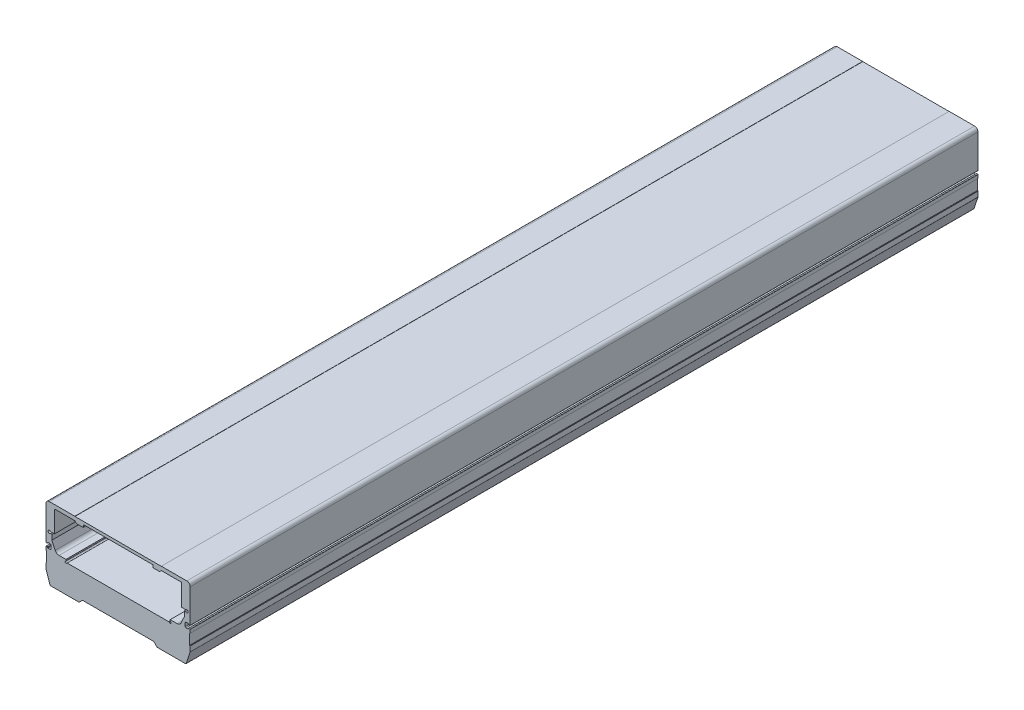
ISO-10303-21;
HEADER;
FILE_DESCRIPTION(('STEP AP214'),'2;1');
FILE_NAME('part.step','',(''),(''),'','','');
FILE_SCHEMA(('AUTOMOTIVE_DESIGN { 1 0 10303 214 1 1 1 1 }'));
ENDSEC;
DATA;
#1=APPLICATION_CONTEXT('core data for automotive mechanical design processes');
#2=APPLICATION_PROTOCOL_DEFINITION('international standard','automotive_design',2000,#1);
#3=PRODUCT_CONTEXT('',#1,'mechanical');
#4=PRODUCT('Part','Part','',(#3));
#5=PRODUCT_RELATED_PRODUCT_CATEGORY('part','',(#4));
#6=PRODUCT_DEFINITION_FORMATION('','',#4);
#7=PRODUCT_DEFINITION_CONTEXT('part definition',#1,'design');
#8=PRODUCT_DEFINITION('design','',#6,#7);
#9=PRODUCT_DEFINITION_SHAPE('','',#8);
#10=(LENGTH_UNIT() NAMED_UNIT(*) SI_UNIT(.MILLI.,.METRE.));
#11=(NAMED_UNIT(*) PLANE_ANGLE_UNIT() SI_UNIT($,.RADIAN.));
#12=(NAMED_UNIT(*) SI_UNIT($,.STERADIAN.) SOLID_ANGLE_UNIT());
#13=UNCERTAINTY_MEASURE_WITH_UNIT(LENGTH_MEASURE(1.E-05),#10,'distance_accuracy_value','');
#14=(GEOMETRIC_REPRESENTATION_CONTEXT(3) GLOBAL_UNCERTAINTY_ASSIGNED_CONTEXT((#13)) GLOBAL_UNIT_ASSIGNED_CONTEXT((#10,
#11,#12)) REPRESENTATION_CONTEXT('',''));
#15=CARTESIAN_POINT('',(0.,0.,0.));
#16=DIRECTION('',(0.,0.,1.));
#17=DIRECTION('',(1.,0.,0.));
#18=AXIS2_PLACEMENT_3D('',#15,#16,#17);
#19=CARTESIAN_POINT('',(80.9999999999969,77.2999999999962,-929.));
#20=DIRECTION('',(0.,0.,1.));
#21=DIRECTION('',(1.,0.,0.));
#22=AXIS2_PLACEMENT_3D('',#19,#20,#21);
#23=CYLINDRICAL_SURFACE('',#22,4.);
#24=CARTESIAN_POINT('',(80.9999999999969,77.2999999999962,0.));
#25=DIRECTION('',(0.,0.,1.));
#26=DIRECTION('',(1.,0.,0.));
#27=AXIS2_PLACEMENT_3D('',#24,#25,#26);
#28=CIRCLE('',#27,4.);
#29=CARTESIAN_POINT('',(84.9999999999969,77.2999999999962,0.));
#30=VERTEX_POINT('',#29);
#31=CARTESIAN_POINT('',(80.9999999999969,81.2999999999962,0.));
#32=VERTEX_POINT('',#31);
#33=EDGE_CURVE('E964',#30,#32,#28,.T.);
#34=ORIENTED_EDGE('',*,*,#33,.F.);
#35=DIRECTION('',(0.,0.,1.));
#36=VECTOR('',#35,1.);
#37=CARTESIAN_POINT('',(84.9999999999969,77.2999999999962,-929.));
#38=LINE('',#37,#36);
#39=CARTESIAN_POINT('',(84.9999999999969,77.2999999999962,-929.));
#40=VERTEX_POINT('',#39);
#41=EDGE_CURVE('E11',#40,#30,#38,.T.);
#42=ORIENTED_EDGE('',*,*,#41,.F.);
#43=CARTESIAN_POINT('',(80.9999999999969,77.2999999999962,-929.));
#44=DIRECTION('',(0.,0.,1.));
#45=DIRECTION('',(1.,0.,0.));
#46=AXIS2_PLACEMENT_3D('',#43,#44,#45);
#47=CIRCLE('',#46,4.);
#48=CARTESIAN_POINT('',(80.9999999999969,81.2999999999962,-929.));
#49=VERTEX_POINT('',#48);
#50=EDGE_CURVE('E1038',#40,#49,#47,.T.);
#51=ORIENTED_EDGE('',*,*,#50,.T.);
#52=DIRECTION('',(0.,0.,1.));
#53=VECTOR('',#52,1.);
#54=CARTESIAN_POINT('',(80.9999999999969,81.2999999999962,-929.));
#55=LINE('',#54,#53);
#56=EDGE_CURVE('E38',#49,#32,#55,.T.);
#57=ORIENTED_EDGE('',*,*,#56,.T.);
#58=EDGE_LOOP('',(#34,#42,#51,#57));
#59=FACE_BOUND('',#58,.T.);
#60=ADVANCED_FACE('F35',(#59),#23,.T.);
#61=CARTESIAN_POINT('',(84.9999999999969,37.8999999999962,-929.));
#62=DIRECTION('',(1.,0.,0.));
#63=DIRECTION('',(0.,0.,-1.));
#64=AXIS2_PLACEMENT_3D('',#61,#62,#63);
#65=PLANE('',#64);
#66=DIRECTION('',(0.,1.,0.));
#67=VECTOR('',#66,1.);
#68=CARTESIAN_POINT('',(84.9999999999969,37.8999999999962,0.));
#69=LINE('',#68,#67);
#70=CARTESIAN_POINT('',(84.9999999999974,37.8999999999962,0.));
#71=VERTEX_POINT('',#70);
#72=EDGE_CURVE('E1042',#71,#30,#69,.T.);
#73=ORIENTED_EDGE('',*,*,#72,.F.);
#74=DIRECTION('',(0.,0.,1.));
#75=VECTOR('',#74,1.);
#76=CARTESIAN_POINT('',(84.9999999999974,37.8999999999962,-929.));
#77=LINE('',#76,#75);
#78=CARTESIAN_POINT('',(84.9999999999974,37.8999999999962,-929.));
#79=VERTEX_POINT('',#78);
#80=EDGE_CURVE('E43',#79,#71,#77,.T.);
#81=ORIENTED_EDGE('',*,*,#80,.F.);
#82=DIRECTION('',(0.,1.,0.));
#83=VECTOR('',#82,1.);
#84=CARTESIAN_POINT('',(84.9999999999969,37.8999999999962,-929.));
#85=LINE('',#84,#83);
#86=EDGE_CURVE('E1216',#79,#40,#85,.T.);
#87=ORIENTED_EDGE('',*,*,#86,.T.);
#88=ORIENTED_EDGE('',*,*,#41,.T.);
#89=EDGE_LOOP('',(#73,#81,#87,#88));
#90=FACE_BOUND('',#89,.T.);
#91=ADVANCED_FACE('F1523',(#90),#65,.T.);
#92=CARTESIAN_POINT('',(84.6999999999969,37.8999999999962,-929.));
#93=DIRECTION('',(0.,0.,1.));
#94=DIRECTION('',(1.,0.,0.));
#95=AXIS2_PLACEMENT_3D('',#92,#93,#94);
#96=CYLINDRICAL_SURFACE('',#95,0.30000000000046);
#97=CARTESIAN_POINT('',(84.6999999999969,37.8999999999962,0.));
#98=DIRECTION('',(0.,0.,1.));
#99=DIRECTION('',(1.,0.,0.));
#100=AXIS2_PLACEMENT_3D('',#97,#98,#99);
#101=CIRCLE('',#100,0.30000000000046);
#102=CARTESIAN_POINT('',(84.7000000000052,37.5999999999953,0.));
#103=VERTEX_POINT('',#102);
#104=EDGE_CURVE('E1392',#103,#71,#101,.T.);
#105=ORIENTED_EDGE('',*,*,#104,.F.);
#106=DIRECTION('',(0.,0.,1.));
#107=VECTOR('',#106,1.);
#108=CARTESIAN_POINT('',(84.7000000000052,37.5999999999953,-929.));
#109=LINE('',#108,#107);
#110=CARTESIAN_POINT('',(84.7000000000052,37.5999999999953,-929.));
#111=VERTEX_POINT('',#110);
#112=EDGE_CURVE('E1398',#111,#103,#109,.T.);
#113=ORIENTED_EDGE('',*,*,#112,.F.);
#114=CARTESIAN_POINT('',(84.6999999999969,37.8999999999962,-929.));
#115=DIRECTION('',(0.,0.,1.));
#116=DIRECTION('',(1.,0.,0.));
#117=AXIS2_PLACEMENT_3D('',#114,#115,#116);
#118=CIRCLE('',#117,0.30000000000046);
#119=EDGE_CURVE('E1213',#111,#79,#118,.T.);
#120=ORIENTED_EDGE('',*,*,#119,.T.);
#121=ORIENTED_EDGE('',*,*,#80,.T.);
#122=EDGE_LOOP('',(#105,#113,#120,#121));
#123=FACE_BOUND('',#122,.T.);
#124=ADVANCED_FACE('F1752',(#123),#96,.T.);
#125=CARTESIAN_POINT('',(83.3000000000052,37.5999999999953,-929.));
#126=DIRECTION('',(0.,-1.,0.));
#127=DIRECTION('',(0.,0.,-1.));
#128=AXIS2_PLACEMENT_3D('',#125,#126,#127);
#129=PLANE('',#128);
#130=DIRECTION('',(1.,0.,0.));
#131=VECTOR('',#130,1.);
#132=CARTESIAN_POINT('',(83.3000000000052,37.5999999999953,0.));
#133=LINE('',#132,#131);
#134=CARTESIAN_POINT('',(83.3000000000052,37.5999999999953,0.));
#135=VERTEX_POINT('',#134);
#136=EDGE_CURVE('E1389',#135,#103,#133,.T.);
#137=ORIENTED_EDGE('',*,*,#136,.F.);
#138=DIRECTION('',(0.,0.,1.));
#139=VECTOR('',#138,1.);
#140=CARTESIAN_POINT('',(83.3000000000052,37.5999999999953,-929.));
#141=LINE('',#140,#139);
#142=CARTESIAN_POINT('',(83.3000000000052,37.5999999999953,-929.));
#143=VERTEX_POINT('',#142);
#144=EDGE_CURVE('E1400',#143,#135,#141,.T.);
#145=ORIENTED_EDGE('',*,*,#144,.F.);
#146=DIRECTION('',(1.,0.,0.));
#147=VECTOR('',#146,1.);
#148=CARTESIAN_POINT('',(83.3000000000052,37.5999999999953,-929.));
#149=LINE('',#148,#147);
#150=EDGE_CURVE('E1210',#143,#111,#149,.T.);
#151=ORIENTED_EDGE('',*,*,#150,.T.);
#152=ORIENTED_EDGE('',*,*,#112,.T.);
#153=EDGE_LOOP('',(#137,#145,#151,#152));
#154=FACE_BOUND('',#153,.T.);
#155=ADVANCED_FACE('F1749',(#154),#129,.T.);
#156=CARTESIAN_POINT('',(83.3000000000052,37.8999999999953,-929.));
#157=DIRECTION('',(0.,0.,1.));
#158=DIRECTION('',(1.,0.,0.));
#159=AXIS2_PLACEMENT_3D('',#156,#157,#158);
#160=CYLINDRICAL_SURFACE('',#159,0.299999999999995);
#161=CARTESIAN_POINT('',(83.3000000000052,37.8999999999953,0.));
#162=DIRECTION('',(0.,0.,1.));
#163=DIRECTION('',(1.,0.,0.));
#164=AXIS2_PLACEMENT_3D('',#161,#162,#163);
#165=CIRCLE('',#164,0.299999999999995);
#166=CARTESIAN_POINT('',(83.0000000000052,37.8999999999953,0.));
#167=VERTEX_POINT('',#166);
#168=EDGE_CURVE('E1386',#167,#135,#165,.T.);
#169=ORIENTED_EDGE('',*,*,#168,.F.);
#170=DIRECTION('',(0.,0.,1.));
#171=VECTOR('',#170,1.);
#172=CARTESIAN_POINT('',(83.0000000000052,37.8999999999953,-929.));
#173=LINE('',#172,#171);
#174=CARTESIAN_POINT('',(83.0000000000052,37.8999999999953,-929.));
#175=VERTEX_POINT('',#174);
#176=EDGE_CURVE('E1402',#175,#167,#173,.T.);
#177=ORIENTED_EDGE('',*,*,#176,.F.);
#178=CARTESIAN_POINT('',(83.3000000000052,37.8999999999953,-929.));
#179=DIRECTION('',(0.,0.,1.));
#180=DIRECTION('',(1.,0.,0.));
#181=AXIS2_PLACEMENT_3D('',#178,#179,#180);
#182=CIRCLE('',#181,0.299999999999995);
#183=EDGE_CURVE('E1207',#175,#143,#182,.T.);
#184=ORIENTED_EDGE('',*,*,#183,.T.);
#185=ORIENTED_EDGE('',*,*,#144,.T.);
#186=EDGE_LOOP('',(#169,#177,#184,#185));
#187=FACE_BOUND('',#186,.T.);
#188=ADVANCED_FACE('F1746',(#187),#160,.T.);
#189=CARTESIAN_POINT('',(83.0000000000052,38.3999999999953,-929.));
#190=DIRECTION('',(-1.,0.,0.));
#191=DIRECTION('',(0.,0.,1.));
#192=AXIS2_PLACEMENT_3D('',#189,#190,#191);
#193=PLANE('',#192);
#194=DIRECTION('',(0.,-1.,0.));
#195=VECTOR('',#194,1.);
#196=CARTESIAN_POINT('',(83.0000000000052,38.3999999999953,0.));
#197=LINE('',#196,#195);
#198=CARTESIAN_POINT('',(83.0000000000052,38.3999999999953,0.));
#199=VERTEX_POINT('',#198);
#200=EDGE_CURVE('E1383',#199,#167,#197,.T.);
#201=ORIENTED_EDGE('',*,*,#200,.F.);
#202=DIRECTION('',(0.,0.,1.));
#203=VECTOR('',#202,1.);
#204=CARTESIAN_POINT('',(83.0000000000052,38.3999999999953,-929.));
#205=LINE('',#204,#203);
#206=CARTESIAN_POINT('',(83.0000000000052,38.3999999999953,-929.));
#207=VERTEX_POINT('',#206);
#208=EDGE_CURVE('E1404',#207,#199,#205,.T.);
#209=ORIENTED_EDGE('',*,*,#208,.F.);
#210=DIRECTION('',(0.,-1.,0.));
#211=VECTOR('',#210,1.);
#212=CARTESIAN_POINT('',(83.0000000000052,38.3999999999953,-929.));
#213=LINE('',#212,#211);
#214=EDGE_CURVE('E1204',#207,#175,#213,.T.);
#215=ORIENTED_EDGE('',*,*,#214,.T.);
#216=ORIENTED_EDGE('',*,*,#176,.T.);
#217=EDGE_LOOP('',(#201,#209,#215,#216));
#218=FACE_BOUND('',#217,.T.);
#219=ADVANCED_FACE('F1742',(#218),#193,.T.);
#220=CARTESIAN_POINT('',(82.7000000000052,38.3999999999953,-929.));
#221=DIRECTION('',(0.,0.,1.));
#222=DIRECTION('',(1.,0.,0.));
#223=AXIS2_PLACEMENT_3D('',#220,#221,#222);
#224=CYLINDRICAL_SURFACE('',#223,0.299999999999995);
#225=CARTESIAN_POINT('',(82.7000000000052,38.3999999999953,0.));
#226=DIRECTION('',(0.,0.,-1.));
#227=DIRECTION('',(1.,0.,0.));
#228=AXIS2_PLACEMENT_3D('',#225,#226,#227);
#229=CIRCLE('',#228,0.299999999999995);
#230=CARTESIAN_POINT('',(82.7000000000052,38.6999999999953,0.));
#231=VERTEX_POINT('',#230);
#232=EDGE_CURVE('E1380',#231,#199,#229,.T.);
#233=ORIENTED_EDGE('',*,*,#232,.F.);
#234=DIRECTION('',(0.,0.,1.));
#235=VECTOR('',#234,1.);
#236=CARTESIAN_POINT('',(82.7000000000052,38.6999999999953,-929.));
#237=LINE('',#236,#235);
#238=CARTESIAN_POINT('',(82.7000000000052,38.6999999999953,-929.));
#239=VERTEX_POINT('',#238);
#240=EDGE_CURVE('E1406',#239,#231,#237,.T.);
#241=ORIENTED_EDGE('',*,*,#240,.F.);
#242=CARTESIAN_POINT('',(82.7000000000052,38.3999999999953,-929.));
#243=DIRECTION('',(0.,0.,-1.));
#244=DIRECTION('',(1.,0.,0.));
#245=AXIS2_PLACEMENT_3D('',#242,#243,#244);
#246=CIRCLE('',#245,0.299999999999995);
#247=EDGE_CURVE('E1201',#239,#207,#246,.T.);
#248=ORIENTED_EDGE('',*,*,#247,.T.);
#249=ORIENTED_EDGE('',*,*,#208,.T.);
#250=EDGE_LOOP('',(#233,#241,#248,#249));
#251=FACE_BOUND('',#250,.T.);
#252=ADVANCED_FACE('F1738',(#251),#224,.F.);
#253=CARTESIAN_POINT('',(80.2000000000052,38.6999999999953,-929.));
#254=DIRECTION('',(0.,-1.,0.));
#255=DIRECTION('',(0.,0.,-1.));
#256=AXIS2_PLACEMENT_3D('',#253,#254,#255);
#257=PLANE('',#256);
#258=DIRECTION('',(1.,0.,0.));
#259=VECTOR('',#258,1.);
#260=CARTESIAN_POINT('',(80.2000000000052,38.6999999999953,0.));
#261=LINE('',#260,#259);
#262=CARTESIAN_POINT('',(80.2000000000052,38.6999999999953,0.));
#263=VERTEX_POINT('',#262);
#264=EDGE_CURVE('E1377',#263,#231,#261,.T.);
#265=ORIENTED_EDGE('',*,*,#264,.F.);
#266=DIRECTION('',(0.,0.,1.));
#267=VECTOR('',#266,1.);
#268=CARTESIAN_POINT('',(80.2000000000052,38.6999999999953,-929.));
#269=LINE('',#268,#267);
#270=CARTESIAN_POINT('',(80.2000000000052,38.6999999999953,-929.));
#271=VERTEX_POINT('',#270);
#272=EDGE_CURVE('E1408',#271,#263,#269,.T.);
#273=ORIENTED_EDGE('',*,*,#272,.F.);
#274=DIRECTION('',(1.,0.,0.));
#275=VECTOR('',#274,1.);
#276=CARTESIAN_POINT('',(80.2000000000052,38.6999999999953,-929.));
#277=LINE('',#276,#275);
#278=EDGE_CURVE('E1198',#271,#239,#277,.T.);
#279=ORIENTED_EDGE('',*,*,#278,.T.);
#280=ORIENTED_EDGE('',*,*,#240,.T.);
#281=EDGE_LOOP('',(#265,#273,#279,#280));
#282=FACE_BOUND('',#281,.T.);
#283=ADVANCED_FACE('F1734',(#282),#257,.T.);
#284=CARTESIAN_POINT('',(80.2000000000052,37.6999999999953,-929.));
#285=DIRECTION('',(0.,0.,1.));
#286=DIRECTION('',(1.,0.,0.));
#287=AXIS2_PLACEMENT_3D('',#284,#285,#286);
#288=CYLINDRICAL_SURFACE('',#287,1.);
#289=CARTESIAN_POINT('',(80.2000000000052,37.6999999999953,0.));
#290=DIRECTION('',(0.,0.,-1.));
#291=DIRECTION('',(1.,0.,0.));
#292=AXIS2_PLACEMENT_3D('',#289,#290,#291);
#293=CIRCLE('',#292,1.);
#294=CARTESIAN_POINT('',(79.2000000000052,37.6999999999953,0.));
#295=VERTEX_POINT('',#294);
#296=EDGE_CURVE('E1374',#295,#263,#293,.T.);
#297=ORIENTED_EDGE('',*,*,#296,.F.);
#298=DIRECTION('',(0.,0.,1.));
#299=VECTOR('',#298,1.);
#300=CARTESIAN_POINT('',(79.2000000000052,37.6999999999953,-929.));
#301=LINE('',#300,#299);
#302=CARTESIAN_POINT('',(79.2000000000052,37.6999999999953,-929.));
#303=VERTEX_POINT('',#302);
#304=EDGE_CURVE('E1410',#303,#295,#301,.T.);
#305=ORIENTED_EDGE('',*,*,#304,.F.);
#306=CARTESIAN_POINT('',(80.2000000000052,37.6999999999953,-929.));
#307=DIRECTION('',(0.,0.,-1.));
#308=DIRECTION('',(1.,0.,0.));
#309=AXIS2_PLACEMENT_3D('',#306,#307,#308);
#310=CIRCLE('',#309,1.);
#311=EDGE_CURVE('E1195',#303,#271,#310,.T.);
#312=ORIENTED_EDGE('',*,*,#311,.T.);
#313=ORIENTED_EDGE('',*,*,#272,.T.);
#314=EDGE_LOOP('',(#297,#305,#312,#313));
#315=FACE_BOUND('',#314,.T.);
#316=ADVANCED_FACE('F1730',(#315),#288,.F.);
#317=CARTESIAN_POINT('',(79.2000000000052,33.8999999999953,-929.));
#318=DIRECTION('',(1.,0.,0.));
#319=DIRECTION('',(0.,0.,-1.));
#320=AXIS2_PLACEMENT_3D('',#317,#318,#319);
#321=PLANE('',#320);
#322=DIRECTION('',(0.,1.,0.));
#323=VECTOR('',#322,1.);
#324=CARTESIAN_POINT('',(79.2000000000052,33.8999999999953,0.));
#325=LINE('',#324,#323);
#326=CARTESIAN_POINT('',(79.2000000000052,33.8999999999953,0.));
#327=VERTEX_POINT('',#326);
#328=EDGE_CURVE('E1371',#327,#295,#325,.T.);
#329=ORIENTED_EDGE('',*,*,#328,.F.);
#330=DIRECTION('',(0.,0.,1.));
#331=VECTOR('',#330,1.);
#332=CARTESIAN_POINT('',(79.2000000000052,33.8999999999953,-929.));
#333=LINE('',#332,#331);
#334=CARTESIAN_POINT('',(79.2000000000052,33.8999999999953,-929.));
#335=VERTEX_POINT('',#334);
#336=EDGE_CURVE('E1412',#335,#327,#333,.T.);
#337=ORIENTED_EDGE('',*,*,#336,.F.);
#338=DIRECTION('',(0.,1.,0.));
#339=VECTOR('',#338,1.);
#340=CARTESIAN_POINT('',(79.2000000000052,33.8999999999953,-929.));
#341=LINE('',#340,#339);
#342=EDGE_CURVE('E1192',#335,#303,#341,.T.);
#343=ORIENTED_EDGE('',*,*,#342,.T.);
#344=ORIENTED_EDGE('',*,*,#304,.T.);
#345=EDGE_LOOP('',(#329,#337,#343,#344));
#346=FACE_BOUND('',#345,.T.);
#347=ADVANCED_FACE('F1726',(#346),#321,.T.);
#348=CARTESIAN_POINT('',(80.2000000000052,33.8999999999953,-929.));
#349=DIRECTION('',(0.,0.,1.));
#350=DIRECTION('',(1.,0.,0.));
#351=AXIS2_PLACEMENT_3D('',#348,#349,#350);
#352=CYLINDRICAL_SURFACE('',#351,0.999999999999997);
#353=CARTESIAN_POINT('',(80.2000000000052,33.8999999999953,0.));
#354=DIRECTION('',(0.,0.,-1.));
#355=DIRECTION('',(1.,0.,0.));
#356=AXIS2_PLACEMENT_3D('',#353,#354,#355);
#357=CIRCLE('',#356,0.999999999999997);
#358=CARTESIAN_POINT('',(80.2000000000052,32.8999999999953,0.));
#359=VERTEX_POINT('',#358);
#360=EDGE_CURVE('E1368',#359,#327,#357,.T.);
#361=ORIENTED_EDGE('',*,*,#360,.F.);
#362=DIRECTION('',(0.,0.,1.));
#363=VECTOR('',#362,1.);
#364=CARTESIAN_POINT('',(80.2000000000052,32.8999999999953,-929.));
#365=LINE('',#364,#363);
#366=CARTESIAN_POINT('',(80.2000000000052,32.8999999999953,-929.));
#367=VERTEX_POINT('',#366);
#368=EDGE_CURVE('E1414',#367,#359,#365,.T.);
#369=ORIENTED_EDGE('',*,*,#368,.F.);
#370=CARTESIAN_POINT('',(80.2000000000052,33.8999999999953,-929.));
#371=DIRECTION('',(0.,0.,-1.));
#372=DIRECTION('',(1.,0.,0.));
#373=AXIS2_PLACEMENT_3D('',#370,#371,#372);
#374=CIRCLE('',#373,0.999999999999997);
#375=EDGE_CURVE('E1189',#367,#335,#374,.T.);
#376=ORIENTED_EDGE('',*,*,#375,.T.);
#377=ORIENTED_EDGE('',*,*,#336,.T.);
#378=EDGE_LOOP('',(#361,#369,#376,#377));
#379=FACE_BOUND('',#378,.T.);
#380=ADVANCED_FACE('F1722',(#379),#352,.F.);
#381=CARTESIAN_POINT('',(82.7000000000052,32.8999999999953,-929.));
#382=DIRECTION('',(0.,1.,0.));
#383=DIRECTION('',(0.,0.,1.));
#384=AXIS2_PLACEMENT_3D('',#381,#382,#383);
#385=PLANE('',#384);
#386=DIRECTION('',(-1.,0.,0.));
#387=VECTOR('',#386,1.);
#388=CARTESIAN_POINT('',(82.7000000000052,32.8999999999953,0.));
#389=LINE('',#388,#387);
#390=CARTESIAN_POINT('',(82.7000000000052,32.8999999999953,0.));
#391=VERTEX_POINT('',#390);
#392=EDGE_CURVE('E1365',#391,#359,#389,.T.);
#393=ORIENTED_EDGE('',*,*,#392,.F.);
#394=DIRECTION('',(0.,0.,1.));
#395=VECTOR('',#394,1.);
#396=CARTESIAN_POINT('',(82.7000000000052,32.8999999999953,-929.));
#397=LINE('',#396,#395);
#398=CARTESIAN_POINT('',(82.7000000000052,32.8999999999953,-929.));
#399=VERTEX_POINT('',#398);
#400=EDGE_CURVE('E1416',#399,#391,#397,.T.);
#401=ORIENTED_EDGE('',*,*,#400,.F.);
#402=DIRECTION('',(-1.,0.,0.));
#403=VECTOR('',#402,1.);
#404=CARTESIAN_POINT('',(82.7000000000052,32.8999999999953,-929.));
#405=LINE('',#404,#403);
#406=EDGE_CURVE('E1186',#399,#367,#405,.T.);
#407=ORIENTED_EDGE('',*,*,#406,.T.);
#408=ORIENTED_EDGE('',*,*,#368,.T.);
#409=EDGE_LOOP('',(#393,#401,#407,#408));
#410=FACE_BOUND('',#409,.T.);
#411=ADVANCED_FACE('F1718',(#410),#385,.T.);
#412=CARTESIAN_POINT('',(82.7000000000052,33.1999999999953,-929.));
#413=DIRECTION('',(0.,0.,1.));
#414=DIRECTION('',(1.,0.,0.));
#415=AXIS2_PLACEMENT_3D('',#412,#413,#414);
#416=CYLINDRICAL_SURFACE('',#415,0.299999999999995);
#417=CARTESIAN_POINT('',(82.7000000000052,33.1999999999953,0.));
#418=DIRECTION('',(0.,0.,-1.));
#419=DIRECTION('',(1.,0.,0.));
#420=AXIS2_PLACEMENT_3D('',#417,#418,#419);
#421=CIRCLE('',#420,0.299999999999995);
#422=CARTESIAN_POINT('',(83.0000000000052,33.1999999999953,0.));
#423=VERTEX_POINT('',#422);
#424=EDGE_CURVE('E1362',#423,#391,#421,.T.);
#425=ORIENTED_EDGE('',*,*,#424,.F.);
#426=DIRECTION('',(0.,0.,1.));
#427=VECTOR('',#426,1.);
#428=CARTESIAN_POINT('',(83.0000000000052,33.1999999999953,-929.));
#429=LINE('',#428,#427);
#430=CARTESIAN_POINT('',(83.0000000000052,33.1999999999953,-929.));
#431=VERTEX_POINT('',#430);
#432=EDGE_CURVE('E1418',#431,#423,#429,.T.);
#433=ORIENTED_EDGE('',*,*,#432,.F.);
#434=CARTESIAN_POINT('',(82.7000000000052,33.1999999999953,-929.));
#435=DIRECTION('',(0.,0.,-1.));
#436=DIRECTION('',(1.,0.,0.));
#437=AXIS2_PLACEMENT_3D('',#434,#435,#436);
#438=CIRCLE('',#437,0.299999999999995);
#439=EDGE_CURVE('E1183',#431,#399,#438,.T.);
#440=ORIENTED_EDGE('',*,*,#439,.T.);
#441=ORIENTED_EDGE('',*,*,#400,.T.);
#442=EDGE_LOOP('',(#425,#433,#440,#441));
#443=FACE_BOUND('',#442,.T.);
#444=ADVANCED_FACE('F1714',(#443),#416,.F.);
#445=CARTESIAN_POINT('',(83.0000000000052,33.6999999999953,-929.));
#446=DIRECTION('',(-1.,0.,0.));
#447=DIRECTION('',(0.,0.,1.));
#448=AXIS2_PLACEMENT_3D('',#445,#446,#447);
#449=PLANE('',#448);
#450=DIRECTION('',(0.,-1.,0.));
#451=VECTOR('',#450,1.);
#452=CARTESIAN_POINT('',(83.0000000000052,33.6999999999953,0.));
#453=LINE('',#452,#451);
#454=CARTESIAN_POINT('',(83.0000000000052,33.6999999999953,0.));
#455=VERTEX_POINT('',#454);
#456=EDGE_CURVE('E1359',#455,#423,#453,.T.);
#457=ORIENTED_EDGE('',*,*,#456,.F.);
#458=DIRECTION('',(0.,0.,1.));
#459=VECTOR('',#458,1.);
#460=CARTESIAN_POINT('',(83.0000000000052,33.6999999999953,-929.));
#461=LINE('',#460,#459);
#462=CARTESIAN_POINT('',(83.0000000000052,33.6999999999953,-929.));
#463=VERTEX_POINT('',#462);
#464=EDGE_CURVE('E1420',#463,#455,#461,.T.);
#465=ORIENTED_EDGE('',*,*,#464,.F.);
#466=DIRECTION('',(0.,-1.,0.));
#467=VECTOR('',#466,1.);
#468=CARTESIAN_POINT('',(83.0000000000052,33.6999999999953,-929.));
#469=LINE('',#468,#467);
#470=EDGE_CURVE('E1180',#463,#431,#469,.T.);
#471=ORIENTED_EDGE('',*,*,#470,.T.);
#472=ORIENTED_EDGE('',*,*,#432,.T.);
#473=EDGE_LOOP('',(#457,#465,#471,#472));
#474=FACE_BOUND('',#473,.T.);
#475=ADVANCED_FACE('F1710',(#474),#449,.T.);
#476=CARTESIAN_POINT('',(83.3000000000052,33.6999999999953,-929.));
#477=DIRECTION('',(0.,0.,1.));
#478=DIRECTION('',(1.,0.,0.));
#479=AXIS2_PLACEMENT_3D('',#476,#477,#478);
#480=CYLINDRICAL_SURFACE('',#479,0.299999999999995);
#481=CARTESIAN_POINT('',(83.3000000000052,33.6999999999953,0.));
#482=DIRECTION('',(0.,0.,1.));
#483=DIRECTION('',(1.,0.,0.));
#484=AXIS2_PLACEMENT_3D('',#481,#482,#483);
#485=CIRCLE('',#484,0.299999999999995);
#486=CARTESIAN_POINT('',(83.3000000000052,33.9999999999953,0.));
#487=VERTEX_POINT('',#486);
#488=EDGE_CURVE('E1356',#487,#455,#485,.T.);
#489=ORIENTED_EDGE('',*,*,#488,.F.);
#490=DIRECTION('',(0.,0.,1.));
#491=VECTOR('',#490,1.);
#492=CARTESIAN_POINT('',(83.3000000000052,33.9999999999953,-929.));
#493=LINE('',#492,#491);
#494=CARTESIAN_POINT('',(83.3000000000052,33.9999999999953,-929.));
#495=VERTEX_POINT('',#494);
#496=EDGE_CURVE('E1422',#495,#487,#493,.T.);
#497=ORIENTED_EDGE('',*,*,#496,.F.);
#498=CARTESIAN_POINT('',(83.3000000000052,33.6999999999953,-929.));
#499=DIRECTION('',(0.,0.,1.));
#500=DIRECTION('',(1.,0.,0.));
#501=AXIS2_PLACEMENT_3D('',#498,#499,#500);
#502=CIRCLE('',#501,0.299999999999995);
#503=EDGE_CURVE('E1177',#495,#463,#502,.T.);
#504=ORIENTED_EDGE('',*,*,#503,.T.);
#505=ORIENTED_EDGE('',*,*,#464,.T.);
#506=EDGE_LOOP('',(#489,#497,#504,#505));
#507=FACE_BOUND('',#506,.T.);
#508=ADVANCED_FACE('F1706',(#507),#480,.T.);
#509=CARTESIAN_POINT('',(84.7000000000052,33.9999999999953,-929.));
#510=DIRECTION('',(0.,1.,0.));
#511=DIRECTION('',(0.,0.,1.));
#512=AXIS2_PLACEMENT_3D('',#509,#510,#511);
#513=PLANE('',#512);
#514=DIRECTION('',(-1.,0.,0.));
#515=VECTOR('',#514,1.);
#516=CARTESIAN_POINT('',(84.7000000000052,33.9999999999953,0.));
#517=LINE('',#516,#515);
#518=CARTESIAN_POINT('',(84.7000000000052,33.9999999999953,0.));
#519=VERTEX_POINT('',#518);
#520=EDGE_CURVE('E1353',#519,#487,#517,.T.);
#521=ORIENTED_EDGE('',*,*,#520,.F.);
#522=DIRECTION('',(0.,0.,1.));
#523=VECTOR('',#522,1.);
#524=CARTESIAN_POINT('',(84.7000000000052,33.9999999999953,-929.));
#525=LINE('',#524,#523);
#526=CARTESIAN_POINT('',(84.7000000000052,33.9999999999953,-929.));
#527=VERTEX_POINT('',#526);
#528=EDGE_CURVE('E1424',#527,#519,#525,.T.);
#529=ORIENTED_EDGE('',*,*,#528,.F.);
#530=DIRECTION('',(-1.,0.,0.));
#531=VECTOR('',#530,1.);
#532=CARTESIAN_POINT('',(84.7000000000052,33.9999999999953,-929.));
#533=LINE('',#532,#531);
#534=EDGE_CURVE('E1174',#527,#495,#533,.T.);
#535=ORIENTED_EDGE('',*,*,#534,.T.);
#536=ORIENTED_EDGE('',*,*,#496,.T.);
#537=EDGE_LOOP('',(#521,#529,#535,#536));
#538=FACE_BOUND('',#537,.T.);
#539=ADVANCED_FACE('F1702',(#538),#513,.T.);
#540=CARTESIAN_POINT('',(84.7000000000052,33.6999999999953,-929.));
#541=DIRECTION('',(0.,0.,1.));
#542=DIRECTION('',(1.,0.,0.));
#543=AXIS2_PLACEMENT_3D('',#540,#541,#542);
#544=CYLINDRICAL_SURFACE('',#543,0.299999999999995);
#545=CARTESIAN_POINT('',(84.7000000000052,33.6999999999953,0.));
#546=DIRECTION('',(0.,0.,1.));
#547=DIRECTION('',(1.,0.,0.));
#548=AXIS2_PLACEMENT_3D('',#545,#546,#547);
#549=CIRCLE('',#548,0.299999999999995);
#550=CARTESIAN_POINT('',(85.0000000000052,33.6999999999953,0.));
#551=VERTEX_POINT('',#550);
#552=EDGE_CURVE('E1350',#551,#519,#549,.T.);
#553=ORIENTED_EDGE('',*,*,#552,.F.);
#554=DIRECTION('',(0.,0.,1.));
#555=VECTOR('',#554,1.);
#556=CARTESIAN_POINT('',(85.0000000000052,33.6999999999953,-929.));
#557=LINE('',#556,#555);
#558=CARTESIAN_POINT('',(85.0000000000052,33.6999999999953,-929.));
#559=VERTEX_POINT('',#558);
#560=EDGE_CURVE('E1426',#559,#551,#557,.T.);
#561=ORIENTED_EDGE('',*,*,#560,.F.);
#562=CARTESIAN_POINT('',(84.7000000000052,33.6999999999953,-929.));
#563=DIRECTION('',(0.,0.,1.));
#564=DIRECTION('',(1.,0.,0.));
#565=AXIS2_PLACEMENT_3D('',#562,#563,#564);
#566=CIRCLE('',#565,0.299999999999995);
#567=EDGE_CURVE('E1171',#559,#527,#566,.T.);
#568=ORIENTED_EDGE('',*,*,#567,.T.);
#569=ORIENTED_EDGE('',*,*,#528,.T.);
#570=EDGE_LOOP('',(#553,#561,#568,#569));
#571=FACE_BOUND('',#570,.T.);
#572=ADVANCED_FACE('F1698',(#571),#544,.T.);
#573=CARTESIAN_POINT('',(85.0000000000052,29.7999999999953,-929.));
#574=DIRECTION('',(1.,0.,0.));
#575=DIRECTION('',(0.,0.,-1.));
#576=AXIS2_PLACEMENT_3D('',#573,#574,#575);
#577=PLANE('',#576);
#578=DIRECTION('',(0.,1.,0.));
#579=VECTOR('',#578,1.);
#580=CARTESIAN_POINT('',(85.0000000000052,29.7999999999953,0.));
#581=LINE('',#580,#579);
#582=CARTESIAN_POINT('',(85.0000000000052,29.7999999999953,0.));
#583=VERTEX_POINT('',#582);
#584=EDGE_CURVE('E1347',#583,#551,#581,.T.);
#585=ORIENTED_EDGE('',*,*,#584,.F.);
#586=DIRECTION('',(0.,0.,1.));
#587=VECTOR('',#586,1.);
#588=CARTESIAN_POINT('',(85.0000000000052,29.7999999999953,-929.));
#589=LINE('',#588,#587);
#590=CARTESIAN_POINT('',(85.0000000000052,29.7999999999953,-929.));
#591=VERTEX_POINT('',#590);
#592=EDGE_CURVE('E1428',#591,#583,#589,.T.);
#593=ORIENTED_EDGE('',*,*,#592,.F.);
#594=DIRECTION('',(0.,1.,0.));
#595=VECTOR('',#594,1.);
#596=CARTESIAN_POINT('',(85.0000000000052,29.7999999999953,-929.));
#597=LINE('',#596,#595);
#598=EDGE_CURVE('E1168',#591,#559,#597,.T.);
#599=ORIENTED_EDGE('',*,*,#598,.T.);
#600=ORIENTED_EDGE('',*,*,#560,.T.);
#601=EDGE_LOOP('',(#585,#593,#599,#600));
#602=FACE_BOUND('',#601,.T.);
#603=ADVANCED_FACE('F1694',(#602),#577,.T.);
#604=CARTESIAN_POINT('',(84.5000000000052,29.2999999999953,-929.));
#605=DIRECTION('',(0.707106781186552,-0.707106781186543,0.));
#606=DIRECTION('',(0.707106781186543,0.707106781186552,0.));
#607=AXIS2_PLACEMENT_3D('',#604,#605,#606);
#608=PLANE('',#607);
#609=DIRECTION('',(0.707106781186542,0.707106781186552,0.));
#610=VECTOR('',#609,1.);
#611=CARTESIAN_POINT('',(84.5000000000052,29.2999999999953,0.));
#612=LINE('',#611,#610);
#613=CARTESIAN_POINT('',(84.5000000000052,29.2999999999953,0.));
#614=VERTEX_POINT('',#613);
#615=EDGE_CURVE('E1344',#614,#583,#612,.T.);
#616=ORIENTED_EDGE('',*,*,#615,.F.);
#617=DIRECTION('',(0.,0.,1.));
#618=VECTOR('',#617,1.);
#619=CARTESIAN_POINT('',(84.5000000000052,29.2999999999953,-929.));
#620=LINE('',#619,#618);
#621=CARTESIAN_POINT('',(84.5000000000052,29.2999999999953,-929.));
#622=VERTEX_POINT('',#621);
#623=EDGE_CURVE('E1430',#622,#614,#620,.T.);
#624=ORIENTED_EDGE('',*,*,#623,.F.);
#625=DIRECTION('',(0.707106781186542,0.707106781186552,0.));
#626=VECTOR('',#625,1.);
#627=CARTESIAN_POINT('',(84.5000000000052,29.2999999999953,-929.));
#628=LINE('',#627,#626);
#629=EDGE_CURVE('E1165',#622,#591,#628,.T.);
#630=ORIENTED_EDGE('',*,*,#629,.T.);
#631=ORIENTED_EDGE('',*,*,#592,.T.);
#632=EDGE_LOOP('',(#616,#624,#630,#631));
#633=FACE_BOUND('',#632,.T.);
#634=ADVANCED_FACE('F1690',(#633),#608,.T.);
#635=CARTESIAN_POINT('',(84.5000000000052,17.2999999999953,-929.));
#636=DIRECTION('',(1.,0.,0.));
#637=DIRECTION('',(0.,0.,-1.));
#638=AXIS2_PLACEMENT_3D('',#635,#636,#637);
#639=PLANE('',#638);
#640=DIRECTION('',(0.,1.,0.));
#641=VECTOR('',#640,1.);
#642=CARTESIAN_POINT('',(84.5000000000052,17.2999999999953,0.));
#643=LINE('',#642,#641);
#644=CARTESIAN_POINT('',(84.5000000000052,17.2999999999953,0.));
#645=VERTEX_POINT('',#644);
#646=EDGE_CURVE('E1341',#645,#614,#643,.T.);
#647=ORIENTED_EDGE('',*,*,#646,.F.);
#648=DIRECTION('',(0.,0.,1.));
#649=VECTOR('',#648,1.);
#650=CARTESIAN_POINT('',(84.5000000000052,17.2999999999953,-929.));
#651=LINE('',#650,#649);
#652=CARTESIAN_POINT('',(84.5000000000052,17.2999999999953,-929.));
#653=VERTEX_POINT('',#652);
#654=EDGE_CURVE('E1432',#653,#645,#651,.T.);
#655=ORIENTED_EDGE('',*,*,#654,.F.);
#656=DIRECTION('',(0.,1.,0.));
#657=VECTOR('',#656,1.);
#658=CARTESIAN_POINT('',(84.5000000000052,17.2999999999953,-929.));
#659=LINE('',#658,#657);
#660=EDGE_CURVE('E1162',#653,#622,#659,.T.);
#661=ORIENTED_EDGE('',*,*,#660,.T.);
#662=ORIENTED_EDGE('',*,*,#623,.T.);
#663=EDGE_LOOP('',(#647,#655,#661,#662));
#664=FACE_BOUND('',#663,.T.);
#665=ADVANCED_FACE('F1686',(#664),#639,.T.);
#666=CARTESIAN_POINT('',(85.0000000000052,16.7999999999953,-929.));
#667=DIRECTION('',(0.707106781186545,0.70710678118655,0.));
#668=DIRECTION('',(-0.70710678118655,0.707106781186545,0.));
#669=AXIS2_PLACEMENT_3D('',#666,#667,#668);
#670=PLANE('',#669);
#671=DIRECTION('',(-0.70710678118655,0.707106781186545,0.));
#672=VECTOR('',#671,1.);
#673=CARTESIAN_POINT('',(85.0000000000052,16.7999999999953,0.));
#674=LINE('',#673,#672);
#675=CARTESIAN_POINT('',(85.0000000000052,16.7999999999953,0.));
#676=VERTEX_POINT('',#675);
#677=EDGE_CURVE('E1338',#676,#645,#674,.T.);
#678=ORIENTED_EDGE('',*,*,#677,.F.);
#679=DIRECTION('',(0.,0.,1.));
#680=VECTOR('',#679,1.);
#681=CARTESIAN_POINT('',(85.0000000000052,16.7999999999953,-929.));
#682=LINE('',#681,#680);
#683=CARTESIAN_POINT('',(85.0000000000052,16.7999999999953,-929.));
#684=VERTEX_POINT('',#683);
#685=EDGE_CURVE('E1434',#684,#676,#682,.T.);
#686=ORIENTED_EDGE('',*,*,#685,.F.);
#687=DIRECTION('',(-0.70710678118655,0.707106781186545,0.));
#688=VECTOR('',#687,1.);
#689=CARTESIAN_POINT('',(85.0000000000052,16.7999999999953,-929.));
#690=LINE('',#689,#688);
#691=EDGE_CURVE('E1159',#684,#653,#690,.T.);
#692=ORIENTED_EDGE('',*,*,#691,.T.);
#693=ORIENTED_EDGE('',*,*,#654,.T.);
#694=EDGE_LOOP('',(#678,#686,#692,#693));
#695=FACE_BOUND('',#694,.T.);
#696=ADVANCED_FACE('F1682',(#695),#670,.T.);
#697=CARTESIAN_POINT('',(85.0000000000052,10.8622776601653,-929.));
#698=DIRECTION('',(1.,0.,0.));
#699=DIRECTION('',(0.,0.,-1.));
#700=AXIS2_PLACEMENT_3D('',#697,#698,#699);
#701=PLANE('',#700);
#702=DIRECTION('',(0.,1.,0.));
#703=VECTOR('',#702,1.);
#704=CARTESIAN_POINT('',(85.0000000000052,10.8622776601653,0.));
#705=LINE('',#704,#703);
#706=CARTESIAN_POINT('',(85.0000000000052,10.8622776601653,0.));
#707=VERTEX_POINT('',#706);
#708=EDGE_CURVE('E1335',#707,#676,#705,.T.);
#709=ORIENTED_EDGE('',*,*,#708,.F.);
#710=DIRECTION('',(0.,0.,1.));
#711=VECTOR('',#710,1.);
#712=CARTESIAN_POINT('',(85.0000000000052,10.8622776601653,-929.));
#713=LINE('',#712,#711);
#714=CARTESIAN_POINT('',(85.0000000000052,10.8622776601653,-929.));
#715=VERTEX_POINT('',#714);
#716=EDGE_CURVE('E1436',#715,#707,#713,.T.);
#717=ORIENTED_EDGE('',*,*,#716,.F.);
#718=DIRECTION('',(0.,1.,0.));
#719=VECTOR('',#718,1.);
#720=CARTESIAN_POINT('',(85.0000000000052,10.8622776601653,-929.));
#721=LINE('',#720,#719);
#722=EDGE_CURVE('E1156',#715,#684,#721,.T.);
#723=ORIENTED_EDGE('',*,*,#722,.T.);
#724=ORIENTED_EDGE('',*,*,#685,.T.);
#725=EDGE_LOOP('',(#709,#717,#723,#724));
#726=FACE_BOUND('',#725,.T.);
#727=ADVANCED_FACE('F1678',(#726),#701,.T.);
#728=CARTESIAN_POINT('',(84.0000000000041,10.8622776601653,-929.));
#729=DIRECTION('',(0.,0.,1.));
#730=DIRECTION('',(1.,0.,0.));
#731=AXIS2_PLACEMENT_3D('',#728,#729,#730);
#732=CYLINDRICAL_SURFACE('',#731,1.00000000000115);
#733=CARTESIAN_POINT('',(84.0000000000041,10.8622776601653,0.));
#734=DIRECTION('',(0.,0.,1.));
#735=DIRECTION('',(1.,0.,0.));
#736=AXIS2_PLACEMENT_3D('',#733,#734,#735);
#737=CIRCLE('',#736,1.00000000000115);
#738=CARTESIAN_POINT('',(84.9486832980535,10.5460498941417,0.));
#739=VERTEX_POINT('',#738);
#740=EDGE_CURVE('E1332',#739,#707,#737,.T.);
#741=ORIENTED_EDGE('',*,*,#740,.F.);
#742=DIRECTION('',(0.,0.,1.));
#743=VECTOR('',#742,1.);
#744=CARTESIAN_POINT('',(84.9486832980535,10.5460498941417,-929.));
#745=LINE('',#744,#743);
#746=CARTESIAN_POINT('',(84.9486832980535,10.5460498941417,-929.));
#747=VERTEX_POINT('',#746);
#748=EDGE_CURVE('E1438',#747,#739,#745,.T.);
#749=ORIENTED_EDGE('',*,*,#748,.F.);
#750=CARTESIAN_POINT('',(84.0000000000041,10.8622776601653,-929.));
#751=DIRECTION('',(0.,0.,1.));
#752=DIRECTION('',(1.,0.,0.));
#753=AXIS2_PLACEMENT_3D('',#750,#751,#752);
#754=CIRCLE('',#753,1.00000000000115);
#755=EDGE_CURVE('E1153',#747,#715,#754,.T.);
#756=ORIENTED_EDGE('',*,*,#755,.T.);
#757=ORIENTED_EDGE('',*,*,#716,.T.);
#758=EDGE_LOOP('',(#741,#749,#756,#757));
#759=FACE_BOUND('',#758,.T.);
#760=ADVANCED_FACE('F1674',(#759),#732,.T.);
#761=CARTESIAN_POINT('',(80.3279240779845,-3.31622776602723,-929.));
#762=DIRECTION('',(0.948683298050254,-0.316227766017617,0.));
#763=DIRECTION('',(0.316227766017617,0.948683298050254,0.));
#764=AXIS2_PLACEMENT_3D('',#761,#762,#763);
#765=PLANE('',#764);
#766=DIRECTION('',(0.316227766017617,0.948683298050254,0.));
#767=VECTOR('',#766,1.);
#768=CARTESIAN_POINT('',(80.3279240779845,-3.31622776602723,0.));
#769=LINE('',#768,#767);
#770=CARTESIAN_POINT('',(80.3279240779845,-3.31622776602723,0.));
#771=VERTEX_POINT('',#770);
#772=EDGE_CURVE('E1329',#771,#739,#769,.T.);
#773=ORIENTED_EDGE('',*,*,#772,.F.);
#774=DIRECTION('',(0.,0.,1.));
#775=VECTOR('',#774,1.);
#776=CARTESIAN_POINT('',(80.3279240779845,-3.31622776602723,-929.));
#777=LINE('',#776,#775);
#778=CARTESIAN_POINT('',(80.3279240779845,-3.31622776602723,-929.));
#779=VERTEX_POINT('',#778);
#780=EDGE_CURVE('E1440',#779,#771,#777,.T.);
#781=ORIENTED_EDGE('',*,*,#780,.F.);
#782=DIRECTION('',(0.316227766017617,0.948683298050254,0.));
#783=VECTOR('',#782,1.);
#784=CARTESIAN_POINT('',(80.3279240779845,-3.31622776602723,-929.));
#785=LINE('',#784,#783);
#786=EDGE_CURVE('E1150',#779,#747,#785,.T.);
#787=ORIENTED_EDGE('',*,*,#786,.T.);
#788=ORIENTED_EDGE('',*,*,#748,.T.);
#789=EDGE_LOOP('',(#773,#781,#787,#788));
#790=FACE_BOUND('',#789,.T.);
#791=ADVANCED_FACE('F1670',(#790),#765,.T.);
#792=CARTESIAN_POINT('',(79.3792407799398,-3.00000000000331,-929.));
#793=DIRECTION('',(0.,0.,1.));
#794=DIRECTION('',(1.,0.,0.));
#795=AXIS2_PLACEMENT_3D('',#792,#793,#794);
#796=CYLINDRICAL_SURFACE('',#795,0.999999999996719);
#797=CARTESIAN_POINT('',(79.3792407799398,-3.00000000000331,0.));
#798=DIRECTION('',(0.,0.,1.));
#799=DIRECTION('',(1.,0.,0.));
#800=AXIS2_PLACEMENT_3D('',#797,#798,#799);
#801=CIRCLE('',#800,0.999999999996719);
#802=CARTESIAN_POINT('',(79.3792407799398,-4.00000000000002,0.));
#803=VERTEX_POINT('',#802);
#804=EDGE_CURVE('E1326',#803,#771,#801,.T.);
#805=ORIENTED_EDGE('',*,*,#804,.F.);
#806=DIRECTION('',(0.,0.,1.));
#807=VECTOR('',#806,1.);
#808=CARTESIAN_POINT('',(79.3792407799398,-4.00000000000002,-929.));
#809=LINE('',#808,#807);
#810=CARTESIAN_POINT('',(79.3792407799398,-4.00000000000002,-929.));
#811=VERTEX_POINT('',#810);
#812=EDGE_CURVE('E1442',#811,#803,#809,.T.);
#813=ORIENTED_EDGE('',*,*,#812,.F.);
#814=CARTESIAN_POINT('',(79.3792407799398,-3.00000000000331,-929.));
#815=DIRECTION('',(0.,0.,1.));
#816=DIRECTION('',(1.,0.,0.));
#817=AXIS2_PLACEMENT_3D('',#814,#815,#816);
#818=CIRCLE('',#817,0.999999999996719);
#819=EDGE_CURVE('E1147',#811,#779,#818,.T.);
#820=ORIENTED_EDGE('',*,*,#819,.T.);
#821=ORIENTED_EDGE('',*,*,#780,.T.);
#822=EDGE_LOOP('',(#805,#813,#820,#821));
#823=FACE_BOUND('',#822,.T.);
#824=ADVANCED_FACE('F1666',(#823),#796,.T.);
#825=CARTESIAN_POINT('',(46.,-4.00000000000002,-929.));
#826=DIRECTION('',(0.,-1.,0.));
#827=DIRECTION('',(0.,0.,-1.));
#828=AXIS2_PLACEMENT_3D('',#825,#826,#827);
#829=PLANE('',#828);
#830=CARTESIAN_POINT('',(70.,-3.99999999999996,-870.5));
#831=DIRECTION('',(0.,-1.,0.));
#832=DIRECTION('',(0.,0.,-1.));
#833=AXIS2_PLACEMENT_3D('',#830,#831,#832);
#834=CIRCLE('',#833,3.4);
#835=CARTESIAN_POINT('',(70.,-3.99999999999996,-873.9));
#836=VERTEX_POINT('',#835);
#837=EDGE_CURVE('E678',#836,#836,#834,.T.);
#838=ORIENTED_EDGE('',*,*,#837,.F.);
#839=EDGE_LOOP('',(#838));
#840=FACE_BOUND('',#839,.T.);
#841=CARTESIAN_POINT('',(70.,-3.99999999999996,-670.5));
#842=DIRECTION('',(0.,-1.,0.));
#843=DIRECTION('',(0.,0.,-1.));
#844=AXIS2_PLACEMENT_3D('',#841,#842,#843);
#845=CIRCLE('',#844,3.4);
#846=CARTESIAN_POINT('',(70.,-3.99999999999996,-673.9));
#847=VERTEX_POINT('',#846);
#848=EDGE_CURVE('E695',#847,#847,#845,.T.);
#849=ORIENTED_EDGE('',*,*,#848,.F.);
#850=EDGE_LOOP('',(#849));
#851=FACE_BOUND('',#850,.T.);
#852=CARTESIAN_POINT('',(70.,-3.99999999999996,-470.5));
#853=DIRECTION('',(0.,-1.,0.));
#854=DIRECTION('',(0.,0.,-1.));
#855=AXIS2_PLACEMENT_3D('',#852,#853,#854);
#856=CIRCLE('',#855,3.4);
#857=CARTESIAN_POINT('',(70.,-3.99999999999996,-473.9));
#858=VERTEX_POINT('',#857);
#859=EDGE_CURVE('E701',#858,#858,#856,.T.);
#860=ORIENTED_EDGE('',*,*,#859,.F.);
#861=EDGE_LOOP('',(#860));
#862=FACE_BOUND('',#861,.T.);
#863=CARTESIAN_POINT('',(70.,-3.99999999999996,-270.5));
#864=DIRECTION('',(0.,-1.,0.));
#865=DIRECTION('',(0.,0.,-1.));
#866=AXIS2_PLACEMENT_3D('',#863,#864,#865);
#867=CIRCLE('',#866,3.4);
#868=CARTESIAN_POINT('',(70.,-3.99999999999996,-273.9));
#869=VERTEX_POINT('',#868);
#870=EDGE_CURVE('E713',#869,#869,#867,.T.);
#871=ORIENTED_EDGE('',*,*,#870,.F.);
#872=EDGE_LOOP('',(#871));
#873=FACE_BOUND('',#872,.T.);
#874=CARTESIAN_POINT('',(70.,-3.99999999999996,-70.5000000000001));
#875=DIRECTION('',(0.,-1.,0.));
#876=DIRECTION('',(0.,0.,-1.));
#877=AXIS2_PLACEMENT_3D('',#874,#875,#876);
#878=CIRCLE('',#877,3.4);
#879=CARTESIAN_POINT('',(70.,-3.99999999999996,-73.9000000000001));
#880=VERTEX_POINT('',#879);
#881=EDGE_CURVE('E725',#880,#880,#878,.T.);
#882=ORIENTED_EDGE('',*,*,#881,.F.);
#883=EDGE_LOOP('',(#882));
#884=FACE_BOUND('',#883,.T.);
#885=DIRECTION('',(1.,0.,0.));
#886=VECTOR('',#885,1.);
#887=CARTESIAN_POINT('',(46.,-4.00000000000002,0.));
#888=LINE('',#887,#886);
#889=CARTESIAN_POINT('',(46.,-4.00000000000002,0.));
#890=VERTEX_POINT('',#889);
#891=EDGE_CURVE('E1323',#890,#803,#888,.T.);
#892=ORIENTED_EDGE('',*,*,#891,.F.);
#893=DIRECTION('',(0.,0.,1.));
#894=VECTOR('',#893,1.);
#895=CARTESIAN_POINT('',(46.,-4.00000000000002,-929.));
#896=LINE('',#895,#894);
#897=CARTESIAN_POINT('',(46.,-4.00000000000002,-929.));
#898=VERTEX_POINT('',#897);
#899=EDGE_CURVE('E1444',#898,#890,#896,.T.);
#900=ORIENTED_EDGE('',*,*,#899,.F.);
#901=DIRECTION('',(1.,0.,0.));
#902=VECTOR('',#901,1.);
#903=CARTESIAN_POINT('',(46.,-4.00000000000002,-929.));
#904=LINE('',#903,#902);
#905=EDGE_CURVE('E1144',#898,#811,#904,.T.);
#906=ORIENTED_EDGE('',*,*,#905,.T.);
#907=ORIENTED_EDGE('',*,*,#812,.T.);
#908=EDGE_LOOP('',(#892,#900,#906,#907));
#909=FACE_BOUND('',#908,.T.);
#910=ADVANCED_FACE('F1662',(#840,#851,#862,#873,#884,#909),#829,.T.);
#911=CARTESIAN_POINT('',(42.,0.,-929.));
#912=DIRECTION('',(-0.707106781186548,-0.707106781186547,0.));
#913=DIRECTION('',(0.707106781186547,-0.707106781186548,0.));
#914=AXIS2_PLACEMENT_3D('',#911,#912,#913);
#915=PLANE('',#914);
#916=DIRECTION('',(0.707106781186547,-0.707106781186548,0.));
#917=VECTOR('',#916,1.);
#918=CARTESIAN_POINT('',(42.,0.,0.));
#919=LINE('',#918,#917);
#920=CARTESIAN_POINT('',(42.,0.,0.));
#921=VERTEX_POINT('',#920);
#922=EDGE_CURVE('E1320',#921,#890,#919,.T.);
#923=ORIENTED_EDGE('',*,*,#922,.F.);
#924=DIRECTION('',(0.,0.,1.));
#925=VECTOR('',#924,1.);
#926=CARTESIAN_POINT('',(42.,0.,-929.));
#927=LINE('',#926,#925);
#928=CARTESIAN_POINT('',(42.,0.,-929.));
#929=VERTEX_POINT('',#928);
#930=EDGE_CURVE('E1446',#929,#921,#927,.T.);
#931=ORIENTED_EDGE('',*,*,#930,.F.);
#932=DIRECTION('',(0.707106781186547,-0.707106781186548,0.));
#933=VECTOR('',#932,1.);
#934=CARTESIAN_POINT('',(42.,0.,-929.));
#935=LINE('',#934,#933);
#936=EDGE_CURVE('E1141',#929,#898,#935,.T.);
#937=ORIENTED_EDGE('',*,*,#936,.T.);
#938=ORIENTED_EDGE('',*,*,#899,.T.);
#939=EDGE_LOOP('',(#923,#931,#937,#938));
#940=FACE_BOUND('',#939,.T.);
#941=ADVANCED_FACE('F1658',(#940),#915,.T.);
#942=CARTESIAN_POINT('',(-42.,0.,-929.));
#943=DIRECTION('',(0.,-1.,0.));
#944=DIRECTION('',(0.,0.,-1.));
#945=AXIS2_PLACEMENT_3D('',#942,#943,#944);
#946=PLANE('',#945);
#947=DIRECTION('',(1.,0.,0.));
#948=VECTOR('',#947,1.);
#949=CARTESIAN_POINT('',(-42.,0.,0.));
#950=LINE('',#949,#948);
#951=CARTESIAN_POINT('',(-42.,0.,0.));
#952=VERTEX_POINT('',#951);
#953=EDGE_CURVE('E1317',#952,#921,#950,.T.);
#954=ORIENTED_EDGE('',*,*,#953,.F.);
#955=DIRECTION('',(0.,0.,1.));
#956=VECTOR('',#955,1.);
#957=CARTESIAN_POINT('',(-42.,0.,-929.));
#958=LINE('',#957,#956);
#959=CARTESIAN_POINT('',(-42.,0.,-929.));
#960=VERTEX_POINT('',#959);
#961=EDGE_CURVE('E1448',#960,#952,#958,.T.);
#962=ORIENTED_EDGE('',*,*,#961,.F.);
#963=DIRECTION('',(1.,0.,0.));
#964=VECTOR('',#963,1.);
#965=CARTESIAN_POINT('',(-42.,0.,-929.));
#966=LINE('',#965,#964);
#967=EDGE_CURVE('E1138',#960,#929,#966,.T.);
#968=ORIENTED_EDGE('',*,*,#967,.T.);
#969=ORIENTED_EDGE('',*,*,#930,.T.);
#970=EDGE_LOOP('',(#954,#962,#968,#969));
#971=FACE_BOUND('',#970,.T.);
#972=ADVANCED_FACE('F1654',(#971),#946,.T.);
#973=CARTESIAN_POINT('',(-45.9999999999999,-3.99999999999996,-929.));
#974=DIRECTION('',(0.707106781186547,-0.707106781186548,0.));
#975=DIRECTION('',(0.707106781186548,0.707106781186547,0.));
#976=AXIS2_PLACEMENT_3D('',#973,#974,#975);
#977=PLANE('',#976);
#978=DIRECTION('',(0.707106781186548,0.707106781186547,0.));
#979=VECTOR('',#978,1.);
#980=CARTESIAN_POINT('',(-45.9999999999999,-3.99999999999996,0.));
#981=LINE('',#980,#979);
#982=CARTESIAN_POINT('',(-45.9999999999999,-3.99999999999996,0.));
#983=VERTEX_POINT('',#982);
#984=EDGE_CURVE('E1314',#983,#952,#981,.T.);
#985=ORIENTED_EDGE('',*,*,#984,.F.);
#986=DIRECTION('',(0.,0.,1.));
#987=VECTOR('',#986,1.);
#988=CARTESIAN_POINT('',(-45.9999999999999,-3.99999999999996,-929.));
#989=LINE('',#988,#987);
#990=CARTESIAN_POINT('',(-45.9999999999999,-3.99999999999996,-929.));
#991=VERTEX_POINT('',#990);
#992=EDGE_CURVE('E1450',#991,#983,#989,.T.);
#993=ORIENTED_EDGE('',*,*,#992,.F.);
#994=DIRECTION('',(0.707106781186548,0.707106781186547,0.));
#995=VECTOR('',#994,1.);
#996=CARTESIAN_POINT('',(-45.9999999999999,-3.99999999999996,-929.));
#997=LINE('',#996,#995);
#998=EDGE_CURVE('E1135',#991,#960,#997,.T.);
#999=ORIENTED_EDGE('',*,*,#998,.T.);
#1000=ORIENTED_EDGE('',*,*,#961,.T.);
#1001=EDGE_LOOP('',(#985,#993,#999,#1000));
#1002=FACE_BOUND('',#1001,.T.);
#1003=ADVANCED_FACE('F1650',(#1002),#977,.T.);
#1004=CARTESIAN_POINT('',(-79.3792407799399,-3.99999999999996,-929.));
#1005=DIRECTION('',(0.,-1.,0.));
#1006=DIRECTION('',(0.,0.,-1.));
#1007=AXIS2_PLACEMENT_3D('',#1004,#1005,#1006);
#1008=PLANE('',#1007);
#1009=CARTESIAN_POINT('',(-70.0000000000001,-3.99999999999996,-870.5));
#1010=DIRECTION('',(0.,-1.,0.));
#1011=DIRECTION('',(0.,0.,-1.));
#1012=AXIS2_PLACEMENT_3D('',#1009,#1010,#1011);
#1013=CIRCLE('',#1012,3.4);
#1014=CARTESIAN_POINT('',(-70.0000000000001,-3.99999999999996,-873.9));
#1015=VERTEX_POINT('',#1014);
#1016=EDGE_CURVE('E679',#1015,#1015,#1013,.T.);
#1017=ORIENTED_EDGE('',*,*,#1016,.F.);
#1018=EDGE_LOOP('',(#1017));
#1019=FACE_BOUND('',#1018,.T.);
#1020=CARTESIAN_POINT('',(-70.0000000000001,-3.99999999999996,-670.5));
#1021=DIRECTION('',(0.,-1.,0.));
#1022=DIRECTION('',(0.,0.,-1.));
#1023=AXIS2_PLACEMENT_3D('',#1020,#1021,#1022);
#1024=CIRCLE('',#1023,3.4);
#1025=CARTESIAN_POINT('',(-70.0000000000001,-3.99999999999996,-673.9));
#1026=VERTEX_POINT('',#1025);
#1027=EDGE_CURVE('E689',#1026,#1026,#1024,.T.);
#1028=ORIENTED_EDGE('',*,*,#1027,.F.);
#1029=EDGE_LOOP('',(#1028));
#1030=FACE_BOUND('',#1029,.T.);
#1031=CARTESIAN_POINT('',(-70.0000000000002,-3.99999999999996,-470.5));
#1032=DIRECTION('',(0.,-1.,0.));
#1033=DIRECTION('',(0.,0.,-1.));
#1034=AXIS2_PLACEMENT_3D('',#1031,#1032,#1033);
#1035=CIRCLE('',#1034,3.4);
#1036=CARTESIAN_POINT('',(-70.0000000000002,-3.99999999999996,-473.9));
#1037=VERTEX_POINT('',#1036);
#1038=EDGE_CURVE('E707',#1037,#1037,#1035,.T.);
#1039=ORIENTED_EDGE('',*,*,#1038,.F.);
#1040=EDGE_LOOP('',(#1039));
#1041=FACE_BOUND('',#1040,.T.);
#1042=CARTESIAN_POINT('',(-70.0000000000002,-3.99999999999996,-270.5));
#1043=DIRECTION('',(0.,-1.,0.));
#1044=DIRECTION('',(0.,0.,-1.));
#1045=AXIS2_PLACEMENT_3D('',#1042,#1043,#1044);
#1046=CIRCLE('',#1045,3.4);
#1047=CARTESIAN_POINT('',(-70.0000000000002,-3.99999999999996,-273.9));
#1048=VERTEX_POINT('',#1047);
#1049=EDGE_CURVE('E719',#1048,#1048,#1046,.T.);
#1050=ORIENTED_EDGE('',*,*,#1049,.F.);
#1051=EDGE_LOOP('',(#1050));
#1052=FACE_BOUND('',#1051,.T.);
#1053=CARTESIAN_POINT('',(-70.0000000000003,-3.99999999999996,-70.5000000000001));
#1054=DIRECTION('',(0.,-1.,0.));
#1055=DIRECTION('',(0.,0.,-1.));
#1056=AXIS2_PLACEMENT_3D('',#1053,#1054,#1055);
#1057=CIRCLE('',#1056,3.4);
#1058=CARTESIAN_POINT('',(-70.0000000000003,-3.99999999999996,-73.9000000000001));
#1059=VERTEX_POINT('',#1058);
#1060=EDGE_CURVE('E731',#1059,#1059,#1057,.T.);
#1061=ORIENTED_EDGE('',*,*,#1060,.F.);
#1062=EDGE_LOOP('',(#1061));
#1063=FACE_BOUND('',#1062,.T.);
#1064=DIRECTION('',(1.,0.,0.));
#1065=VECTOR('',#1064,1.);
#1066=CARTESIAN_POINT('',(-79.3792407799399,-3.99999999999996,0.));
#1067=LINE('',#1066,#1065);
#1068=CARTESIAN_POINT('',(-79.3792407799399,-4.00000000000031,0.));
#1069=VERTEX_POINT('',#1068);
#1070=EDGE_CURVE('E1311',#1069,#983,#1067,.T.);
#1071=ORIENTED_EDGE('',*,*,#1070,.F.);
#1072=DIRECTION('',(0.,0.,1.));
#1073=VECTOR('',#1072,1.);
#1074=CARTESIAN_POINT('',(-79.3792407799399,-4.00000000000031,-929.));
#1075=LINE('',#1074,#1073);
#1076=CARTESIAN_POINT('',(-79.3792407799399,-4.00000000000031,-929.));
#1077=VERTEX_POINT('',#1076);
#1078=EDGE_CURVE('E1452',#1077,#1069,#1075,.T.);
#1079=ORIENTED_EDGE('',*,*,#1078,.F.);
#1080=DIRECTION('',(1.,0.,0.));
#1081=VECTOR('',#1080,1.);
#1082=CARTESIAN_POINT('',(-79.3792407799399,-3.99999999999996,-929.));
#1083=LINE('',#1082,#1081);
#1084=EDGE_CURVE('E1132',#1077,#991,#1083,.T.);
#1085=ORIENTED_EDGE('',*,*,#1084,.T.);
#1086=ORIENTED_EDGE('',*,*,#992,.T.);
#1087=EDGE_LOOP('',(#1071,#1079,#1085,#1086));
#1088=FACE_BOUND('',#1087,.T.);
#1089=ADVANCED_FACE('F1646',(#1019,#1030,#1041,#1052,#1063,#1088),#1008,.T.);
#1090=CARTESIAN_POINT('',(-79.3792407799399,-3.00000000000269,-929.));
#1091=DIRECTION('',(0.,0.,1.));
#1092=DIRECTION('',(1.,0.,0.));
#1093=AXIS2_PLACEMENT_3D('',#1090,#1091,#1092);
#1094=CYLINDRICAL_SURFACE('',#1093,0.999999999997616);
#1095=CARTESIAN_POINT('',(-79.3792407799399,-3.00000000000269,0.));
#1096=DIRECTION('',(0.,0.,1.));
#1097=DIRECTION('',(1.,0.,0.));
#1098=AXIS2_PLACEMENT_3D('',#1095,#1096,#1097);
#1099=CIRCLE('',#1098,0.999999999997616);
#1100=CARTESIAN_POINT('',(-80.3279240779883,-3.31622776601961,0.));
#1101=VERTEX_POINT('',#1100);
#1102=EDGE_CURVE('E1308',#1101,#1069,#1099,.T.);
#1103=ORIENTED_EDGE('',*,*,#1102,.F.);
#1104=DIRECTION('',(0.,0.,1.));
#1105=VECTOR('',#1104,1.);
#1106=CARTESIAN_POINT('',(-80.3279240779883,-3.31622776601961,-929.));
#1107=LINE('',#1106,#1105);
#1108=CARTESIAN_POINT('',(-80.3279240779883,-3.31622776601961,-929.));
#1109=VERTEX_POINT('',#1108);
#1110=EDGE_CURVE('E1454',#1109,#1101,#1107,.T.);
#1111=ORIENTED_EDGE('',*,*,#1110,.F.);
#1112=CARTESIAN_POINT('',(-79.3792407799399,-3.00000000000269,-929.));
#1113=DIRECTION('',(0.,0.,1.));
#1114=DIRECTION('',(1.,0.,0.));
#1115=AXIS2_PLACEMENT_3D('',#1112,#1113,#1114);
#1116=CIRCLE('',#1115,0.999999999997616);
#1117=EDGE_CURVE('E1129',#1109,#1077,#1116,.T.);
#1118=ORIENTED_EDGE('',*,*,#1117,.T.);
#1119=ORIENTED_EDGE('',*,*,#1078,.T.);
#1120=EDGE_LOOP('',(#1103,#1111,#1118,#1119));
#1121=FACE_BOUND('',#1120,.T.);
#1122=ADVANCED_FACE('F1642',(#1121),#1094,.T.);
#1123=CARTESIAN_POINT('',(-84.9486832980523,10.546049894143,-929.));
#1124=DIRECTION('',(-0.948683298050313,-0.31622776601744,0.));
#1125=DIRECTION('',(0.31622776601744,-0.948683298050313,0.));
#1126=AXIS2_PLACEMENT_3D('',#1123,#1124,#1125);
#1127=PLANE('',#1126);
#1128=DIRECTION('',(0.31622776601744,-0.948683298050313,0.));
#1129=VECTOR('',#1128,1.);
#1130=CARTESIAN_POINT('',(-84.9486832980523,10.546049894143,0.));
#1131=LINE('',#1130,#1129);
#1132=CARTESIAN_POINT('',(-84.9486832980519,10.5460498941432,0.));
#1133=VERTEX_POINT('',#1132);
#1134=EDGE_CURVE('E1305',#1133,#1101,#1131,.T.);
#1135=ORIENTED_EDGE('',*,*,#1134,.F.);
#1136=DIRECTION('',(0.,0.,1.));
#1137=VECTOR('',#1136,1.);
#1138=CARTESIAN_POINT('',(-84.9486832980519,10.5460498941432,-929.));
#1139=LINE('',#1138,#1137);
#1140=CARTESIAN_POINT('',(-84.9486832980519,10.5460498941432,-929.));
#1141=VERTEX_POINT('',#1140);
#1142=EDGE_CURVE('E1456',#1141,#1133,#1139,.T.);
#1143=ORIENTED_EDGE('',*,*,#1142,.F.);
#1144=DIRECTION('',(0.31622776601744,-0.948683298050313,0.));
#1145=VECTOR('',#1144,1.);
#1146=CARTESIAN_POINT('',(-84.9486832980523,10.546049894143,-929.));
#1147=LINE('',#1146,#1145);
#1148=EDGE_CURVE('E1126',#1141,#1109,#1147,.T.);
#1149=ORIENTED_EDGE('',*,*,#1148,.T.);
#1150=ORIENTED_EDGE('',*,*,#1110,.T.);
#1151=EDGE_LOOP('',(#1135,#1143,#1149,#1150));
#1152=FACE_BOUND('',#1151,.T.);
#1153=ADVANCED_FACE('F1638',(#1152),#1127,.T.);
#1154=CARTESIAN_POINT('',(-84.0000000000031,10.8622776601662,-929.));
#1155=DIRECTION('',(0.,0.,1.));
#1156=DIRECTION('',(1.,0.,0.));
#1157=AXIS2_PLACEMENT_3D('',#1154,#1155,#1156);
#1158=CYLINDRICAL_SURFACE('',#1157,1.00000000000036);
#1159=CARTESIAN_POINT('',(-84.0000000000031,10.8622776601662,0.));
#1160=DIRECTION('',(0.,0.,1.));
#1161=DIRECTION('',(1.,0.,0.));
#1162=AXIS2_PLACEMENT_3D('',#1159,#1160,#1161);
#1163=CIRCLE('',#1162,1.00000000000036);
#1164=CARTESIAN_POINT('',(-85.0000000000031,10.8622776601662,0.));
#1165=VERTEX_POINT('',#1164);
#1166=EDGE_CURVE('E1302',#1165,#1133,#1163,.T.);
#1167=ORIENTED_EDGE('',*,*,#1166,.F.);
#1168=DIRECTION('',(0.,0.,1.));
#1169=VECTOR('',#1168,1.);
#1170=CARTESIAN_POINT('',(-85.0000000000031,10.8622776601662,-929.));
#1171=LINE('',#1170,#1169);
#1172=CARTESIAN_POINT('',(-85.0000000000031,10.8622776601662,-929.));
#1173=VERTEX_POINT('',#1172);
#1174=EDGE_CURVE('E1458',#1173,#1165,#1171,.T.);
#1175=ORIENTED_EDGE('',*,*,#1174,.F.);
#1176=CARTESIAN_POINT('',(-84.0000000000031,10.8622776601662,-929.));
#1177=DIRECTION('',(0.,0.,1.));
#1178=DIRECTION('',(1.,0.,0.));
#1179=AXIS2_PLACEMENT_3D('',#1176,#1177,#1178);
#1180=CIRCLE('',#1179,1.00000000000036);
#1181=EDGE_CURVE('E1123',#1173,#1141,#1180,.T.);
#1182=ORIENTED_EDGE('',*,*,#1181,.T.);
#1183=ORIENTED_EDGE('',*,*,#1142,.T.);
#1184=EDGE_LOOP('',(#1167,#1175,#1182,#1183));
#1185=FACE_BOUND('',#1184,.T.);
#1186=ADVANCED_FACE('F1634',(#1185),#1158,.T.);
#1187=CARTESIAN_POINT('',(-85.0000000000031,16.7999999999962,-929.));
#1188=DIRECTION('',(-1.,0.,0.));
#1189=DIRECTION('',(0.,0.,1.));
#1190=AXIS2_PLACEMENT_3D('',#1187,#1188,#1189);
#1191=PLANE('',#1190);
#1192=DIRECTION('',(0.,-1.,0.));
#1193=VECTOR('',#1192,1.);
#1194=CARTESIAN_POINT('',(-85.0000000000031,16.7999999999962,0.));
#1195=LINE('',#1194,#1193);
#1196=CARTESIAN_POINT('',(-85.0000000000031,16.7999999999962,0.));
#1197=VERTEX_POINT('',#1196);
#1198=EDGE_CURVE('E1299',#1197,#1165,#1195,.T.);
#1199=ORIENTED_EDGE('',*,*,#1198,.F.);
#1200=DIRECTION('',(0.,0.,1.));
#1201=VECTOR('',#1200,1.);
#1202=CARTESIAN_POINT('',(-85.0000000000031,16.7999999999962,-929.));
#1203=LINE('',#1202,#1201);
#1204=CARTESIAN_POINT('',(-85.0000000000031,16.7999999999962,-929.));
#1205=VERTEX_POINT('',#1204);
#1206=EDGE_CURVE('E1460',#1205,#1197,#1203,.T.);
#1207=ORIENTED_EDGE('',*,*,#1206,.F.);
#1208=DIRECTION('',(0.,-1.,0.));
#1209=VECTOR('',#1208,1.);
#1210=CARTESIAN_POINT('',(-85.0000000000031,16.7999999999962,-929.));
#1211=LINE('',#1210,#1209);
#1212=EDGE_CURVE('E1120',#1205,#1173,#1211,.T.);
#1213=ORIENTED_EDGE('',*,*,#1212,.T.);
#1214=ORIENTED_EDGE('',*,*,#1174,.T.);
#1215=EDGE_LOOP('',(#1199,#1207,#1213,#1214));
#1216=FACE_BOUND('',#1215,.T.);
#1217=ADVANCED_FACE('F1630',(#1216),#1191,.T.);
#1218=CARTESIAN_POINT('',(-84.5000000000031,17.2999999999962,-929.));
#1219=DIRECTION('',(-0.707106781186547,0.707106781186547,0.));
#1220=DIRECTION('',(-0.707106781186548,-0.707106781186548,0.));
#1221=AXIS2_PLACEMENT_3D('',#1218,#1219,#1220);
#1222=PLANE('',#1221);
#1223=DIRECTION('',(-0.707106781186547,-0.707106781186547,0.));
#1224=VECTOR('',#1223,1.);
#1225=CARTESIAN_POINT('',(-84.5000000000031,17.2999999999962,0.));
#1226=LINE('',#1225,#1224);
#1227=CARTESIAN_POINT('',(-84.5000000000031,17.2999999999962,0.));
#1228=VERTEX_POINT('',#1227);
#1229=EDGE_CURVE('E1296',#1228,#1197,#1226,.T.);
#1230=ORIENTED_EDGE('',*,*,#1229,.F.);
#1231=DIRECTION('',(0.,0.,1.));
#1232=VECTOR('',#1231,1.);
#1233=CARTESIAN_POINT('',(-84.5000000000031,17.2999999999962,-929.));
#1234=LINE('',#1233,#1232);
#1235=CARTESIAN_POINT('',(-84.5000000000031,17.2999999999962,-929.));
#1236=VERTEX_POINT('',#1235);
#1237=EDGE_CURVE('E1462',#1236,#1228,#1234,.T.);
#1238=ORIENTED_EDGE('',*,*,#1237,.F.);
#1239=DIRECTION('',(-0.707106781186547,-0.707106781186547,0.));
#1240=VECTOR('',#1239,1.);
#1241=CARTESIAN_POINT('',(-84.5000000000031,17.2999999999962,-929.));
#1242=LINE('',#1241,#1240);
#1243=EDGE_CURVE('E1117',#1236,#1205,#1242,.T.);
#1244=ORIENTED_EDGE('',*,*,#1243,.T.);
#1245=ORIENTED_EDGE('',*,*,#1206,.T.);
#1246=EDGE_LOOP('',(#1230,#1238,#1244,#1245));
#1247=FACE_BOUND('',#1246,.T.);
#1248=ADVANCED_FACE('F1626',(#1247),#1222,.T.);
#1249=CARTESIAN_POINT('',(-84.5000000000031,29.2999999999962,-929.));
#1250=DIRECTION('',(-1.,0.,0.));
#1251=DIRECTION('',(0.,0.,1.));
#1252=AXIS2_PLACEMENT_3D('',#1249,#1250,#1251);
#1253=PLANE('',#1252);
#1254=DIRECTION('',(0.,-1.,0.));
#1255=VECTOR('',#1254,1.);
#1256=CARTESIAN_POINT('',(-84.5000000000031,29.2999999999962,0.));
#1257=LINE('',#1256,#1255);
#1258=CARTESIAN_POINT('',(-84.5000000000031,29.2999999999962,0.));
#1259=VERTEX_POINT('',#1258);
#1260=EDGE_CURVE('E1293',#1259,#1228,#1257,.T.);
#1261=ORIENTED_EDGE('',*,*,#1260,.F.);
#1262=DIRECTION('',(0.,0.,1.));
#1263=VECTOR('',#1262,1.);
#1264=CARTESIAN_POINT('',(-84.5000000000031,29.2999999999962,-929.));
#1265=LINE('',#1264,#1263);
#1266=CARTESIAN_POINT('',(-84.5000000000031,29.2999999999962,-929.));
#1267=VERTEX_POINT('',#1266);
#1268=EDGE_CURVE('E1464',#1267,#1259,#1265,.T.);
#1269=ORIENTED_EDGE('',*,*,#1268,.F.);
#1270=DIRECTION('',(0.,-1.,0.));
#1271=VECTOR('',#1270,1.);
#1272=CARTESIAN_POINT('',(-84.5000000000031,29.2999999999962,-929.));
#1273=LINE('',#1272,#1271);
#1274=EDGE_CURVE('E1114',#1267,#1236,#1273,.T.);
#1275=ORIENTED_EDGE('',*,*,#1274,.T.);
#1276=ORIENTED_EDGE('',*,*,#1237,.T.);
#1277=EDGE_LOOP('',(#1261,#1269,#1275,#1276));
#1278=FACE_BOUND('',#1277,.T.);
#1279=ADVANCED_FACE('F1622',(#1278),#1253,.T.);
#1280=CARTESIAN_POINT('',(-85.0000000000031,29.7999999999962,-929.));
#1281=DIRECTION('',(-0.707106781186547,-0.707106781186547,0.));
#1282=DIRECTION('',(0.707106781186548,-0.707106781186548,0.));
#1283=AXIS2_PLACEMENT_3D('',#1280,#1281,#1282);
#1284=PLANE('',#1283);
#1285=DIRECTION('',(0.707106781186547,-0.707106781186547,0.));
#1286=VECTOR('',#1285,1.);
#1287=CARTESIAN_POINT('',(-85.0000000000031,29.7999999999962,0.));
#1288=LINE('',#1287,#1286);
#1289=CARTESIAN_POINT('',(-85.0000000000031,29.7999999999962,0.));
#1290=VERTEX_POINT('',#1289);
#1291=EDGE_CURVE('E1290',#1290,#1259,#1288,.T.);
#1292=ORIENTED_EDGE('',*,*,#1291,.F.);
#1293=DIRECTION('',(0.,0.,1.));
#1294=VECTOR('',#1293,1.);
#1295=CARTESIAN_POINT('',(-85.0000000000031,29.7999999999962,-929.));
#1296=LINE('',#1295,#1294);
#1297=CARTESIAN_POINT('',(-85.0000000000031,29.7999999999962,-929.));
#1298=VERTEX_POINT('',#1297);
#1299=EDGE_CURVE('E1466',#1298,#1290,#1296,.T.);
#1300=ORIENTED_EDGE('',*,*,#1299,.F.);
#1301=DIRECTION('',(0.707106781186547,-0.707106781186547,0.));
#1302=VECTOR('',#1301,1.);
#1303=CARTESIAN_POINT('',(-85.0000000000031,29.7999999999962,-929.));
#1304=LINE('',#1303,#1302);
#1305=EDGE_CURVE('E1111',#1298,#1267,#1304,.T.);
#1306=ORIENTED_EDGE('',*,*,#1305,.T.);
#1307=ORIENTED_EDGE('',*,*,#1268,.T.);
#1308=EDGE_LOOP('',(#1292,#1300,#1306,#1307));
#1309=FACE_BOUND('',#1308,.T.);
#1310=ADVANCED_FACE('F1618',(#1309),#1284,.T.);
#1311=CARTESIAN_POINT('',(-85.0000000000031,33.6999999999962,-929.));
#1312=DIRECTION('',(-1.,0.,0.));
#1313=DIRECTION('',(0.,0.,1.));
#1314=AXIS2_PLACEMENT_3D('',#1311,#1312,#1313);
#1315=PLANE('',#1314);
#1316=DIRECTION('',(0.,-1.,0.));
#1317=VECTOR('',#1316,1.);
#1318=CARTESIAN_POINT('',(-85.0000000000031,33.6999999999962,0.));
#1319=LINE('',#1318,#1317);
#1320=CARTESIAN_POINT('',(-85.0000000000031,33.6999999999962,0.));
#1321=VERTEX_POINT('',#1320);
#1322=EDGE_CURVE('E1287',#1321,#1290,#1319,.T.);
#1323=ORIENTED_EDGE('',*,*,#1322,.F.);
#1324=DIRECTION('',(0.,0.,1.));
#1325=VECTOR('',#1324,1.);
#1326=CARTESIAN_POINT('',(-85.0000000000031,33.6999999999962,-929.));
#1327=LINE('',#1326,#1325);
#1328=CARTESIAN_POINT('',(-85.0000000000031,33.6999999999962,-929.));
#1329=VERTEX_POINT('',#1328);
#1330=EDGE_CURVE('E1468',#1329,#1321,#1327,.T.);
#1331=ORIENTED_EDGE('',*,*,#1330,.F.);
#1332=DIRECTION('',(0.,-1.,0.));
#1333=VECTOR('',#1332,1.);
#1334=CARTESIAN_POINT('',(-85.0000000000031,33.6999999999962,-929.));
#1335=LINE('',#1334,#1333);
#1336=EDGE_CURVE('E1108',#1329,#1298,#1335,.T.);
#1337=ORIENTED_EDGE('',*,*,#1336,.T.);
#1338=ORIENTED_EDGE('',*,*,#1299,.T.);
#1339=EDGE_LOOP('',(#1323,#1331,#1337,#1338));
#1340=FACE_BOUND('',#1339,.T.);
#1341=ADVANCED_FACE('F1614',(#1340),#1315,.T.);
#1342=CARTESIAN_POINT('',(-84.7000000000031,33.6999999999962,-929.));
#1343=DIRECTION('',(0.,0.,1.));
#1344=DIRECTION('',(1.,0.,0.));
#1345=AXIS2_PLACEMENT_3D('',#1342,#1343,#1344);
#1346=CYLINDRICAL_SURFACE('',#1345,0.299999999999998);
#1347=CARTESIAN_POINT('',(-84.7000000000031,33.6999999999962,0.));
#1348=DIRECTION('',(0.,0.,1.));
#1349=DIRECTION('',(1.,0.,0.));
#1350=AXIS2_PLACEMENT_3D('',#1347,#1348,#1349);
#1351=CIRCLE('',#1350,0.299999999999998);
#1352=CARTESIAN_POINT('',(-84.7000000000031,33.9999999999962,0.));
#1353=VERTEX_POINT('',#1352);
#1354=EDGE_CURVE('E1284',#1353,#1321,#1351,.T.);
#1355=ORIENTED_EDGE('',*,*,#1354,.F.);
#1356=DIRECTION('',(0.,0.,1.));
#1357=VECTOR('',#1356,1.);
#1358=CARTESIAN_POINT('',(-84.7000000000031,33.9999999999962,-929.));
#1359=LINE('',#1358,#1357);
#1360=CARTESIAN_POINT('',(-84.7000000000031,33.9999999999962,-929.));
#1361=VERTEX_POINT('',#1360);
#1362=EDGE_CURVE('E1470',#1361,#1353,#1359,.T.);
#1363=ORIENTED_EDGE('',*,*,#1362,.F.);
#1364=CARTESIAN_POINT('',(-84.7000000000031,33.6999999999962,-929.));
#1365=DIRECTION('',(0.,0.,1.));
#1366=DIRECTION('',(1.,0.,0.));
#1367=AXIS2_PLACEMENT_3D('',#1364,#1365,#1366);
#1368=CIRCLE('',#1367,0.299999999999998);
#1369=EDGE_CURVE('E1105',#1361,#1329,#1368,.T.);
#1370=ORIENTED_EDGE('',*,*,#1369,.T.);
#1371=ORIENTED_EDGE('',*,*,#1330,.T.);
#1372=EDGE_LOOP('',(#1355,#1363,#1370,#1371));
#1373=FACE_BOUND('',#1372,.T.);
#1374=ADVANCED_FACE('F1610',(#1373),#1346,.T.);
#1375=CARTESIAN_POINT('',(-83.3000000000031,33.9999999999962,-929.));
#1376=DIRECTION('',(0.,1.,0.));
#1377=DIRECTION('',(-1.,0.,0.));
#1378=AXIS2_PLACEMENT_3D('',#1375,#1376,#1377);
#1379=PLANE('',#1378);
#1380=DIRECTION('',(-1.,0.,0.));
#1381=VECTOR('',#1380,1.);
#1382=CARTESIAN_POINT('',(-83.3000000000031,33.9999999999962,0.));
#1383=LINE('',#1382,#1381);
#1384=CARTESIAN_POINT('',(-83.3000000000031,33.9999999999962,0.));
#1385=VERTEX_POINT('',#1384);
#1386=EDGE_CURVE('E1281',#1385,#1353,#1383,.T.);
#1387=ORIENTED_EDGE('',*,*,#1386,.F.);
#1388=DIRECTION('',(0.,0.,1.));
#1389=VECTOR('',#1388,1.);
#1390=CARTESIAN_POINT('',(-83.3000000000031,33.9999999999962,-929.));
#1391=LINE('',#1390,#1389);
#1392=CARTESIAN_POINT('',(-83.3000000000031,33.9999999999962,-929.));
#1393=VERTEX_POINT('',#1392);
#1394=EDGE_CURVE('E1472',#1393,#1385,#1391,.T.);
#1395=ORIENTED_EDGE('',*,*,#1394,.F.);
#1396=DIRECTION('',(-1.,0.,0.));
#1397=VECTOR('',#1396,1.);
#1398=CARTESIAN_POINT('',(-83.3000000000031,33.9999999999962,-929.));
#1399=LINE('',#1398,#1397);
#1400=EDGE_CURVE('E1102',#1393,#1361,#1399,.T.);
#1401=ORIENTED_EDGE('',*,*,#1400,.T.);
#1402=ORIENTED_EDGE('',*,*,#1362,.T.);
#1403=EDGE_LOOP('',(#1387,#1395,#1401,#1402));
#1404=FACE_BOUND('',#1403,.T.);
#1405=ADVANCED_FACE('F1606',(#1404),#1379,.T.);
#1406=CARTESIAN_POINT('',(-83.3000000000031,33.6999999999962,-929.));
#1407=DIRECTION('',(0.,0.,1.));
#1408=DIRECTION('',(1.,0.,0.));
#1409=AXIS2_PLACEMENT_3D('',#1406,#1407,#1408);
#1410=CYLINDRICAL_SURFACE('',#1409,0.299999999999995);
#1411=CARTESIAN_POINT('',(-83.3000000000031,33.6999999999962,0.));
#1412=DIRECTION('',(0.,0.,1.));
#1413=DIRECTION('',(1.,0.,0.));
#1414=AXIS2_PLACEMENT_3D('',#1411,#1412,#1413);
#1415=CIRCLE('',#1414,0.299999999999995);
#1416=CARTESIAN_POINT('',(-83.0000000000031,33.6999999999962,0.));
#1417=VERTEX_POINT('',#1416);
#1418=EDGE_CURVE('E1278',#1417,#1385,#1415,.T.);
#1419=ORIENTED_EDGE('',*,*,#1418,.F.);
#1420=DIRECTION('',(0.,0.,1.));
#1421=VECTOR('',#1420,1.);
#1422=CARTESIAN_POINT('',(-83.0000000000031,33.6999999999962,-929.));
#1423=LINE('',#1422,#1421);
#1424=CARTESIAN_POINT('',(-83.0000000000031,33.6999999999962,-929.));
#1425=VERTEX_POINT('',#1424);
#1426=EDGE_CURVE('E1474',#1425,#1417,#1423,.T.);
#1427=ORIENTED_EDGE('',*,*,#1426,.F.);
#1428=CARTESIAN_POINT('',(-83.3000000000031,33.6999999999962,-929.));
#1429=DIRECTION('',(0.,0.,1.));
#1430=DIRECTION('',(1.,0.,0.));
#1431=AXIS2_PLACEMENT_3D('',#1428,#1429,#1430);
#1432=CIRCLE('',#1431,0.299999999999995);
#1433=EDGE_CURVE('E1099',#1425,#1393,#1432,.T.);
#1434=ORIENTED_EDGE('',*,*,#1433,.T.);
#1435=ORIENTED_EDGE('',*,*,#1394,.T.);
#1436=EDGE_LOOP('',(#1419,#1427,#1434,#1435));
#1437=FACE_BOUND('',#1436,.T.);
#1438=ADVANCED_FACE('F1602',(#1437),#1410,.T.);
#1439=CARTESIAN_POINT('',(-83.0000000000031,33.1999999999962,-929.));
#1440=DIRECTION('',(1.,0.,0.));
#1441=DIRECTION('',(0.,0.,-1.));
#1442=AXIS2_PLACEMENT_3D('',#1439,#1440,#1441);
#1443=PLANE('',#1442);
#1444=DIRECTION('',(0.,1.,0.));
#1445=VECTOR('',#1444,1.);
#1446=CARTESIAN_POINT('',(-83.0000000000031,33.1999999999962,0.));
#1447=LINE('',#1446,#1445);
#1448=CARTESIAN_POINT('',(-83.0000000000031,33.1999999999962,0.));
#1449=VERTEX_POINT('',#1448);
#1450=EDGE_CURVE('E1275',#1449,#1417,#1447,.T.);
#1451=ORIENTED_EDGE('',*,*,#1450,.F.);
#1452=DIRECTION('',(0.,0.,1.));
#1453=VECTOR('',#1452,1.);
#1454=CARTESIAN_POINT('',(-83.0000000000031,33.1999999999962,-929.));
#1455=LINE('',#1454,#1453);
#1456=CARTESIAN_POINT('',(-83.0000000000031,33.1999999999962,-929.));
#1457=VERTEX_POINT('',#1456);
#1458=EDGE_CURVE('E1476',#1457,#1449,#1455,.T.);
#1459=ORIENTED_EDGE('',*,*,#1458,.F.);
#1460=DIRECTION('',(0.,1.,0.));
#1461=VECTOR('',#1460,1.);
#1462=CARTESIAN_POINT('',(-83.0000000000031,33.1999999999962,-929.));
#1463=LINE('',#1462,#1461);
#1464=EDGE_CURVE('E1096',#1457,#1425,#1463,.T.);
#1465=ORIENTED_EDGE('',*,*,#1464,.T.);
#1466=ORIENTED_EDGE('',*,*,#1426,.T.);
#1467=EDGE_LOOP('',(#1451,#1459,#1465,#1466));
#1468=FACE_BOUND('',#1467,.T.);
#1469=ADVANCED_FACE('F1598',(#1468),#1443,.T.);
#1470=CARTESIAN_POINT('',(-82.7000000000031,33.1999999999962,-929.));
#1471=DIRECTION('',(0.,0.,1.));
#1472=DIRECTION('',(1.,0.,0.));
#1473=AXIS2_PLACEMENT_3D('',#1470,#1471,#1472);
#1474=CYLINDRICAL_SURFACE('',#1473,0.299999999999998);
#1475=CARTESIAN_POINT('',(-82.7000000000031,33.1999999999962,0.));
#1476=DIRECTION('',(0.,0.,-1.));
#1477=DIRECTION('',(1.,0.,0.));
#1478=AXIS2_PLACEMENT_3D('',#1475,#1476,#1477);
#1479=CIRCLE('',#1478,0.299999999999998);
#1480=CARTESIAN_POINT('',(-82.7000000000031,32.8999999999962,0.));
#1481=VERTEX_POINT('',#1480);
#1482=EDGE_CURVE('E1272',#1481,#1449,#1479,.T.);
#1483=ORIENTED_EDGE('',*,*,#1482,.F.);
#1484=DIRECTION('',(0.,0.,1.));
#1485=VECTOR('',#1484,1.);
#1486=CARTESIAN_POINT('',(-82.7000000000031,32.8999999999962,-929.));
#1487=LINE('',#1486,#1485);
#1488=CARTESIAN_POINT('',(-82.7000000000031,32.8999999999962,-929.));
#1489=VERTEX_POINT('',#1488);
#1490=EDGE_CURVE('E1478',#1489,#1481,#1487,.T.);
#1491=ORIENTED_EDGE('',*,*,#1490,.F.);
#1492=CARTESIAN_POINT('',(-82.7000000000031,33.1999999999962,-929.));
#1493=DIRECTION('',(0.,0.,-1.));
#1494=DIRECTION('',(1.,0.,0.));
#1495=AXIS2_PLACEMENT_3D('',#1492,#1493,#1494);
#1496=CIRCLE('',#1495,0.299999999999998);
#1497=EDGE_CURVE('E1093',#1489,#1457,#1496,.T.);
#1498=ORIENTED_EDGE('',*,*,#1497,.T.);
#1499=ORIENTED_EDGE('',*,*,#1458,.T.);
#1500=EDGE_LOOP('',(#1483,#1491,#1498,#1499));
#1501=FACE_BOUND('',#1500,.T.);
#1502=ADVANCED_FACE('F1594',(#1501),#1474,.F.);
#1503=CARTESIAN_POINT('',(-80.2000000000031,32.8999999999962,-929.));
#1504=DIRECTION('',(0.,1.,0.));
#1505=DIRECTION('',(0.,0.,1.));
#1506=AXIS2_PLACEMENT_3D('',#1503,#1504,#1505);
#1507=PLANE('',#1506);
#1508=DIRECTION('',(-1.,0.,0.));
#1509=VECTOR('',#1508,1.);
#1510=CARTESIAN_POINT('',(-80.2000000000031,32.8999999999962,0.));
#1511=LINE('',#1510,#1509);
#1512=CARTESIAN_POINT('',(-80.2000000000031,32.8999999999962,0.));
#1513=VERTEX_POINT('',#1512);
#1514=EDGE_CURVE('E1269',#1513,#1481,#1511,.T.);
#1515=ORIENTED_EDGE('',*,*,#1514,.F.);
#1516=DIRECTION('',(0.,0.,1.));
#1517=VECTOR('',#1516,1.);
#1518=CARTESIAN_POINT('',(-80.2000000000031,32.8999999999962,-929.));
#1519=LINE('',#1518,#1517);
#1520=CARTESIAN_POINT('',(-80.2000000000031,32.8999999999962,-929.));
#1521=VERTEX_POINT('',#1520);
#1522=EDGE_CURVE('E1480',#1521,#1513,#1519,.T.);
#1523=ORIENTED_EDGE('',*,*,#1522,.F.);
#1524=DIRECTION('',(-1.,0.,0.));
#1525=VECTOR('',#1524,1.);
#1526=CARTESIAN_POINT('',(-80.2000000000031,32.8999999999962,-929.));
#1527=LINE('',#1526,#1525);
#1528=EDGE_CURVE('E1090',#1521,#1489,#1527,.T.);
#1529=ORIENTED_EDGE('',*,*,#1528,.T.);
#1530=ORIENTED_EDGE('',*,*,#1490,.T.);
#1531=EDGE_LOOP('',(#1515,#1523,#1529,#1530));
#1532=FACE_BOUND('',#1531,.T.);
#1533=ADVANCED_FACE('F1590',(#1532),#1507,.T.);
#1534=CARTESIAN_POINT('',(-80.2000000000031,33.8999999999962,-929.));
#1535=DIRECTION('',(0.,0.,1.));
#1536=DIRECTION('',(1.,0.,0.));
#1537=AXIS2_PLACEMENT_3D('',#1534,#1535,#1536);
#1538=CYLINDRICAL_SURFACE('',#1537,0.999999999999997);
#1539=CARTESIAN_POINT('',(-80.2000000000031,33.8999999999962,0.));
#1540=DIRECTION('',(0.,0.,-1.));
#1541=DIRECTION('',(1.,0.,0.));
#1542=AXIS2_PLACEMENT_3D('',#1539,#1540,#1541);
#1543=CIRCLE('',#1542,0.999999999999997);
#1544=CARTESIAN_POINT('',(-79.2000000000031,33.8999999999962,0.));
#1545=VERTEX_POINT('',#1544);
#1546=EDGE_CURVE('E1266',#1545,#1513,#1543,.T.);
#1547=ORIENTED_EDGE('',*,*,#1546,.F.);
#1548=DIRECTION('',(0.,0.,1.));
#1549=VECTOR('',#1548,1.);
#1550=CARTESIAN_POINT('',(-79.2000000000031,33.8999999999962,-929.));
#1551=LINE('',#1550,#1549);
#1552=CARTESIAN_POINT('',(-79.2000000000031,33.8999999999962,-929.));
#1553=VERTEX_POINT('',#1552);
#1554=EDGE_CURVE('E1482',#1553,#1545,#1551,.T.);
#1555=ORIENTED_EDGE('',*,*,#1554,.F.);
#1556=CARTESIAN_POINT('',(-80.2000000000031,33.8999999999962,-929.));
#1557=DIRECTION('',(0.,0.,-1.));
#1558=DIRECTION('',(1.,0.,0.));
#1559=AXIS2_PLACEMENT_3D('',#1556,#1557,#1558);
#1560=CIRCLE('',#1559,0.999999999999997);
#1561=EDGE_CURVE('E1087',#1553,#1521,#1560,.T.);
#1562=ORIENTED_EDGE('',*,*,#1561,.T.);
#1563=ORIENTED_EDGE('',*,*,#1522,.T.);
#1564=EDGE_LOOP('',(#1547,#1555,#1562,#1563));
#1565=FACE_BOUND('',#1564,.T.);
#1566=ADVANCED_FACE('F1586',(#1565),#1538,.F.);
#1567=CARTESIAN_POINT('',(-79.2000000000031,37.6999999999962,-929.));
#1568=DIRECTION('',(-1.,0.,0.));
#1569=DIRECTION('',(0.,0.,1.));
#1570=AXIS2_PLACEMENT_3D('',#1567,#1568,#1569);
#1571=PLANE('',#1570);
#1572=DIRECTION('',(0.,-1.,0.));
#1573=VECTOR('',#1572,1.);
#1574=CARTESIAN_POINT('',(-79.2000000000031,37.6999999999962,0.));
#1575=LINE('',#1574,#1573);
#1576=CARTESIAN_POINT('',(-79.2000000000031,37.6999999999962,0.));
#1577=VERTEX_POINT('',#1576);
#1578=EDGE_CURVE('E1263',#1577,#1545,#1575,.T.);
#1579=ORIENTED_EDGE('',*,*,#1578,.F.);
#1580=DIRECTION('',(0.,0.,1.));
#1581=VECTOR('',#1580,1.);
#1582=CARTESIAN_POINT('',(-79.2000000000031,37.6999999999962,-929.));
#1583=LINE('',#1582,#1581);
#1584=CARTESIAN_POINT('',(-79.2000000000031,37.6999999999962,-929.));
#1585=VERTEX_POINT('',#1584);
#1586=EDGE_CURVE('E1484',#1585,#1577,#1583,.T.);
#1587=ORIENTED_EDGE('',*,*,#1586,.F.);
#1588=DIRECTION('',(0.,-1.,0.));
#1589=VECTOR('',#1588,1.);
#1590=CARTESIAN_POINT('',(-79.2000000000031,37.6999999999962,-929.));
#1591=LINE('',#1590,#1589);
#1592=EDGE_CURVE('E1084',#1585,#1553,#1591,.T.);
#1593=ORIENTED_EDGE('',*,*,#1592,.T.);
#1594=ORIENTED_EDGE('',*,*,#1554,.T.);
#1595=EDGE_LOOP('',(#1579,#1587,#1593,#1594));
#1596=FACE_BOUND('',#1595,.T.);
#1597=ADVANCED_FACE('F1582',(#1596),#1571,.T.);
#1598=CARTESIAN_POINT('',(-80.2000000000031,37.6999999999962,-929.));
#1599=DIRECTION('',(0.,0.,1.));
#1600=DIRECTION('',(1.,0.,0.));
#1601=AXIS2_PLACEMENT_3D('',#1598,#1599,#1600);
#1602=CYLINDRICAL_SURFACE('',#1601,1.);
#1603=CARTESIAN_POINT('',(-80.2000000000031,37.6999999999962,0.));
#1604=DIRECTION('',(0.,0.,-1.));
#1605=DIRECTION('',(1.,0.,0.));
#1606=AXIS2_PLACEMENT_3D('',#1603,#1604,#1605);
#1607=CIRCLE('',#1606,1.);
#1608=CARTESIAN_POINT('',(-80.2000000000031,38.6999999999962,0.));
#1609=VERTEX_POINT('',#1608);
#1610=EDGE_CURVE('E1260',#1609,#1577,#1607,.T.);
#1611=ORIENTED_EDGE('',*,*,#1610,.F.);
#1612=DIRECTION('',(0.,0.,1.));
#1613=VECTOR('',#1612,1.);
#1614=CARTESIAN_POINT('',(-80.2000000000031,38.6999999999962,-929.));
#1615=LINE('',#1614,#1613);
#1616=CARTESIAN_POINT('',(-80.2000000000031,38.6999999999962,-929.));
#1617=VERTEX_POINT('',#1616);
#1618=EDGE_CURVE('E1486',#1617,#1609,#1615,.T.);
#1619=ORIENTED_EDGE('',*,*,#1618,.F.);
#1620=CARTESIAN_POINT('',(-80.2000000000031,37.6999999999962,-929.));
#1621=DIRECTION('',(0.,0.,-1.));
#1622=DIRECTION('',(1.,0.,0.));
#1623=AXIS2_PLACEMENT_3D('',#1620,#1621,#1622);
#1624=CIRCLE('',#1623,1.);
#1625=EDGE_CURVE('E1081',#1617,#1585,#1624,.T.);
#1626=ORIENTED_EDGE('',*,*,#1625,.T.);
#1627=ORIENTED_EDGE('',*,*,#1586,.T.);
#1628=EDGE_LOOP('',(#1611,#1619,#1626,#1627));
#1629=FACE_BOUND('',#1628,.T.);
#1630=ADVANCED_FACE('F1578',(#1629),#1602,.F.);
#1631=CARTESIAN_POINT('',(-82.7000000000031,38.6999999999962,-929.));
#1632=DIRECTION('',(0.,-1.,0.));
#1633=DIRECTION('',(0.,0.,-1.));
#1634=AXIS2_PLACEMENT_3D('',#1631,#1632,#1633);
#1635=PLANE('',#1634);
#1636=DIRECTION('',(1.,0.,0.));
#1637=VECTOR('',#1636,1.);
#1638=CARTESIAN_POINT('',(-82.7000000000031,38.6999999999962,0.));
#1639=LINE('',#1638,#1637);
#1640=CARTESIAN_POINT('',(-82.7000000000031,38.6999999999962,0.));
#1641=VERTEX_POINT('',#1640);
#1642=EDGE_CURVE('E1257',#1641,#1609,#1639,.T.);
#1643=ORIENTED_EDGE('',*,*,#1642,.F.);
#1644=DIRECTION('',(0.,0.,1.));
#1645=VECTOR('',#1644,1.);
#1646=CARTESIAN_POINT('',(-82.7000000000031,38.6999999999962,-929.));
#1647=LINE('',#1646,#1645);
#1648=CARTESIAN_POINT('',(-82.7000000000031,38.6999999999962,-929.));
#1649=VERTEX_POINT('',#1648);
#1650=EDGE_CURVE('E1488',#1649,#1641,#1647,.T.);
#1651=ORIENTED_EDGE('',*,*,#1650,.F.);
#1652=DIRECTION('',(1.,0.,0.));
#1653=VECTOR('',#1652,1.);
#1654=CARTESIAN_POINT('',(-82.7000000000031,38.6999999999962,-929.));
#1655=LINE('',#1654,#1653);
#1656=EDGE_CURVE('E1078',#1649,#1617,#1655,.T.);
#1657=ORIENTED_EDGE('',*,*,#1656,.T.);
#1658=ORIENTED_EDGE('',*,*,#1618,.T.);
#1659=EDGE_LOOP('',(#1643,#1651,#1657,#1658));
#1660=FACE_BOUND('',#1659,.T.);
#1661=ADVANCED_FACE('F1574',(#1660),#1635,.T.);
#1662=CARTESIAN_POINT('',(-82.7000000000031,38.3999999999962,-929.));
#1663=DIRECTION('',(0.,0.,1.));
#1664=DIRECTION('',(1.,0.,0.));
#1665=AXIS2_PLACEMENT_3D('',#1662,#1663,#1664);
#1666=CYLINDRICAL_SURFACE('',#1665,0.299999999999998);
#1667=CARTESIAN_POINT('',(-82.7000000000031,38.3999999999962,0.));
#1668=DIRECTION('',(0.,0.,-1.));
#1669=DIRECTION('',(1.,0.,0.));
#1670=AXIS2_PLACEMENT_3D('',#1667,#1668,#1669);
#1671=CIRCLE('',#1670,0.299999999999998);
#1672=CARTESIAN_POINT('',(-83.0000000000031,38.3999999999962,0.));
#1673=VERTEX_POINT('',#1672);
#1674=EDGE_CURVE('E1254',#1673,#1641,#1671,.T.);
#1675=ORIENTED_EDGE('',*,*,#1674,.F.);
#1676=DIRECTION('',(0.,0.,1.));
#1677=VECTOR('',#1676,1.);
#1678=CARTESIAN_POINT('',(-83.0000000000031,38.3999999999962,-929.));
#1679=LINE('',#1678,#1677);
#1680=CARTESIAN_POINT('',(-83.0000000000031,38.3999999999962,-929.));
#1681=VERTEX_POINT('',#1680);
#1682=EDGE_CURVE('E1490',#1681,#1673,#1679,.T.);
#1683=ORIENTED_EDGE('',*,*,#1682,.F.);
#1684=CARTESIAN_POINT('',(-82.7000000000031,38.3999999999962,-929.));
#1685=DIRECTION('',(0.,0.,-1.));
#1686=DIRECTION('',(1.,0.,0.));
#1687=AXIS2_PLACEMENT_3D('',#1684,#1685,#1686);
#1688=CIRCLE('',#1687,0.299999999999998);
#1689=EDGE_CURVE('E1075',#1681,#1649,#1688,.T.);
#1690=ORIENTED_EDGE('',*,*,#1689,.T.);
#1691=ORIENTED_EDGE('',*,*,#1650,.T.);
#1692=EDGE_LOOP('',(#1675,#1683,#1690,#1691));
#1693=FACE_BOUND('',#1692,.T.);
#1694=ADVANCED_FACE('F1570',(#1693),#1666,.F.);
#1695=CARTESIAN_POINT('',(-83.0000000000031,37.8999999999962,-929.));
#1696=DIRECTION('',(1.,0.,0.));
#1697=DIRECTION('',(0.,0.,-1.));
#1698=AXIS2_PLACEMENT_3D('',#1695,#1696,#1697);
#1699=PLANE('',#1698);
#1700=DIRECTION('',(0.,1.,0.));
#1701=VECTOR('',#1700,1.);
#1702=CARTESIAN_POINT('',(-83.0000000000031,37.8999999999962,0.));
#1703=LINE('',#1702,#1701);
#1704=CARTESIAN_POINT('',(-83.0000000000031,37.8999999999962,0.));
#1705=VERTEX_POINT('',#1704);
#1706=EDGE_CURVE('E1251',#1705,#1673,#1703,.T.);
#1707=ORIENTED_EDGE('',*,*,#1706,.F.);
#1708=DIRECTION('',(0.,0.,1.));
#1709=VECTOR('',#1708,1.);
#1710=CARTESIAN_POINT('',(-83.0000000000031,37.8999999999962,-929.));
#1711=LINE('',#1710,#1709);
#1712=CARTESIAN_POINT('',(-83.0000000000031,37.8999999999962,-929.));
#1713=VERTEX_POINT('',#1712);
#1714=EDGE_CURVE('E1492',#1713,#1705,#1711,.T.);
#1715=ORIENTED_EDGE('',*,*,#1714,.F.);
#1716=DIRECTION('',(0.,1.,0.));
#1717=VECTOR('',#1716,1.);
#1718=CARTESIAN_POINT('',(-83.0000000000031,37.8999999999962,-929.));
#1719=LINE('',#1718,#1717);
#1720=EDGE_CURVE('E1072',#1713,#1681,#1719,.T.);
#1721=ORIENTED_EDGE('',*,*,#1720,.T.);
#1722=ORIENTED_EDGE('',*,*,#1682,.T.);
#1723=EDGE_LOOP('',(#1707,#1715,#1721,#1722));
#1724=FACE_BOUND('',#1723,.T.);
#1725=ADVANCED_FACE('F1566',(#1724),#1699,.T.);
#1726=CARTESIAN_POINT('',(-83.3000000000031,37.8999999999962,-929.));
#1727=DIRECTION('',(0.,0.,1.));
#1728=DIRECTION('',(1.,0.,0.));
#1729=AXIS2_PLACEMENT_3D('',#1726,#1727,#1728);
#1730=CYLINDRICAL_SURFACE('',#1729,0.299999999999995);
#1731=CARTESIAN_POINT('',(-83.3000000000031,37.8999999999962,0.));
#1732=DIRECTION('',(0.,0.,1.));
#1733=DIRECTION('',(1.,0.,0.));
#1734=AXIS2_PLACEMENT_3D('',#1731,#1732,#1733);
#1735=CIRCLE('',#1734,0.299999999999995);
#1736=CARTESIAN_POINT('',(-83.3000000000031,37.5999999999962,0.));
#1737=VERTEX_POINT('',#1736);
#1738=EDGE_CURVE('E1248',#1737,#1705,#1735,.T.);
#1739=ORIENTED_EDGE('',*,*,#1738,.F.);
#1740=DIRECTION('',(0.,0.,1.));
#1741=VECTOR('',#1740,1.);
#1742=CARTESIAN_POINT('',(-83.3000000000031,37.5999999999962,-929.));
#1743=LINE('',#1742,#1741);
#1744=CARTESIAN_POINT('',(-83.3000000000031,37.5999999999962,-929.));
#1745=VERTEX_POINT('',#1744);
#1746=EDGE_CURVE('E1494',#1745,#1737,#1743,.T.);
#1747=ORIENTED_EDGE('',*,*,#1746,.F.);
#1748=CARTESIAN_POINT('',(-83.3000000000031,37.8999999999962,-929.));
#1749=DIRECTION('',(0.,0.,1.));
#1750=DIRECTION('',(1.,0.,0.));
#1751=AXIS2_PLACEMENT_3D('',#1748,#1749,#1750);
#1752=CIRCLE('',#1751,0.299999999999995);
#1753=EDGE_CURVE('E1069',#1745,#1713,#1752,.T.);
#1754=ORIENTED_EDGE('',*,*,#1753,.T.);
#1755=ORIENTED_EDGE('',*,*,#1714,.T.);
#1756=EDGE_LOOP('',(#1739,#1747,#1754,#1755));
#1757=FACE_BOUND('',#1756,.T.);
#1758=ADVANCED_FACE('F1562',(#1757),#1730,.T.);
#1759=CARTESIAN_POINT('',(-84.7000000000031,37.5999999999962,-929.));
#1760=DIRECTION('',(0.,-1.,0.));
#1761=DIRECTION('',(1.,0.,0.));
#1762=AXIS2_PLACEMENT_3D('',#1759,#1760,#1761);
#1763=PLANE('',#1762);
#1764=DIRECTION('',(1.,0.,0.));
#1765=VECTOR('',#1764,1.);
#1766=CARTESIAN_POINT('',(-84.7000000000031,37.5999999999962,0.));
#1767=LINE('',#1766,#1765);
#1768=CARTESIAN_POINT('',(-84.7000000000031,37.5999999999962,0.));
#1769=VERTEX_POINT('',#1768);
#1770=EDGE_CURVE('E1245',#1769,#1737,#1767,.T.);
#1771=ORIENTED_EDGE('',*,*,#1770,.F.);
#1772=DIRECTION('',(0.,0.,1.));
#1773=VECTOR('',#1772,1.);
#1774=CARTESIAN_POINT('',(-84.7000000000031,37.5999999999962,-929.));
#1775=LINE('',#1774,#1773);
#1776=CARTESIAN_POINT('',(-84.7000000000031,37.5999999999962,-929.));
#1777=VERTEX_POINT('',#1776);
#1778=EDGE_CURVE('E1496',#1777,#1769,#1775,.T.);
#1779=ORIENTED_EDGE('',*,*,#1778,.F.);
#1780=DIRECTION('',(1.,0.,0.));
#1781=VECTOR('',#1780,1.);
#1782=CARTESIAN_POINT('',(-84.7000000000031,37.5999999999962,-929.));
#1783=LINE('',#1782,#1781);
#1784=EDGE_CURVE('E1066',#1777,#1745,#1783,.T.);
#1785=ORIENTED_EDGE('',*,*,#1784,.T.);
#1786=ORIENTED_EDGE('',*,*,#1746,.T.);
#1787=EDGE_LOOP('',(#1771,#1779,#1785,#1786));
#1788=FACE_BOUND('',#1787,.T.);
#1789=ADVANCED_FACE('F1558',(#1788),#1763,.T.);
#1790=CARTESIAN_POINT('',(-84.7000000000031,37.8999999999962,-929.));
#1791=DIRECTION('',(0.,0.,1.));
#1792=DIRECTION('',(1.,0.,0.));
#1793=AXIS2_PLACEMENT_3D('',#1790,#1791,#1792);
#1794=CYLINDRICAL_SURFACE('',#1793,0.299999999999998);
#1795=CARTESIAN_POINT('',(-84.7000000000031,37.8999999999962,0.));
#1796=DIRECTION('',(0.,0.,1.));
#1797=DIRECTION('',(1.,0.,0.));
#1798=AXIS2_PLACEMENT_3D('',#1795,#1796,#1797);
#1799=CIRCLE('',#1798,0.299999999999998);
#1800=CARTESIAN_POINT('',(-85.0000000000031,37.8999999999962,0.));
#1801=VERTEX_POINT('',#1800);
#1802=EDGE_CURVE('E1242',#1801,#1769,#1799,.T.);
#1803=ORIENTED_EDGE('',*,*,#1802,.F.);
#1804=DIRECTION('',(0.,0.,1.));
#1805=VECTOR('',#1804,1.);
#1806=CARTESIAN_POINT('',(-85.0000000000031,37.8999999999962,-929.));
#1807=LINE('',#1806,#1805);
#1808=CARTESIAN_POINT('',(-85.0000000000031,37.8999999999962,-929.));
#1809=VERTEX_POINT('',#1808);
#1810=EDGE_CURVE('E1498',#1809,#1801,#1807,.T.);
#1811=ORIENTED_EDGE('',*,*,#1810,.F.);
#1812=CARTESIAN_POINT('',(-84.7000000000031,37.8999999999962,-929.));
#1813=DIRECTION('',(0.,0.,1.));
#1814=DIRECTION('',(1.,0.,0.));
#1815=AXIS2_PLACEMENT_3D('',#1812,#1813,#1814);
#1816=CIRCLE('',#1815,0.299999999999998);
#1817=EDGE_CURVE('E1063',#1809,#1777,#1816,.T.);
#1818=ORIENTED_EDGE('',*,*,#1817,.T.);
#1819=ORIENTED_EDGE('',*,*,#1778,.T.);
#1820=EDGE_LOOP('',(#1803,#1811,#1818,#1819));
#1821=FACE_BOUND('',#1820,.T.);
#1822=ADVANCED_FACE('F1554',(#1821),#1794,.T.);
#1823=CARTESIAN_POINT('',(-85.0000000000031,77.2999999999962,-929.));
#1824=DIRECTION('',(-1.,0.,0.));
#1825=DIRECTION('',(0.,0.,1.));
#1826=AXIS2_PLACEMENT_3D('',#1823,#1824,#1825);
#1827=PLANE('',#1826);
#1828=DIRECTION('',(0.,-1.,0.));
#1829=VECTOR('',#1828,1.);
#1830=CARTESIAN_POINT('',(-85.0000000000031,77.2999999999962,0.));
#1831=LINE('',#1830,#1829);
#1832=CARTESIAN_POINT('',(-85.0000000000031,77.2999999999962,0.));
#1833=VERTEX_POINT('',#1832);
#1834=EDGE_CURVE('E1239',#1833,#1801,#1831,.T.);
#1835=ORIENTED_EDGE('',*,*,#1834,.F.);
#1836=DIRECTION('',(0.,0.,1.));
#1837=VECTOR('',#1836,1.);
#1838=CARTESIAN_POINT('',(-85.0000000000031,77.2999999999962,-929.));
#1839=LINE('',#1838,#1837);
#1840=CARTESIAN_POINT('',(-85.0000000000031,77.2999999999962,-929.));
#1841=VERTEX_POINT('',#1840);
#1842=EDGE_CURVE('E1500',#1841,#1833,#1839,.T.);
#1843=ORIENTED_EDGE('',*,*,#1842,.F.);
#1844=DIRECTION('',(0.,-1.,0.));
#1845=VECTOR('',#1844,1.);
#1846=CARTESIAN_POINT('',(-85.0000000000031,77.2999999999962,-929.));
#1847=LINE('',#1846,#1845);
#1848=EDGE_CURVE('E1060',#1841,#1809,#1847,.T.);
#1849=ORIENTED_EDGE('',*,*,#1848,.T.);
#1850=ORIENTED_EDGE('',*,*,#1810,.T.);
#1851=EDGE_LOOP('',(#1835,#1843,#1849,#1850));
#1852=FACE_BOUND('',#1851,.T.);
#1853=ADVANCED_FACE('F1550',(#1852),#1827,.T.);
#1854=CARTESIAN_POINT('',(-81.0000000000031,77.2999999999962,-929.));
#1855=DIRECTION('',(0.,0.,1.));
#1856=DIRECTION('',(1.,0.,0.));
#1857=AXIS2_PLACEMENT_3D('',#1854,#1855,#1856);
#1858=CYLINDRICAL_SURFACE('',#1857,4.);
#1859=CARTESIAN_POINT('',(-81.0000000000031,77.2999999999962,0.));
#1860=DIRECTION('',(0.,0.,1.));
#1861=DIRECTION('',(1.,0.,0.));
#1862=AXIS2_PLACEMENT_3D('',#1859,#1860,#1861);
#1863=CIRCLE('',#1862,4.);
#1864=CARTESIAN_POINT('',(-81.0000000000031,81.2999999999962,0.));
#1865=VERTEX_POINT('',#1864);
#1866=EDGE_CURVE('E1236',#1865,#1833,#1863,.T.);
#1867=ORIENTED_EDGE('',*,*,#1866,.F.);
#1868=DIRECTION('',(0.,0.,1.));
#1869=VECTOR('',#1868,1.);
#1870=CARTESIAN_POINT('',(-81.0000000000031,81.2999999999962,-929.));
#1871=LINE('',#1870,#1869);
#1872=CARTESIAN_POINT('',(-81.0000000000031,81.2999999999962,-929.));
#1873=VERTEX_POINT('',#1872);
#1874=EDGE_CURVE('E1502',#1873,#1865,#1871,.T.);
#1875=ORIENTED_EDGE('',*,*,#1874,.F.);
#1876=CARTESIAN_POINT('',(-81.0000000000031,77.2999999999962,-929.));
#1877=DIRECTION('',(0.,0.,1.));
#1878=DIRECTION('',(1.,0.,0.));
#1879=AXIS2_PLACEMENT_3D('',#1876,#1877,#1878);
#1880=CIRCLE('',#1879,4.);
#1881=EDGE_CURVE('E1057',#1873,#1841,#1880,.T.);
#1882=ORIENTED_EDGE('',*,*,#1881,.T.);
#1883=ORIENTED_EDGE('',*,*,#1842,.T.);
#1884=EDGE_LOOP('',(#1867,#1875,#1882,#1883));
#1885=FACE_BOUND('',#1884,.T.);
#1886=ADVANCED_FACE('F1546',(#1885),#1858,.T.);
#1887=CARTESIAN_POINT('',(-51.0000000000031,81.2999999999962,-929.));
#1888=DIRECTION('',(0.,1.,0.));
#1889=DIRECTION('',(0.,0.,1.));
#1890=AXIS2_PLACEMENT_3D('',#1887,#1888,#1889);
#1891=PLANE('',#1890);
#1892=DIRECTION('',(-1.,0.,0.));
#1893=VECTOR('',#1892,1.);
#1894=CARTESIAN_POINT('',(-51.0000000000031,81.2999999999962,0.));
#1895=LINE('',#1894,#1893);
#1896=CARTESIAN_POINT('',(-51.0000000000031,81.2999999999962,0.));
#1897=VERTEX_POINT('',#1896);
#1898=EDGE_CURVE('E1233',#1897,#1865,#1895,.T.);
#1899=ORIENTED_EDGE('',*,*,#1898,.F.);
#1900=DIRECTION('',(0.,0.,1.));
#1901=VECTOR('',#1900,1.);
#1902=CARTESIAN_POINT('',(-51.0000000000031,81.2999999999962,-929.));
#1903=LINE('',#1902,#1901);
#1904=CARTESIAN_POINT('',(-51.0000000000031,81.2999999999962,-929.));
#1905=VERTEX_POINT('',#1904);
#1906=EDGE_CURVE('E1504',#1905,#1897,#1903,.T.);
#1907=ORIENTED_EDGE('',*,*,#1906,.F.);
#1908=DIRECTION('',(-1.,0.,0.));
#1909=VECTOR('',#1908,1.);
#1910=CARTESIAN_POINT('',(-51.0000000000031,81.2999999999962,-929.));
#1911=LINE('',#1910,#1909);
#1912=EDGE_CURVE('E1054',#1905,#1873,#1911,.T.);
#1913=ORIENTED_EDGE('',*,*,#1912,.T.);
#1914=ORIENTED_EDGE('',*,*,#1874,.T.);
#1915=EDGE_LOOP('',(#1899,#1907,#1913,#1914));
#1916=FACE_BOUND('',#1915,.T.);
#1917=ADVANCED_FACE('F1542',(#1916),#1891,.T.);
#1918=CARTESIAN_POINT('',(-50.8689864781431,81.1689864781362,-929.));
#1919=DIRECTION('',(0.707106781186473,0.707106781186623,0.));
#1920=DIRECTION('',(-0.707106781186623,0.707106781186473,0.));
#1921=AXIS2_PLACEMENT_3D('',#1918,#1919,#1920);
#1922=PLANE('',#1921);
#1923=DIRECTION('',(-0.707106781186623,0.707106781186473,0.));
#1924=VECTOR('',#1923,1.);
#1925=CARTESIAN_POINT('',(-50.8689864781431,81.1689864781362,0.));
#1926=LINE('',#1925,#1924);
#1927=CARTESIAN_POINT('',(-50.8689864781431,81.1689864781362,0.));
#1928=VERTEX_POINT('',#1927);
#1929=EDGE_CURVE('E1230',#1928,#1897,#1926,.T.);
#1930=ORIENTED_EDGE('',*,*,#1929,.F.);
#1931=DIRECTION('',(0.,0.,1.));
#1932=VECTOR('',#1931,1.);
#1933=CARTESIAN_POINT('',(-50.8689864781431,81.1689864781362,-929.));
#1934=LINE('',#1933,#1932);
#1935=CARTESIAN_POINT('',(-50.8689864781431,81.1689864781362,-929.));
#1936=VERTEX_POINT('',#1935);
#1937=EDGE_CURVE('E1506',#1936,#1928,#1934,.T.);
#1938=ORIENTED_EDGE('',*,*,#1937,.F.);
#1939=DIRECTION('',(-0.707106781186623,0.707106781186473,0.));
#1940=VECTOR('',#1939,1.);
#1941=CARTESIAN_POINT('',(-50.8689864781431,81.1689864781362,-929.));
#1942=LINE('',#1941,#1940);
#1943=EDGE_CURVE('E1051',#1936,#1905,#1942,.T.);
#1944=ORIENTED_EDGE('',*,*,#1943,.T.);
#1945=ORIENTED_EDGE('',*,*,#1906,.T.);
#1946=EDGE_LOOP('',(#1930,#1938,#1944,#1945));
#1947=FACE_BOUND('',#1946,.T.);
#1948=ADVANCED_FACE('F1538',(#1947),#1922,.T.);
#1949=CARTESIAN_POINT('',(50.8689864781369,81.1689864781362,-929.));
#1950=DIRECTION('',(0.,1.,0.));
#1951=DIRECTION('',(0.,0.,1.));
#1952=AXIS2_PLACEMENT_3D('',#1949,#1950,#1951);
#1953=PLANE('',#1952);
#1954=DIRECTION('',(-1.,0.,0.));
#1955=VECTOR('',#1954,1.);
#1956=CARTESIAN_POINT('',(50.8689864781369,81.1689864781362,0.));
#1957=LINE('',#1956,#1955);
#1958=CARTESIAN_POINT('',(50.8689864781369,81.1689864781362,0.));
#1959=VERTEX_POINT('',#1958);
#1960=EDGE_CURVE('E1227',#1959,#1928,#1957,.T.);
#1961=ORIENTED_EDGE('',*,*,#1960,.F.);
#1962=DIRECTION('',(0.,0.,1.));
#1963=VECTOR('',#1962,1.);
#1964=CARTESIAN_POINT('',(50.8689864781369,81.1689864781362,-929.));
#1965=LINE('',#1964,#1963);
#1966=CARTESIAN_POINT('',(50.8689864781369,81.1689864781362,-929.));
#1967=VERTEX_POINT('',#1966);
#1968=EDGE_CURVE('E1508',#1967,#1959,#1965,.T.);
#1969=ORIENTED_EDGE('',*,*,#1968,.F.);
#1970=DIRECTION('',(-1.,0.,0.));
#1971=VECTOR('',#1970,1.);
#1972=CARTESIAN_POINT('',(50.8689864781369,81.1689864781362,-929.));
#1973=LINE('',#1972,#1971);
#1974=EDGE_CURVE('E1048',#1967,#1936,#1973,.T.);
#1975=ORIENTED_EDGE('',*,*,#1974,.T.);
#1976=ORIENTED_EDGE('',*,*,#1937,.T.);
#1977=EDGE_LOOP('',(#1961,#1969,#1975,#1976));
#1978=FACE_BOUND('',#1977,.T.);
#1979=ADVANCED_FACE('F1536',(#1978),#1953,.T.);
#1980=CARTESIAN_POINT('',(50.9999999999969,81.2999999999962,-929.));
#1981=DIRECTION('',(-0.70710678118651,0.707106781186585,0.));
#1982=DIRECTION('',(-0.707106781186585,-0.70710678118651,0.));
#1983=AXIS2_PLACEMENT_3D('',#1980,#1981,#1982);
#1984=PLANE('',#1983);
#1985=DIRECTION('',(-0.707106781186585,-0.70710678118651,0.));
#1986=VECTOR('',#1985,1.);
#1987=CARTESIAN_POINT('',(50.9999999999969,81.2999999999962,0.));
#1988=LINE('',#1987,#1986);
#1989=CARTESIAN_POINT('',(50.9999999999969,81.2999999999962,0.));
#1990=VERTEX_POINT('',#1989);
#1991=EDGE_CURVE('E1224',#1990,#1959,#1988,.T.);
#1992=ORIENTED_EDGE('',*,*,#1991,.F.);
#1993=DIRECTION('',(0.,0.,1.));
#1994=VECTOR('',#1993,1.);
#1995=CARTESIAN_POINT('',(50.9999999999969,81.2999999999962,-929.));
#1996=LINE('',#1995,#1994);
#1997=CARTESIAN_POINT('',(50.9999999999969,81.2999999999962,-929.));
#1998=VERTEX_POINT('',#1997);
#1999=EDGE_CURVE('E1509',#1998,#1990,#1996,.T.);
#2000=ORIENTED_EDGE('',*,*,#1999,.F.);
#2001=DIRECTION('',(-0.707106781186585,-0.70710678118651,0.));
#2002=VECTOR('',#2001,1.);
#2003=CARTESIAN_POINT('',(50.9999999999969,81.2999999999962,-929.));
#2004=LINE('',#2003,#2002);
#2005=EDGE_CURVE('E1045',#1998,#1967,#2004,.T.);
#2006=ORIENTED_EDGE('',*,*,#2005,.T.);
#2007=ORIENTED_EDGE('',*,*,#1968,.T.);
#2008=EDGE_LOOP('',(#1992,#2000,#2006,#2007));
#2009=FACE_BOUND('',#2008,.T.);
#2010=ADVANCED_FACE('F1532',(#2009),#1984,.T.);
#2011=CARTESIAN_POINT('',(80.9999999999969,81.2999999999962,-929.));
#2012=DIRECTION('',(0.,1.,0.));
#2013=DIRECTION('',(0.,0.,1.));
#2014=AXIS2_PLACEMENT_3D('',#2011,#2012,#2013);
#2015=PLANE('',#2014);
#2016=DIRECTION('',(-1.,0.,0.));
#2017=VECTOR('',#2016,1.);
#2018=CARTESIAN_POINT('',(80.9999999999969,81.2999999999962,0.));
#2019=LINE('',#2018,#2017);
#2020=EDGE_CURVE('E1221',#32,#1990,#2019,.T.);
#2021=ORIENTED_EDGE('',*,*,#2020,.F.);
#2022=ORIENTED_EDGE('',*,*,#56,.F.);
#2023=DIRECTION('',(-1.,0.,0.));
#2024=VECTOR('',#2023,1.);
#2025=CARTESIAN_POINT('',(80.9999999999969,81.2999999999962,-929.));
#2026=LINE('',#2025,#2024);
#2027=EDGE_CURVE('E1041',#49,#1998,#2026,.T.);
#2028=ORIENTED_EDGE('',*,*,#2027,.T.);
#2029=ORIENTED_EDGE('',*,*,#1999,.T.);
#2030=EDGE_LOOP('',(#2021,#2022,#2028,#2029));
#2031=FACE_BOUND('',#2030,.T.);
#2032=ADVANCED_FACE('F1517',(#2031),#2015,.T.);
#2033=CARTESIAN_POINT('',(80.9999999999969,77.2999999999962,-929.));
#2034=DIRECTION('',(0.,0.,1.));
#2035=DIRECTION('',(1.,0.,0.));
#2036=AXIS2_PLACEMENT_3D('',#2033,#2034,#2035);
#2037=PLANE('',#2036);
#2038=DIRECTION('',(-1.,0.,0.));
#2039=VECTOR('',#2038,1.);
#2040=CARTESIAN_POINT('',(48.9999999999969,74.7999999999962,-929.));
#2041=LINE('',#2040,#2039);
#2042=CARTESIAN_POINT('',(48.9999999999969,74.7999999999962,-929.));
#2043=VERTEX_POINT('',#2042);
#2044=CARTESIAN_POINT('',(41.2999999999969,74.7999999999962,-929.));
#2045=VERTEX_POINT('',#2044);
#2046=EDGE_CURVE('E847',#2043,#2045,#2041,.T.);
#2047=ORIENTED_EDGE('',*,*,#2046,.T.);
#2048=CARTESIAN_POINT('',(41.2999999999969,75.0999999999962,-929.));
#2049=DIRECTION('',(0.,0.,-1.));
#2050=DIRECTION('',(1.,0.,0.));
#2051=AXIS2_PLACEMENT_3D('',#2048,#2049,#2050);
#2052=CIRCLE('',#2051,0.299999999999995);
#2053=CARTESIAN_POINT('',(40.9999999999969,75.0999999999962,-929.));
#2054=VERTEX_POINT('',#2053);
#2055=EDGE_CURVE('E737',#2045,#2054,#2052,.T.);
#2056=ORIENTED_EDGE('',*,*,#2055,.T.);
#2057=DIRECTION('',(0.,1.,0.));
#2058=VECTOR('',#2057,1.);
#2059=CARTESIAN_POINT('',(40.9999999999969,75.0999999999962,-929.));
#2060=LINE('',#2059,#2058);
#2061=CARTESIAN_POINT('',(40.9999999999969,77.7999999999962,-929.));
#2062=VERTEX_POINT('',#2061);
#2063=EDGE_CURVE('E740',#2054,#2062,#2060,.T.);
#2064=ORIENTED_EDGE('',*,*,#2063,.T.);
#2065=DIRECTION('',(-1.,0.,0.));
#2066=VECTOR('',#2065,1.);
#2067=CARTESIAN_POINT('',(40.9999999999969,77.7999999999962,-929.));
#2068=LINE('',#2067,#2066);
#2069=CARTESIAN_POINT('',(-41.0000000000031,77.7999999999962,-929.));
#2070=VERTEX_POINT('',#2069);
#2071=EDGE_CURVE('E51',#2062,#2070,#2068,.T.);
#2072=ORIENTED_EDGE('',*,*,#2071,.T.);
#2073=DIRECTION('',(0.,-1.,0.));
#2074=VECTOR('',#2073,1.);
#2075=CARTESIAN_POINT('',(-41.0000000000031,77.7999999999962,-929.));
#2076=LINE('',#2075,#2074);
#2077=CARTESIAN_POINT('',(-41.0000000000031,75.0999999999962,-929.));
#2078=VERTEX_POINT('',#2077);
#2079=EDGE_CURVE('E745',#2070,#2078,#2076,.T.);
#2080=ORIENTED_EDGE('',*,*,#2079,.T.);
#2081=CARTESIAN_POINT('',(-41.3000000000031,75.0999999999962,-929.));
#2082=DIRECTION('',(0.,0.,-1.));
#2083=DIRECTION('',(1.,0.,0.));
#2084=AXIS2_PLACEMENT_3D('',#2081,#2082,#2083);
#2085=CIRCLE('',#2084,0.299999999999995);
#2086=CARTESIAN_POINT('',(-41.3000000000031,74.7999999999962,-929.));
#2087=VERTEX_POINT('',#2086);
#2088=EDGE_CURVE('E748',#2078,#2087,#2085,.T.);
#2089=ORIENTED_EDGE('',*,*,#2088,.T.);
#2090=DIRECTION('',(-1.,0.,0.));
#2091=VECTOR('',#2090,1.);
#2092=CARTESIAN_POINT('',(-41.3000000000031,74.7999999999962,-929.));
#2093=LINE('',#2092,#2091);
#2094=CARTESIAN_POINT('',(-49.0000000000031,74.7999999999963,-929.));
#2095=VERTEX_POINT('',#2094);
#2096=EDGE_CURVE('E751',#2087,#2095,#2093,.T.);
#2097=ORIENTED_EDGE('',*,*,#2096,.T.);
#2098=DIRECTION('',(-0.707106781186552,0.707106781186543,0.));
#2099=VECTOR('',#2098,1.);
#2100=CARTESIAN_POINT('',(-49.0000000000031,74.7999999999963,-929.));
#2101=LINE('',#2100,#2099);
#2102=CARTESIAN_POINT('',(-51.0000000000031,76.7999999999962,-929.));
#2103=VERTEX_POINT('',#2102);
#2104=EDGE_CURVE('E754',#2095,#2103,#2101,.T.);
#2105=ORIENTED_EDGE('',*,*,#2104,.T.);
#2106=DIRECTION('',(-1.,0.,0.));
#2107=VECTOR('',#2106,1.);
#2108=CARTESIAN_POINT('',(-51.0000000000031,76.7999999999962,-929.));
#2109=LINE('',#2108,#2107);
#2110=CARTESIAN_POINT('',(-74.0000000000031,76.7999999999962,-929.));
#2111=VERTEX_POINT('',#2110);
#2112=EDGE_CURVE('E757',#2103,#2111,#2109,.T.);
#2113=ORIENTED_EDGE('',*,*,#2112,.T.);
#2114=CARTESIAN_POINT('',(-74.0000000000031,75.7999999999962,-929.));
#2115=DIRECTION('',(0.,0.,1.));
#2116=DIRECTION('',(1.,0.,0.));
#2117=AXIS2_PLACEMENT_3D('',#2114,#2115,#2116);
#2118=CIRCLE('',#2117,1.);
#2119=CARTESIAN_POINT('',(-75.0000000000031,75.7999999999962,-929.));
#2120=VERTEX_POINT('',#2119);
#2121=EDGE_CURVE('E760',#2111,#2120,#2118,.T.);
#2122=ORIENTED_EDGE('',*,*,#2121,.T.);
#2123=DIRECTION('',(0.,-1.,0.));
#2124=VECTOR('',#2123,1.);
#2125=CARTESIAN_POINT('',(-75.0000000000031,75.7999999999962,-929.));
#2126=LINE('',#2125,#2124);
#2127=CARTESIAN_POINT('',(-75.0000000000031,51.2999999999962,-929.));
#2128=VERTEX_POINT('',#2127);
#2129=EDGE_CURVE('E763',#2120,#2128,#2126,.T.);
#2130=ORIENTED_EDGE('',*,*,#2129,.T.);
#2131=DIRECTION('',(-1.,0.,0.));
#2132=VECTOR('',#2131,1.);
#2133=CARTESIAN_POINT('',(-75.0000000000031,51.2999999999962,-929.));
#2134=LINE('',#2133,#2132);
#2135=CARTESIAN_POINT('',(-79.6875595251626,51.2999999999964,-929.));
#2136=VERTEX_POINT('',#2135);
#2137=EDGE_CURVE('E766',#2128,#2136,#2134,.T.);
#2138=ORIENTED_EDGE('',*,*,#2137,.T.);
#2139=CARTESIAN_POINT('',(-81.0000000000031,50.2999999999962,-929.));
#2140=DIRECTION('',(0.,0.,1.));
#2141=DIRECTION('',(1.,0.,0.));
#2142=AXIS2_PLACEMENT_3D('',#2139,#2140,#2141);
#2143=CIRCLE('',#2142,1.65);
#2144=CARTESIAN_POINT('',(-79.6875595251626,49.2999999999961,-929.));
#2145=VERTEX_POINT('',#2144);
#2146=EDGE_CURVE('E769',#2136,#2145,#2143,.T.);
#2147=ORIENTED_EDGE('',*,*,#2146,.T.);
#2148=DIRECTION('',(1.,0.,0.));
#2149=VECTOR('',#2148,1.);
#2150=CARTESIAN_POINT('',(-79.6875595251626,49.2999999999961,-929.));
#2151=LINE('',#2150,#2149);
#2152=CARTESIAN_POINT('',(-78.1000000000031,49.2999999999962,-929.));
#2153=VERTEX_POINT('',#2152);
#2154=EDGE_CURVE('E772',#2145,#2153,#2151,.T.);
#2155=ORIENTED_EDGE('',*,*,#2154,.T.);
#2156=DIRECTION('',(0.,-1.,0.));
#2157=VECTOR('',#2156,1.);
#2158=CARTESIAN_POINT('',(-78.1000000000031,49.2999999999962,-929.));
#2159=LINE('',#2158,#2157);
#2160=CARTESIAN_POINT('',(-78.1000000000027,43.2999999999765,-929.));
#2161=VERTEX_POINT('',#2160);
#2162=EDGE_CURVE('E775',#2153,#2161,#2159,.T.);
#2163=ORIENTED_EDGE('',*,*,#2162,.T.);
#2164=DIRECTION('',(0.422618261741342,-0.906307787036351,0.));
#2165=VECTOR('',#2164,1.);
#2166=CARTESIAN_POINT('',(-78.1000000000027,43.2999999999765,-929.));
#2167=LINE('',#2166,#2165);
#2168=CARTESIAN_POINT('',(-74.1769110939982,34.8869086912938,-929.));
#2169=VERTEX_POINT('',#2168);
#2170=EDGE_CURVE('E778',#2161,#2169,#2167,.T.);
#2171=ORIENTED_EDGE('',*,*,#2170,.T.);
#2172=CARTESIAN_POINT('',(-69.6453721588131,36.9999999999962,-929.));
#2173=DIRECTION('',(0.,0.,1.));
#2174=DIRECTION('',(1.,0.,0.));
#2175=AXIS2_PLACEMENT_3D('',#2172,#2173,#2174);
#2176=CIRCLE('',#2175,5.00000000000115);
#2177=CARTESIAN_POINT('',(-69.6453721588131,31.9999999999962,-929.));
#2178=VERTEX_POINT('',#2177);
#2179=EDGE_CURVE('E781',#2169,#2178,#2176,.T.);
#2180=ORIENTED_EDGE('',*,*,#2179,.T.);
#2181=DIRECTION('',(1.,0.,0.));
#2182=VECTOR('',#2181,1.);
#2183=CARTESIAN_POINT('',(-69.6453721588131,31.9999999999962,-929.));
#2184=LINE('',#2183,#2182);
#2185=CARTESIAN_POINT('',(-61.5000000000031,31.9999999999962,-929.));
#2186=VERTEX_POINT('',#2185);
#2187=EDGE_CURVE('E784',#2178,#2186,#2184,.T.);
#2188=ORIENTED_EDGE('',*,*,#2187,.T.);
#2189=DIRECTION('',(0.,-1.,0.));
#2190=VECTOR('',#2189,1.);
#2191=CARTESIAN_POINT('',(-61.5000000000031,31.9999999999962,-929.));
#2192=LINE('',#2191,#2190);
#2193=CARTESIAN_POINT('',(-61.5000000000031,30.4142135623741,-929.));
#2194=VERTEX_POINT('',#2193);
#2195=EDGE_CURVE('E787',#2186,#2194,#2192,.T.);
#2196=ORIENTED_EDGE('',*,*,#2195,.T.);
#2197=DIRECTION('',(-0.707106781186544,-0.707106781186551,0.));
#2198=VECTOR('',#2197,1.);
#2199=CARTESIAN_POINT('',(-61.5000000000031,30.4142135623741,-929.));
#2200=LINE('',#2199,#2198);
#2201=CARTESIAN_POINT('',(-62.2071067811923,29.7071067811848,-929.));
#2202=VERTEX_POINT('',#2201);
#2203=EDGE_CURVE('E790',#2194,#2202,#2200,.T.);
#2204=ORIENTED_EDGE('',*,*,#2203,.T.);
#2205=CARTESIAN_POINT('',(-61.500000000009,29.,-929.));
#2206=DIRECTION('',(0.,0.,1.));
#2207=DIRECTION('',(1.,0.,0.));
#2208=AXIS2_PLACEMENT_3D('',#2205,#2206,#2207);
#2209=CIRCLE('',#2208,0.999999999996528);
#2210=CARTESIAN_POINT('',(-60.7928932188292,28.2928932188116,-929.));
#2211=VERTEX_POINT('',#2210);
#2212=EDGE_CURVE('E793',#2202,#2211,#2209,.T.);
#2213=ORIENTED_EDGE('',*,*,#2212,.T.);
#2214=DIRECTION('',(0.707106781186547,0.707106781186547,0.));
#2215=VECTOR('',#2214,1.);
#2216=CARTESIAN_POINT('',(-60.7928932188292,28.2928932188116,-929.));
#2217=LINE('',#2216,#2215);
#2218=CARTESIAN_POINT('',(-60.0857864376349,29.0000000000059,-929.));
#2219=VERTEX_POINT('',#2218);
#2220=EDGE_CURVE('E796',#2211,#2219,#2217,.T.);
#2221=ORIENTED_EDGE('',*,*,#2220,.T.);
#2222=DIRECTION('',(1.,0.,0.));
#2223=VECTOR('',#2222,1.);
#2224=CARTESIAN_POINT('',(-60.0857864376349,29.0000000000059,-929.));
#2225=LINE('',#2224,#2223);
#2226=CARTESIAN_POINT('',(60.0857864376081,29.0000000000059,-929.));
#2227=VERTEX_POINT('',#2226);
#2228=EDGE_CURVE('E799',#2219,#2227,#2225,.T.);
#2229=ORIENTED_EDGE('',*,*,#2228,.T.);
#2230=DIRECTION('',(0.707106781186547,-0.707106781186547,0.));
#2231=VECTOR('',#2230,1.);
#2232=CARTESIAN_POINT('',(60.0857864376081,29.0000000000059,-929.));
#2233=LINE('',#2232,#2231);
#2234=CARTESIAN_POINT('',(60.7928932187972,28.2928932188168,-929.));
#2235=VERTEX_POINT('',#2234);
#2236=EDGE_CURVE('E802',#2227,#2235,#2233,.T.);
#2237=ORIENTED_EDGE('',*,*,#2236,.T.);
#2238=CARTESIAN_POINT('',(61.499999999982,29.0000000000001,-929.));
#2239=DIRECTION('',(0.,0.,1.));
#2240=DIRECTION('',(1.,0.,0.));
#2241=AXIS2_PLACEMENT_3D('',#2238,#2239,#2240);
#2242=CIRCLE('',#2241,0.99999999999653);
#2243=CARTESIAN_POINT('',(62.2071067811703,29.70710678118,-929.));
#2244=VERTEX_POINT('',#2243);
#2245=EDGE_CURVE('E805',#2235,#2244,#2242,.T.);
#2246=ORIENTED_EDGE('',*,*,#2245,.T.);
#2247=DIRECTION('',(-0.707106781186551,0.707106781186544,0.));
#2248=VECTOR('',#2247,1.);
#2249=CARTESIAN_POINT('',(62.2071067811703,29.70710678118,-929.));
#2250=LINE('',#2249,#2248);
#2251=CARTESIAN_POINT('',(61.4999999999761,30.4142135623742,-929.));
#2252=VERTEX_POINT('',#2251);
#2253=EDGE_CURVE('E808',#2244,#2252,#2250,.T.);
#2254=ORIENTED_EDGE('',*,*,#2253,.T.);
#2255=DIRECTION('',(0.,1.,0.));
#2256=VECTOR('',#2255,1.);
#2257=CARTESIAN_POINT('',(61.4999999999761,30.4142135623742,-929.));
#2258=LINE('',#2257,#2256);
#2259=CARTESIAN_POINT('',(61.4999999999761,31.9999999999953,-929.));
#2260=VERTEX_POINT('',#2259);
#2261=EDGE_CURVE('E811',#2252,#2260,#2258,.T.);
#2262=ORIENTED_EDGE('',*,*,#2261,.T.);
#2263=DIRECTION('',(1.,0.,0.));
#2264=VECTOR('',#2263,1.);
#2265=CARTESIAN_POINT('',(61.4999999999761,31.9999999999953,-929.));
#2266=LINE('',#2265,#2264);
#2267=CARTESIAN_POINT('',(69.6453721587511,31.9999999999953,-929.));
#2268=VERTEX_POINT('',#2267);
#2269=EDGE_CURVE('E814',#2260,#2268,#2266,.T.);
#2270=ORIENTED_EDGE('',*,*,#2269,.T.);
#2271=CARTESIAN_POINT('',(69.6453721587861,36.9999999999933,-929.));
#2272=DIRECTION('',(0.,0.,1.));
#2273=DIRECTION('',(1.,0.,0.));
#2274=AXIS2_PLACEMENT_3D('',#2271,#2272,#2273);
#2275=CIRCLE('',#2274,4.99999999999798);
#2276=CARTESIAN_POINT('',(74.1769110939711,34.8869086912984,-929.));
#2277=VERTEX_POINT('',#2276);
#2278=EDGE_CURVE('E817',#2268,#2277,#2275,.T.);
#2279=ORIENTED_EDGE('',*,*,#2278,.T.);
#2280=DIRECTION('',(0.422618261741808,0.906307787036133,0.));
#2281=VECTOR('',#2280,1.);
#2282=CARTESIAN_POINT('',(74.1769110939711,34.8869086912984,-929.));
#2283=LINE('',#2282,#2281);
#2284=CARTESIAN_POINT('',(78.0999999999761,43.2999999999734,-929.));
#2285=VERTEX_POINT('',#2284);
#2286=EDGE_CURVE('E820',#2277,#2285,#2283,.T.);
#2287=ORIENTED_EDGE('',*,*,#2286,.T.);
#2288=DIRECTION('',(0.,1.,0.));
#2289=VECTOR('',#2288,1.);
#2290=CARTESIAN_POINT('',(78.0999999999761,43.2999999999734,-929.));
#2291=LINE('',#2290,#2289);
#2292=CARTESIAN_POINT('',(78.0999999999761,49.2999999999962,-929.));
#2293=VERTEX_POINT('',#2292);
#2294=EDGE_CURVE('E823',#2285,#2293,#2291,.T.);
#2295=ORIENTED_EDGE('',*,*,#2294,.T.);
#2296=DIRECTION('',(1.,0.,0.));
#2297=VECTOR('',#2296,1.);
#2298=CARTESIAN_POINT('',(78.0999999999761,49.2999999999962,-929.));
#2299=LINE('',#2298,#2297);
#2300=CARTESIAN_POINT('',(79.6875595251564,49.2999999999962,-929.));
#2301=VERTEX_POINT('',#2300);
#2302=EDGE_CURVE('E826',#2293,#2301,#2299,.T.);
#2303=ORIENTED_EDGE('',*,*,#2302,.T.);
#2304=CARTESIAN_POINT('',(80.9999999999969,50.2999999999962,-929.));
#2305=DIRECTION('',(0.,0.,1.));
#2306=DIRECTION('',(1.,0.,0.));
#2307=AXIS2_PLACEMENT_3D('',#2304,#2305,#2306);
#2308=CIRCLE('',#2307,1.64999999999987);
#2309=CARTESIAN_POINT('',(79.6875595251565,51.2999999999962,-929.));
#2310=VERTEX_POINT('',#2309);
#2311=EDGE_CURVE('E829',#2301,#2310,#2308,.T.);
#2312=ORIENTED_EDGE('',*,*,#2311,.T.);
#2313=DIRECTION('',(-1.,0.,0.));
#2314=VECTOR('',#2313,1.);
#2315=CARTESIAN_POINT('',(79.6875595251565,51.2999999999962,-929.));
#2316=LINE('',#2315,#2314);
#2317=CARTESIAN_POINT('',(74.9999999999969,51.2999999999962,-929.));
#2318=VERTEX_POINT('',#2317);
#2319=EDGE_CURVE('E832',#2310,#2318,#2316,.T.);
#2320=ORIENTED_EDGE('',*,*,#2319,.T.);
#2321=DIRECTION('',(0.,1.,0.));
#2322=VECTOR('',#2321,1.);
#2323=CARTESIAN_POINT('',(74.9999999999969,51.2999999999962,-929.));
#2324=LINE('',#2323,#2322);
#2325=CARTESIAN_POINT('',(74.9999999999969,75.7999999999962,-929.));
#2326=VERTEX_POINT('',#2325);
#2327=EDGE_CURVE('E835',#2318,#2326,#2324,.T.);
#2328=ORIENTED_EDGE('',*,*,#2327,.T.);
#2329=CARTESIAN_POINT('',(73.9999999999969,75.7999999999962,-929.));
#2330=DIRECTION('',(0.,0.,1.));
#2331=DIRECTION('',(1.,0.,0.));
#2332=AXIS2_PLACEMENT_3D('',#2329,#2330,#2331);
#2333=CIRCLE('',#2332,1.);
#2334=CARTESIAN_POINT('',(73.9999999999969,76.7999999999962,-929.));
#2335=VERTEX_POINT('',#2334);
#2336=EDGE_CURVE('E838',#2326,#2335,#2333,.T.);
#2337=ORIENTED_EDGE('',*,*,#2336,.T.);
#2338=DIRECTION('',(-1.,0.,0.));
#2339=VECTOR('',#2338,1.);
#2340=CARTESIAN_POINT('',(73.9999999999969,76.7999999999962,-929.));
#2341=LINE('',#2340,#2339);
#2342=CARTESIAN_POINT('',(50.9999999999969,76.7999999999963,-929.));
#2343=VERTEX_POINT('',#2342);
#2344=EDGE_CURVE('E841',#2335,#2343,#2341,.T.);
#2345=ORIENTED_EDGE('',*,*,#2344,.T.);
#2346=DIRECTION('',(-0.707106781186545,-0.70710678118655,0.));
#2347=VECTOR('',#2346,1.);
#2348=CARTESIAN_POINT('',(50.9999999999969,76.7999999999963,-929.));
#2349=LINE('',#2348,#2347);
#2350=EDGE_CURVE('E844',#2343,#2043,#2349,.T.);
#2351=ORIENTED_EDGE('',*,*,#2350,.T.);
#2352=EDGE_LOOP('',(#2047,#2056,#2064,#2072,#2080,#2089,#2097,#2105,#2113,#2122,#2130,#2138,
#2147,#2155,#2163,#2171,#2180,#2188,#2196,#2204,#2213,#2221,#2229,#2237,#2246,#2254,#2262,#2270,
#2279,#2287,#2295,#2303,#2312,#2320,#2328,#2337,#2345,#2351));
#2353=FACE_BOUND('',#2352,.T.);
#2354=ORIENTED_EDGE('',*,*,#50,.F.);
#2355=ORIENTED_EDGE('',*,*,#86,.F.);
#2356=ORIENTED_EDGE('',*,*,#119,.F.);
#2357=ORIENTED_EDGE('',*,*,#150,.F.);
#2358=ORIENTED_EDGE('',*,*,#183,.F.);
#2359=ORIENTED_EDGE('',*,*,#214,.F.);
#2360=ORIENTED_EDGE('',*,*,#247,.F.);
#2361=ORIENTED_EDGE('',*,*,#278,.F.);
#2362=ORIENTED_EDGE('',*,*,#311,.F.);
#2363=ORIENTED_EDGE('',*,*,#342,.F.);
#2364=ORIENTED_EDGE('',*,*,#375,.F.);
#2365=ORIENTED_EDGE('',*,*,#406,.F.);
#2366=ORIENTED_EDGE('',*,*,#439,.F.);
#2367=ORIENTED_EDGE('',*,*,#470,.F.);
#2368=ORIENTED_EDGE('',*,*,#503,.F.);
#2369=ORIENTED_EDGE('',*,*,#534,.F.);
#2370=ORIENTED_EDGE('',*,*,#567,.F.);
#2371=ORIENTED_EDGE('',*,*,#598,.F.);
#2372=ORIENTED_EDGE('',*,*,#629,.F.);
#2373=ORIENTED_EDGE('',*,*,#660,.F.);
#2374=ORIENTED_EDGE('',*,*,#691,.F.);
#2375=ORIENTED_EDGE('',*,*,#722,.F.);
#2376=ORIENTED_EDGE('',*,*,#755,.F.);
#2377=ORIENTED_EDGE('',*,*,#786,.F.);
#2378=ORIENTED_EDGE('',*,*,#819,.F.);
#2379=ORIENTED_EDGE('',*,*,#905,.F.);
#2380=ORIENTED_EDGE('',*,*,#936,.F.);
#2381=ORIENTED_EDGE('',*,*,#967,.F.);
#2382=ORIENTED_EDGE('',*,*,#998,.F.);
#2383=ORIENTED_EDGE('',*,*,#1084,.F.);
#2384=ORIENTED_EDGE('',*,*,#1117,.F.);
#2385=ORIENTED_EDGE('',*,*,#1148,.F.);
#2386=ORIENTED_EDGE('',*,*,#1181,.F.);
#2387=ORIENTED_EDGE('',*,*,#1212,.F.);
#2388=ORIENTED_EDGE('',*,*,#1243,.F.);
#2389=ORIENTED_EDGE('',*,*,#1274,.F.);
#2390=ORIENTED_EDGE('',*,*,#1305,.F.);
#2391=ORIENTED_EDGE('',*,*,#1336,.F.);
#2392=ORIENTED_EDGE('',*,*,#1369,.F.);
#2393=ORIENTED_EDGE('',*,*,#1400,.F.);
#2394=ORIENTED_EDGE('',*,*,#1433,.F.);
#2395=ORIENTED_EDGE('',*,*,#1464,.F.);
#2396=ORIENTED_EDGE('',*,*,#1497,.F.);
#2397=ORIENTED_EDGE('',*,*,#1528,.F.);
#2398=ORIENTED_EDGE('',*,*,#1561,.F.);
#2399=ORIENTED_EDGE('',*,*,#1592,.F.);
#2400=ORIENTED_EDGE('',*,*,#1625,.F.);
#2401=ORIENTED_EDGE('',*,*,#1656,.F.);
#2402=ORIENTED_EDGE('',*,*,#1689,.F.);
#2403=ORIENTED_EDGE('',*,*,#1720,.F.);
#2404=ORIENTED_EDGE('',*,*,#1753,.F.);
#2405=ORIENTED_EDGE('',*,*,#1784,.F.);
#2406=ORIENTED_EDGE('',*,*,#1817,.F.);
#2407=ORIENTED_EDGE('',*,*,#1848,.F.);
#2408=ORIENTED_EDGE('',*,*,#1881,.F.);
#2409=ORIENTED_EDGE('',*,*,#1912,.F.);
#2410=ORIENTED_EDGE('',*,*,#1943,.F.);
#2411=ORIENTED_EDGE('',*,*,#1974,.F.);
#2412=ORIENTED_EDGE('',*,*,#2005,.F.);
#2413=ORIENTED_EDGE('',*,*,#2027,.F.);
#2414=EDGE_LOOP('',(#2354,#2355,#2356,#2357,#2358,#2359,#2360,#2361,#2362,#2363,#2364,#2365,
#2366,#2367,#2368,#2369,#2370,#2371,#2372,#2373,#2374,#2375,#2376,#2377,#2378,#2379,#2380,#2381,
#2382,#2383,#2384,#2385,#2386,#2387,#2388,#2389,#2390,#2391,#2392,#2393,#2394,#2395,#2396,#2397,
#2398,#2399,#2400,#2401,#2402,#2403,#2404,#2405,#2406,#2407,#2408,#2409,#2410,#2411,#2412,#2413));
#2415=FACE_BOUND('',#2414,.T.);
#2416=ADVANCED_FACE('F1526',(#2353,#2415),#2037,.F.);
#2417=CARTESIAN_POINT('',(80.9999999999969,77.2999999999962,0.));
#2418=DIRECTION('',(0.,0.,1.));
#2419=DIRECTION('',(1.,0.,0.));
#2420=AXIS2_PLACEMENT_3D('',#2417,#2418,#2419);
#2421=PLANE('',#2420);
#2422=CARTESIAN_POINT('',(41.2999999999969,75.0999999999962,0.));
#2423=DIRECTION('',(0.,0.,-1.));
#2424=DIRECTION('',(1.,0.,0.));
#2425=AXIS2_PLACEMENT_3D('',#2422,#2423,#2424);
#2426=CIRCLE('',#2425,0.299999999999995);
#2427=CARTESIAN_POINT('',(41.2999999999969,74.7999999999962,0.));
#2428=VERTEX_POINT('',#2427);
#2429=CARTESIAN_POINT('',(40.9999999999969,75.0999999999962,0.));
#2430=VERTEX_POINT('',#2429);
#2431=EDGE_CURVE('E59',#2428,#2430,#2426,.T.);
#2432=ORIENTED_EDGE('',*,*,#2431,.F.);
#2433=DIRECTION('',(-1.,0.,0.));
#2434=VECTOR('',#2433,1.);
#2435=CARTESIAN_POINT('',(48.9999999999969,74.7999999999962,0.));
#2436=LINE('',#2435,#2434);
#2437=CARTESIAN_POINT('',(48.9999999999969,74.7999999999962,0.));
#2438=VERTEX_POINT('',#2437);
#2439=EDGE_CURVE('E741',#2438,#2428,#2436,.T.);
#2440=ORIENTED_EDGE('',*,*,#2439,.F.);
#2441=DIRECTION('',(-0.707106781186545,-0.70710678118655,0.));
#2442=VECTOR('',#2441,1.);
#2443=CARTESIAN_POINT('',(50.9999999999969,76.7999999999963,0.));
#2444=LINE('',#2443,#2442);
#2445=CARTESIAN_POINT('',(50.9999999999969,76.7999999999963,0.));
#2446=VERTEX_POINT('',#2445);
#2447=EDGE_CURVE('E957',#2446,#2438,#2444,.T.);
#2448=ORIENTED_EDGE('',*,*,#2447,.F.);
#2449=DIRECTION('',(-1.,0.,0.));
#2450=VECTOR('',#2449,1.);
#2451=CARTESIAN_POINT('',(73.9999999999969,76.7999999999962,0.));
#2452=LINE('',#2451,#2450);
#2453=CARTESIAN_POINT('',(73.9999999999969,76.7999999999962,0.));
#2454=VERTEX_POINT('',#2453);
#2455=EDGE_CURVE('E954',#2454,#2446,#2452,.T.);
#2456=ORIENTED_EDGE('',*,*,#2455,.F.);
#2457=CARTESIAN_POINT('',(73.9999999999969,75.7999999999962,0.));
#2458=DIRECTION('',(0.,0.,1.));
#2459=DIRECTION('',(1.,0.,0.));
#2460=AXIS2_PLACEMENT_3D('',#2457,#2458,#2459);
#2461=CIRCLE('',#2460,1.);
#2462=CARTESIAN_POINT('',(74.9999999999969,75.7999999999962,0.));
#2463=VERTEX_POINT('',#2462);
#2464=EDGE_CURVE('E951',#2463,#2454,#2461,.T.);
#2465=ORIENTED_EDGE('',*,*,#2464,.F.);
#2466=DIRECTION('',(0.,1.,0.));
#2467=VECTOR('',#2466,1.);
#2468=CARTESIAN_POINT('',(74.9999999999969,51.2999999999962,0.));
#2469=LINE('',#2468,#2467);
#2470=CARTESIAN_POINT('',(74.9999999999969,51.2999999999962,0.));
#2471=VERTEX_POINT('',#2470);
#2472=EDGE_CURVE('E948',#2471,#2463,#2469,.T.);
#2473=ORIENTED_EDGE('',*,*,#2472,.F.);
#2474=DIRECTION('',(-1.,0.,0.));
#2475=VECTOR('',#2474,1.);
#2476=CARTESIAN_POINT('',(79.6875595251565,51.2999999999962,0.));
#2477=LINE('',#2476,#2475);
#2478=CARTESIAN_POINT('',(79.6875595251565,51.2999999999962,0.));
#2479=VERTEX_POINT('',#2478);
#2480=EDGE_CURVE('E945',#2479,#2471,#2477,.T.);
#2481=ORIENTED_EDGE('',*,*,#2480,.F.);
#2482=CARTESIAN_POINT('',(80.9999999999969,50.2999999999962,0.));
#2483=DIRECTION('',(0.,0.,1.));
#2484=DIRECTION('',(1.,0.,0.));
#2485=AXIS2_PLACEMENT_3D('',#2482,#2483,#2484);
#2486=CIRCLE('',#2485,1.64999999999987);
#2487=CARTESIAN_POINT('',(79.6875595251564,49.2999999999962,0.));
#2488=VERTEX_POINT('',#2487);
#2489=EDGE_CURVE('E942',#2488,#2479,#2486,.T.);
#2490=ORIENTED_EDGE('',*,*,#2489,.F.);
#2491=DIRECTION('',(1.,0.,0.));
#2492=VECTOR('',#2491,1.);
#2493=CARTESIAN_POINT('',(78.0999999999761,49.2999999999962,0.));
#2494=LINE('',#2493,#2492);
#2495=CARTESIAN_POINT('',(78.0999999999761,49.2999999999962,0.));
#2496=VERTEX_POINT('',#2495);
#2497=EDGE_CURVE('E939',#2496,#2488,#2494,.T.);
#2498=ORIENTED_EDGE('',*,*,#2497,.F.);
#2499=DIRECTION('',(0.,1.,0.));
#2500=VECTOR('',#2499,1.);
#2501=CARTESIAN_POINT('',(78.0999999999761,43.2999999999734,0.));
#2502=LINE('',#2501,#2500);
#2503=CARTESIAN_POINT('',(78.0999999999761,43.2999999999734,0.));
#2504=VERTEX_POINT('',#2503);
#2505=EDGE_CURVE('E936',#2504,#2496,#2502,.T.);
#2506=ORIENTED_EDGE('',*,*,#2505,.F.);
#2507=DIRECTION('',(0.422618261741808,0.906307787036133,0.));
#2508=VECTOR('',#2507,1.);
#2509=CARTESIAN_POINT('',(74.1769110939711,34.8869086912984,0.));
#2510=LINE('',#2509,#2508);
#2511=CARTESIAN_POINT('',(74.1769110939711,34.8869086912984,0.));
#2512=VERTEX_POINT('',#2511);
#2513=EDGE_CURVE('E933',#2512,#2504,#2510,.T.);
#2514=ORIENTED_EDGE('',*,*,#2513,.F.);
#2515=CARTESIAN_POINT('',(69.6453721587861,36.9999999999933,0.));
#2516=DIRECTION('',(0.,0.,1.));
#2517=DIRECTION('',(1.,0.,0.));
#2518=AXIS2_PLACEMENT_3D('',#2515,#2516,#2517);
#2519=CIRCLE('',#2518,4.99999999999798);
#2520=CARTESIAN_POINT('',(69.6453721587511,31.9999999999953,0.));
#2521=VERTEX_POINT('',#2520);
#2522=EDGE_CURVE('E930',#2521,#2512,#2519,.T.);
#2523=ORIENTED_EDGE('',*,*,#2522,.F.);
#2524=DIRECTION('',(1.,0.,0.));
#2525=VECTOR('',#2524,1.);
#2526=CARTESIAN_POINT('',(61.4999999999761,31.9999999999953,0.));
#2527=LINE('',#2526,#2525);
#2528=CARTESIAN_POINT('',(61.4999999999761,31.9999999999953,0.));
#2529=VERTEX_POINT('',#2528);
#2530=EDGE_CURVE('E927',#2529,#2521,#2527,.T.);
#2531=ORIENTED_EDGE('',*,*,#2530,.F.);
#2532=DIRECTION('',(0.,1.,0.));
#2533=VECTOR('',#2532,1.);
#2534=CARTESIAN_POINT('',(61.4999999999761,30.4142135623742,0.));
#2535=LINE('',#2534,#2533);
#2536=CARTESIAN_POINT('',(61.4999999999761,30.4142135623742,0.));
#2537=VERTEX_POINT('',#2536);
#2538=EDGE_CURVE('E924',#2537,#2529,#2535,.T.);
#2539=ORIENTED_EDGE('',*,*,#2538,.F.);
#2540=DIRECTION('',(-0.707106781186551,0.707106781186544,0.));
#2541=VECTOR('',#2540,1.);
#2542=CARTESIAN_POINT('',(62.2071067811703,29.70710678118,0.));
#2543=LINE('',#2542,#2541);
#2544=CARTESIAN_POINT('',(62.2071067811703,29.70710678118,0.));
#2545=VERTEX_POINT('',#2544);
#2546=EDGE_CURVE('E921',#2545,#2537,#2543,.T.);
#2547=ORIENTED_EDGE('',*,*,#2546,.F.);
#2548=CARTESIAN_POINT('',(61.499999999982,29.0000000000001,0.));
#2549=DIRECTION('',(0.,0.,1.));
#2550=DIRECTION('',(1.,0.,0.));
#2551=AXIS2_PLACEMENT_3D('',#2548,#2549,#2550);
#2552=CIRCLE('',#2551,0.99999999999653);
#2553=CARTESIAN_POINT('',(60.7928932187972,28.2928932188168,0.));
#2554=VERTEX_POINT('',#2553);
#2555=EDGE_CURVE('E918',#2554,#2545,#2552,.T.);
#2556=ORIENTED_EDGE('',*,*,#2555,.F.);
#2557=DIRECTION('',(0.707106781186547,-0.707106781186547,0.));
#2558=VECTOR('',#2557,1.);
#2559=CARTESIAN_POINT('',(60.0857864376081,29.0000000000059,0.));
#2560=LINE('',#2559,#2558);
#2561=CARTESIAN_POINT('',(60.0857864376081,29.0000000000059,0.));
#2562=VERTEX_POINT('',#2561);
#2563=EDGE_CURVE('E915',#2562,#2554,#2560,.T.);
#2564=ORIENTED_EDGE('',*,*,#2563,.F.);
#2565=DIRECTION('',(1.,0.,0.));
#2566=VECTOR('',#2565,1.);
#2567=CARTESIAN_POINT('',(-60.0857864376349,29.0000000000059,0.));
#2568=LINE('',#2567,#2566);
#2569=CARTESIAN_POINT('',(-60.0857864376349,29.0000000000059,0.));
#2570=VERTEX_POINT('',#2569);
#2571=EDGE_CURVE('E912',#2570,#2562,#2568,.T.);
#2572=ORIENTED_EDGE('',*,*,#2571,.F.);
#2573=DIRECTION('',(0.707106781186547,0.707106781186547,0.));
#2574=VECTOR('',#2573,1.);
#2575=CARTESIAN_POINT('',(-60.7928932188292,28.2928932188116,0.));
#2576=LINE('',#2575,#2574);
#2577=CARTESIAN_POINT('',(-60.7928932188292,28.2928932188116,0.));
#2578=VERTEX_POINT('',#2577);
#2579=EDGE_CURVE('E909',#2578,#2570,#2576,.T.);
#2580=ORIENTED_EDGE('',*,*,#2579,.F.);
#2581=CARTESIAN_POINT('',(-61.500000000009,29.,0.));
#2582=DIRECTION('',(0.,0.,1.));
#2583=DIRECTION('',(1.,0.,0.));
#2584=AXIS2_PLACEMENT_3D('',#2581,#2582,#2583);
#2585=CIRCLE('',#2584,0.999999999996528);
#2586=CARTESIAN_POINT('',(-62.2071067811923,29.7071067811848,0.));
#2587=VERTEX_POINT('',#2586);
#2588=EDGE_CURVE('E906',#2587,#2578,#2585,.T.);
#2589=ORIENTED_EDGE('',*,*,#2588,.F.);
#2590=DIRECTION('',(-0.707106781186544,-0.707106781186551,0.));
#2591=VECTOR('',#2590,1.);
#2592=CARTESIAN_POINT('',(-61.5000000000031,30.4142135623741,0.));
#2593=LINE('',#2592,#2591);
#2594=CARTESIAN_POINT('',(-61.5000000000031,30.4142135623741,0.));
#2595=VERTEX_POINT('',#2594);
#2596=EDGE_CURVE('E903',#2595,#2587,#2593,.T.);
#2597=ORIENTED_EDGE('',*,*,#2596,.F.);
#2598=DIRECTION('',(0.,-1.,0.));
#2599=VECTOR('',#2598,1.);
#2600=CARTESIAN_POINT('',(-61.5000000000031,31.9999999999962,0.));
#2601=LINE('',#2600,#2599);
#2602=CARTESIAN_POINT('',(-61.5000000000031,31.9999999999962,0.));
#2603=VERTEX_POINT('',#2602);
#2604=EDGE_CURVE('E900',#2603,#2595,#2601,.T.);
#2605=ORIENTED_EDGE('',*,*,#2604,.F.);
#2606=DIRECTION('',(1.,0.,0.));
#2607=VECTOR('',#2606,1.);
#2608=CARTESIAN_POINT('',(-69.6453721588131,31.9999999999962,0.));
#2609=LINE('',#2608,#2607);
#2610=CARTESIAN_POINT('',(-69.6453721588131,31.9999999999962,0.));
#2611=VERTEX_POINT('',#2610);
#2612=EDGE_CURVE('E897',#2611,#2603,#2609,.T.);
#2613=ORIENTED_EDGE('',*,*,#2612,.F.);
#2614=CARTESIAN_POINT('',(-69.6453721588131,36.9999999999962,0.));
#2615=DIRECTION('',(0.,0.,1.));
#2616=DIRECTION('',(1.,0.,0.));
#2617=AXIS2_PLACEMENT_3D('',#2614,#2615,#2616);
#2618=CIRCLE('',#2617,5.00000000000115);
#2619=CARTESIAN_POINT('',(-74.1769110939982,34.8869086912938,0.));
#2620=VERTEX_POINT('',#2619);
#2621=EDGE_CURVE('E894',#2620,#2611,#2618,.T.);
#2622=ORIENTED_EDGE('',*,*,#2621,.F.);
#2623=DIRECTION('',(0.422618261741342,-0.906307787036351,0.));
#2624=VECTOR('',#2623,1.);
#2625=CARTESIAN_POINT('',(-78.1000000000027,43.2999999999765,0.));
#2626=LINE('',#2625,#2624);
#2627=CARTESIAN_POINT('',(-78.1000000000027,43.2999999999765,0.));
#2628=VERTEX_POINT('',#2627);
#2629=EDGE_CURVE('E891',#2628,#2620,#2626,.T.);
#2630=ORIENTED_EDGE('',*,*,#2629,.F.);
#2631=DIRECTION('',(0.,-1.,0.));
#2632=VECTOR('',#2631,1.);
#2633=CARTESIAN_POINT('',(-78.1000000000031,49.2999999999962,0.));
#2634=LINE('',#2633,#2632);
#2635=CARTESIAN_POINT('',(-78.1000000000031,49.2999999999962,0.));
#2636=VERTEX_POINT('',#2635);
#2637=EDGE_CURVE('E888',#2636,#2628,#2634,.T.);
#2638=ORIENTED_EDGE('',*,*,#2637,.F.);
#2639=DIRECTION('',(1.,0.,0.));
#2640=VECTOR('',#2639,1.);
#2641=CARTESIAN_POINT('',(-79.6875595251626,49.2999999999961,0.));
#2642=LINE('',#2641,#2640);
#2643=CARTESIAN_POINT('',(-79.6875595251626,49.2999999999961,0.));
#2644=VERTEX_POINT('',#2643);
#2645=EDGE_CURVE('E885',#2644,#2636,#2642,.T.);
#2646=ORIENTED_EDGE('',*,*,#2645,.F.);
#2647=CARTESIAN_POINT('',(-81.0000000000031,50.2999999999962,0.));
#2648=DIRECTION('',(0.,0.,1.));
#2649=DIRECTION('',(1.,0.,0.));
#2650=AXIS2_PLACEMENT_3D('',#2647,#2648,#2649);
#2651=CIRCLE('',#2650,1.65);
#2652=CARTESIAN_POINT('',(-79.6875595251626,51.2999999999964,0.));
#2653=VERTEX_POINT('',#2652);
#2654=EDGE_CURVE('E882',#2653,#2644,#2651,.T.);
#2655=ORIENTED_EDGE('',*,*,#2654,.F.);
#2656=DIRECTION('',(-1.,0.,0.));
#2657=VECTOR('',#2656,1.);
#2658=CARTESIAN_POINT('',(-75.0000000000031,51.2999999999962,0.));
#2659=LINE('',#2658,#2657);
#2660=CARTESIAN_POINT('',(-75.0000000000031,51.2999999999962,0.));
#2661=VERTEX_POINT('',#2660);
#2662=EDGE_CURVE('E879',#2661,#2653,#2659,.T.);
#2663=ORIENTED_EDGE('',*,*,#2662,.F.);
#2664=DIRECTION('',(0.,-1.,0.));
#2665=VECTOR('',#2664,1.);
#2666=CARTESIAN_POINT('',(-75.0000000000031,75.7999999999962,0.));
#2667=LINE('',#2666,#2665);
#2668=CARTESIAN_POINT('',(-75.0000000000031,75.7999999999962,0.));
#2669=VERTEX_POINT('',#2668);
#2670=EDGE_CURVE('E876',#2669,#2661,#2667,.T.);
#2671=ORIENTED_EDGE('',*,*,#2670,.F.);
#2672=CARTESIAN_POINT('',(-74.0000000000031,75.7999999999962,0.));
#2673=DIRECTION('',(0.,0.,1.));
#2674=DIRECTION('',(1.,0.,0.));
#2675=AXIS2_PLACEMENT_3D('',#2672,#2673,#2674);
#2676=CIRCLE('',#2675,1.);
#2677=CARTESIAN_POINT('',(-74.0000000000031,76.7999999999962,0.));
#2678=VERTEX_POINT('',#2677);
#2679=EDGE_CURVE('E873',#2678,#2669,#2676,.T.);
#2680=ORIENTED_EDGE('',*,*,#2679,.F.);
#2681=DIRECTION('',(-1.,0.,0.));
#2682=VECTOR('',#2681,1.);
#2683=CARTESIAN_POINT('',(-51.0000000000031,76.7999999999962,0.));
#2684=LINE('',#2683,#2682);
#2685=CARTESIAN_POINT('',(-51.0000000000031,76.7999999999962,0.));
#2686=VERTEX_POINT('',#2685);
#2687=EDGE_CURVE('E870',#2686,#2678,#2684,.T.);
#2688=ORIENTED_EDGE('',*,*,#2687,.F.);
#2689=DIRECTION('',(-0.707106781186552,0.707106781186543,0.));
#2690=VECTOR('',#2689,1.);
#2691=CARTESIAN_POINT('',(-49.0000000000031,74.7999999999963,0.));
#2692=LINE('',#2691,#2690);
#2693=CARTESIAN_POINT('',(-49.0000000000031,74.7999999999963,0.));
#2694=VERTEX_POINT('',#2693);
#2695=EDGE_CURVE('E867',#2694,#2686,#2692,.T.);
#2696=ORIENTED_EDGE('',*,*,#2695,.F.);
#2697=DIRECTION('',(-1.,0.,0.));
#2698=VECTOR('',#2697,1.);
#2699=CARTESIAN_POINT('',(-41.3000000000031,74.7999999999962,0.));
#2700=LINE('',#2699,#2698);
#2701=CARTESIAN_POINT('',(-41.3000000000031,74.7999999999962,0.));
#2702=VERTEX_POINT('',#2701);
#2703=EDGE_CURVE('E864',#2702,#2694,#2700,.T.);
#2704=ORIENTED_EDGE('',*,*,#2703,.F.);
#2705=CARTESIAN_POINT('',(-41.3000000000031,75.0999999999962,0.));
#2706=DIRECTION('',(0.,0.,-1.));
#2707=DIRECTION('',(1.,0.,0.));
#2708=AXIS2_PLACEMENT_3D('',#2705,#2706,#2707);
#2709=CIRCLE('',#2708,0.299999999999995);
#2710=CARTESIAN_POINT('',(-41.0000000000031,75.0999999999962,0.));
#2711=VERTEX_POINT('',#2710);
#2712=EDGE_CURVE('E861',#2711,#2702,#2709,.T.);
#2713=ORIENTED_EDGE('',*,*,#2712,.F.);
#2714=DIRECTION('',(0.,-1.,0.));
#2715=VECTOR('',#2714,1.);
#2716=CARTESIAN_POINT('',(-41.0000000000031,77.7999999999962,0.));
#2717=LINE('',#2716,#2715);
#2718=CARTESIAN_POINT('',(-41.0000000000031,77.7999999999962,0.));
#2719=VERTEX_POINT('',#2718);
#2720=EDGE_CURVE('E858',#2719,#2711,#2717,.T.);
#2721=ORIENTED_EDGE('',*,*,#2720,.F.);
#2722=DIRECTION('',(-1.,0.,0.));
#2723=VECTOR('',#2722,1.);
#2724=CARTESIAN_POINT('',(40.9999999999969,77.7999999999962,0.));
#2725=LINE('',#2724,#2723);
#2726=CARTESIAN_POINT('',(40.9999999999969,77.7999999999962,0.));
#2727=VERTEX_POINT('',#2726);
#2728=EDGE_CURVE('E855',#2727,#2719,#2725,.T.);
#2729=ORIENTED_EDGE('',*,*,#2728,.F.);
#2730=DIRECTION('',(0.,1.,0.));
#2731=VECTOR('',#2730,1.);
#2732=CARTESIAN_POINT('',(40.9999999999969,75.0999999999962,0.));
#2733=LINE('',#2732,#2731);
#2734=EDGE_CURVE('E852',#2430,#2727,#2733,.T.);
#2735=ORIENTED_EDGE('',*,*,#2734,.F.);
#2736=EDGE_LOOP('',(#2432,#2440,#2448,#2456,#2465,#2473,#2481,#2490,#2498,#2506,#2514,#2523,
#2531,#2539,#2547,#2556,#2564,#2572,#2580,#2589,#2597,#2605,#2613,#2622,#2630,#2638,#2646,#2655,
#2663,#2671,#2680,#2688,#2696,#2704,#2713,#2721,#2729,#2735));
#2737=FACE_BOUND('',#2736,.T.);
#2738=ORIENTED_EDGE('',*,*,#33,.T.);
#2739=ORIENTED_EDGE('',*,*,#2020,.T.);
#2740=ORIENTED_EDGE('',*,*,#1991,.T.);
#2741=ORIENTED_EDGE('',*,*,#1960,.T.);
#2742=ORIENTED_EDGE('',*,*,#1929,.T.);
#2743=ORIENTED_EDGE('',*,*,#1898,.T.);
#2744=ORIENTED_EDGE('',*,*,#1866,.T.);
#2745=ORIENTED_EDGE('',*,*,#1834,.T.);
#2746=ORIENTED_EDGE('',*,*,#1802,.T.);
#2747=ORIENTED_EDGE('',*,*,#1770,.T.);
#2748=ORIENTED_EDGE('',*,*,#1738,.T.);
#2749=ORIENTED_EDGE('',*,*,#1706,.T.);
#2750=ORIENTED_EDGE('',*,*,#1674,.T.);
#2751=ORIENTED_EDGE('',*,*,#1642,.T.);
#2752=ORIENTED_EDGE('',*,*,#1610,.T.);
#2753=ORIENTED_EDGE('',*,*,#1578,.T.);
#2754=ORIENTED_EDGE('',*,*,#1546,.T.);
#2755=ORIENTED_EDGE('',*,*,#1514,.T.);
#2756=ORIENTED_EDGE('',*,*,#1482,.T.);
#2757=ORIENTED_EDGE('',*,*,#1450,.T.);
#2758=ORIENTED_EDGE('',*,*,#1418,.T.);
#2759=ORIENTED_EDGE('',*,*,#1386,.T.);
#2760=ORIENTED_EDGE('',*,*,#1354,.T.);
#2761=ORIENTED_EDGE('',*,*,#1322,.T.);
#2762=ORIENTED_EDGE('',*,*,#1291,.T.);
#2763=ORIENTED_EDGE('',*,*,#1260,.T.);
#2764=ORIENTED_EDGE('',*,*,#1229,.T.);
#2765=ORIENTED_EDGE('',*,*,#1198,.T.);
#2766=ORIENTED_EDGE('',*,*,#1166,.T.);
#2767=ORIENTED_EDGE('',*,*,#1134,.T.);
#2768=ORIENTED_EDGE('',*,*,#1102,.T.);
#2769=ORIENTED_EDGE('',*,*,#1070,.T.);
#2770=ORIENTED_EDGE('',*,*,#984,.T.);
#2771=ORIENTED_EDGE('',*,*,#953,.T.);
#2772=ORIENTED_EDGE('',*,*,#922,.T.);
#2773=ORIENTED_EDGE('',*,*,#891,.T.);
#2774=ORIENTED_EDGE('',*,*,#804,.T.);
#2775=ORIENTED_EDGE('',*,*,#772,.T.);
#2776=ORIENTED_EDGE('',*,*,#740,.T.);
#2777=ORIENTED_EDGE('',*,*,#708,.T.);
#2778=ORIENTED_EDGE('',*,*,#677,.T.);
#2779=ORIENTED_EDGE('',*,*,#646,.T.);
#2780=ORIENTED_EDGE('',*,*,#615,.T.);
#2781=ORIENTED_EDGE('',*,*,#584,.T.);
#2782=ORIENTED_EDGE('',*,*,#552,.T.);
#2783=ORIENTED_EDGE('',*,*,#520,.T.);
#2784=ORIENTED_EDGE('',*,*,#488,.T.);
#2785=ORIENTED_EDGE('',*,*,#456,.T.);
#2786=ORIENTED_EDGE('',*,*,#424,.T.);
#2787=ORIENTED_EDGE('',*,*,#392,.T.);
#2788=ORIENTED_EDGE('',*,*,#360,.T.);
#2789=ORIENTED_EDGE('',*,*,#328,.T.);
#2790=ORIENTED_EDGE('',*,*,#296,.T.);
#2791=ORIENTED_EDGE('',*,*,#264,.T.);
#2792=ORIENTED_EDGE('',*,*,#232,.T.);
#2793=ORIENTED_EDGE('',*,*,#200,.T.);
#2794=ORIENTED_EDGE('',*,*,#168,.T.);
#2795=ORIENTED_EDGE('',*,*,#136,.T.);
#2796=ORIENTED_EDGE('',*,*,#104,.T.);
#2797=ORIENTED_EDGE('',*,*,#72,.T.);
#2798=EDGE_LOOP('',(#2738,#2739,#2740,#2741,#2742,#2743,#2744,#2745,#2746,#2747,#2748,#2749,
#2750,#2751,#2752,#2753,#2754,#2755,#2756,#2757,#2758,#2759,#2760,#2761,#2762,#2763,#2764,#2765,
#2766,#2767,#2768,#2769,#2770,#2771,#2772,#2773,#2774,#2775,#2776,#2777,#2778,#2779,#2780,#2781,
#2782,#2783,#2784,#2785,#2786,#2787,#2788,#2789,#2790,#2791,#2792,#2793,#2794,#2795,#2796,#2797));
#2799=FACE_BOUND('',#2798,.T.);
#2800=ADVANCED_FACE('F1519',(#2737,#2799),#2421,.T.);
#2801=CARTESIAN_POINT('',(41.2999999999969,75.0999999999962,-929.));
#2802=DIRECTION('',(0.,0.,1.));
#2803=DIRECTION('',(1.,0.,0.));
#2804=AXIS2_PLACEMENT_3D('',#2801,#2802,#2803);
#2805=CYLINDRICAL_SURFACE('',#2804,0.299999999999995);
#2806=ORIENTED_EDGE('',*,*,#2431,.T.);
#2807=DIRECTION('',(0.,0.,1.));
#2808=VECTOR('',#2807,1.);
#2809=CARTESIAN_POINT('',(40.9999999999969,75.0999999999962,-929.));
#2810=LINE('',#2809,#2808);
#2811=EDGE_CURVE('E850',#2054,#2430,#2810,.T.);
#2812=ORIENTED_EDGE('',*,*,#2811,.F.);
#2813=ORIENTED_EDGE('',*,*,#2055,.F.);
#2814=DIRECTION('',(0.,0.,1.));
#2815=VECTOR('',#2814,1.);
#2816=CARTESIAN_POINT('',(41.2999999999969,74.7999999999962,-929.));
#2817=LINE('',#2816,#2815);
#2818=EDGE_CURVE('E962',#2045,#2428,#2817,.T.);
#2819=ORIENTED_EDGE('',*,*,#2818,.T.);
#2820=EDGE_LOOP('',(#2806,#2812,#2813,#2819));
#2821=FACE_BOUND('',#2820,.T.);
#2822=ADVANCED_FACE('F2231',(#2821),#2805,.T.);
#2823=CARTESIAN_POINT('',(48.9999999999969,74.7999999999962,-929.));
#2824=DIRECTION('',(0.,1.,0.));
#2825=DIRECTION('',(0.,0.,1.));
#2826=AXIS2_PLACEMENT_3D('',#2823,#2824,#2825);
#2827=PLANE('',#2826);
#2828=ORIENTED_EDGE('',*,*,#2439,.T.);
#2829=ORIENTED_EDGE('',*,*,#2818,.F.);
#2830=ORIENTED_EDGE('',*,*,#2046,.F.);
#2831=DIRECTION('',(0.,0.,1.));
#2832=VECTOR('',#2831,1.);
#2833=CARTESIAN_POINT('',(48.9999999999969,74.7999999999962,-929.));
#2834=LINE('',#2833,#2832);
#2835=EDGE_CURVE('E965',#2043,#2438,#2834,.T.);
#2836=ORIENTED_EDGE('',*,*,#2835,.T.);
#2837=EDGE_LOOP('',(#2828,#2829,#2830,#2836));
#2838=FACE_BOUND('',#2837,.T.);
#2839=ADVANCED_FACE('F2241',(#2838),#2827,.F.);
#2840=CARTESIAN_POINT('',(50.9999999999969,76.7999999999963,-929.));
#2841=DIRECTION('',(-0.70710678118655,0.707106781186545,0.));
#2842=DIRECTION('',(-0.707106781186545,-0.70710678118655,0.));
#2843=AXIS2_PLACEMENT_3D('',#2840,#2841,#2842);
#2844=PLANE('',#2843);
#2845=ORIENTED_EDGE('',*,*,#2447,.T.);
#2846=ORIENTED_EDGE('',*,*,#2835,.F.);
#2847=ORIENTED_EDGE('',*,*,#2350,.F.);
#2848=DIRECTION('',(0.,0.,1.));
#2849=VECTOR('',#2848,1.);
#2850=CARTESIAN_POINT('',(50.9999999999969,76.7999999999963,-929.));
#2851=LINE('',#2850,#2849);
#2852=EDGE_CURVE('E967',#2343,#2446,#2851,.T.);
#2853=ORIENTED_EDGE('',*,*,#2852,.T.);
#2854=EDGE_LOOP('',(#2845,#2846,#2847,#2853));
#2855=FACE_BOUND('',#2854,.T.);
#2856=ADVANCED_FACE('F2250',(#2855),#2844,.F.);
#2857=CARTESIAN_POINT('',(73.9999999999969,76.7999999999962,-929.));
#2858=DIRECTION('',(0.,1.,0.));
#2859=DIRECTION('',(-1.,0.,0.));
#2860=AXIS2_PLACEMENT_3D('',#2857,#2858,#2859);
#2861=PLANE('',#2860);
#2862=ORIENTED_EDGE('',*,*,#2455,.T.);
#2863=ORIENTED_EDGE('',*,*,#2852,.F.);
#2864=ORIENTED_EDGE('',*,*,#2344,.F.);
#2865=DIRECTION('',(0.,0.,1.));
#2866=VECTOR('',#2865,1.);
#2867=CARTESIAN_POINT('',(73.9999999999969,76.7999999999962,-929.));
#2868=LINE('',#2867,#2866);
#2869=EDGE_CURVE('E969',#2335,#2454,#2868,.T.);
#2870=ORIENTED_EDGE('',*,*,#2869,.T.);
#2871=EDGE_LOOP('',(#2862,#2863,#2864,#2870));
#2872=FACE_BOUND('',#2871,.T.);
#2873=ADVANCED_FACE('F2260',(#2872),#2861,.F.);
#2874=CARTESIAN_POINT('',(73.9999999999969,75.7999999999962,-929.));
#2875=DIRECTION('',(0.,0.,1.));
#2876=DIRECTION('',(1.,0.,0.));
#2877=AXIS2_PLACEMENT_3D('',#2874,#2875,#2876);
#2878=CYLINDRICAL_SURFACE('',#2877,1.);
#2879=ORIENTED_EDGE('',*,*,#2464,.T.);
#2880=ORIENTED_EDGE('',*,*,#2869,.F.);
#2881=ORIENTED_EDGE('',*,*,#2336,.F.);
#2882=DIRECTION('',(0.,0.,1.));
#2883=VECTOR('',#2882,1.);
#2884=CARTESIAN_POINT('',(74.9999999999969,75.7999999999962,-929.));
#2885=LINE('',#2884,#2883);
#2886=EDGE_CURVE('E971',#2326,#2463,#2885,.T.);
#2887=ORIENTED_EDGE('',*,*,#2886,.T.);
#2888=EDGE_LOOP('',(#2879,#2880,#2881,#2887));
#2889=FACE_BOUND('',#2888,.T.);
#2890=ADVANCED_FACE('F2270',(#2889),#2878,.F.);
#2891=CARTESIAN_POINT('',(74.9999999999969,51.2999999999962,-929.));
#2892=DIRECTION('',(1.,0.,0.));
#2893=DIRECTION('',(0.,0.,-1.));
#2894=AXIS2_PLACEMENT_3D('',#2891,#2892,#2893);
#2895=PLANE('',#2894);
#2896=ORIENTED_EDGE('',*,*,#2472,.T.);
#2897=ORIENTED_EDGE('',*,*,#2886,.F.);
#2898=ORIENTED_EDGE('',*,*,#2327,.F.);
#2899=DIRECTION('',(0.,0.,1.));
#2900=VECTOR('',#2899,1.);
#2901=CARTESIAN_POINT('',(74.9999999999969,51.2999999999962,-929.));
#2902=LINE('',#2901,#2900);
#2903=EDGE_CURVE('E973',#2318,#2471,#2902,.T.);
#2904=ORIENTED_EDGE('',*,*,#2903,.T.);
#2905=EDGE_LOOP('',(#2896,#2897,#2898,#2904));
#2906=FACE_BOUND('',#2905,.T.);
#2907=ADVANCED_FACE('F2280',(#2906),#2895,.F.);
#2908=CARTESIAN_POINT('',(79.6875595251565,51.2999999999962,-929.));
#2909=DIRECTION('',(0.,1.,0.));
#2910=DIRECTION('',(0.,0.,1.));
#2911=AXIS2_PLACEMENT_3D('',#2908,#2909,#2910);
#2912=PLANE('',#2911);
#2913=ORIENTED_EDGE('',*,*,#2480,.T.);
#2914=ORIENTED_EDGE('',*,*,#2903,.F.);
#2915=ORIENTED_EDGE('',*,*,#2319,.F.);
#2916=DIRECTION('',(0.,0.,1.));
#2917=VECTOR('',#2916,1.);
#2918=CARTESIAN_POINT('',(79.6875595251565,51.2999999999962,-929.));
#2919=LINE('',#2918,#2917);
#2920=EDGE_CURVE('E975',#2310,#2479,#2919,.T.);
#2921=ORIENTED_EDGE('',*,*,#2920,.T.);
#2922=EDGE_LOOP('',(#2913,#2914,#2915,#2921));
#2923=FACE_BOUND('',#2922,.T.);
#2924=ADVANCED_FACE('F2290',(#2923),#2912,.F.);
#2925=CARTESIAN_POINT('',(80.9999999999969,50.2999999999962,-929.));
#2926=DIRECTION('',(0.,0.,1.));
#2927=DIRECTION('',(1.,0.,0.));
#2928=AXIS2_PLACEMENT_3D('',#2925,#2926,#2927);
#2929=CYLINDRICAL_SURFACE('',#2928,1.64999999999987);
#2930=ORIENTED_EDGE('',*,*,#2489,.T.);
#2931=ORIENTED_EDGE('',*,*,#2920,.F.);
#2932=ORIENTED_EDGE('',*,*,#2311,.F.);
#2933=DIRECTION('',(0.,0.,1.));
#2934=VECTOR('',#2933,1.);
#2935=CARTESIAN_POINT('',(79.6875595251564,49.2999999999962,-929.));
#2936=LINE('',#2935,#2934);
#2937=EDGE_CURVE('E977',#2301,#2488,#2936,.T.);
#2938=ORIENTED_EDGE('',*,*,#2937,.T.);
#2939=EDGE_LOOP('',(#2930,#2931,#2932,#2938));
#2940=FACE_BOUND('',#2939,.T.);
#2941=ADVANCED_FACE('F2300',(#2940),#2929,.F.);
#2942=CARTESIAN_POINT('',(78.0999999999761,49.2999999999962,-929.));
#2943=DIRECTION('',(0.,-1.,0.));
#2944=DIRECTION('',(1.,0.,0.));
#2945=AXIS2_PLACEMENT_3D('',#2942,#2943,#2944);
#2946=PLANE('',#2945);
#2947=ORIENTED_EDGE('',*,*,#2497,.T.);
#2948=ORIENTED_EDGE('',*,*,#2937,.F.);
#2949=ORIENTED_EDGE('',*,*,#2302,.F.);
#2950=DIRECTION('',(0.,0.,1.));
#2951=VECTOR('',#2950,1.);
#2952=CARTESIAN_POINT('',(78.0999999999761,49.2999999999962,-929.));
#2953=LINE('',#2952,#2951);
#2954=EDGE_CURVE('E979',#2293,#2496,#2953,.T.);
#2955=ORIENTED_EDGE('',*,*,#2954,.T.);
#2956=EDGE_LOOP('',(#2947,#2948,#2949,#2955));
#2957=FACE_BOUND('',#2956,.T.);
#2958=ADVANCED_FACE('F2310',(#2957),#2946,.F.);
#2959=CARTESIAN_POINT('',(78.0999999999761,43.2999999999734,-929.));
#2960=DIRECTION('',(1.,0.,0.));
#2961=DIRECTION('',(0.,0.,-1.));
#2962=AXIS2_PLACEMENT_3D('',#2959,#2960,#2961);
#2963=PLANE('',#2962);
#2964=ORIENTED_EDGE('',*,*,#2505,.T.);
#2965=ORIENTED_EDGE('',*,*,#2954,.F.);
#2966=ORIENTED_EDGE('',*,*,#2294,.F.);
#2967=DIRECTION('',(0.,0.,1.));
#2968=VECTOR('',#2967,1.);
#2969=CARTESIAN_POINT('',(78.0999999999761,43.2999999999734,-929.));
#2970=LINE('',#2969,#2968);
#2971=EDGE_CURVE('E981',#2285,#2504,#2970,.T.);
#2972=ORIENTED_EDGE('',*,*,#2971,.T.);
#2973=EDGE_LOOP('',(#2964,#2965,#2966,#2972));
#2974=FACE_BOUND('',#2973,.T.);
#2975=ADVANCED_FACE('F2320',(#2974),#2963,.F.);
#2976=CARTESIAN_POINT('',(74.1769110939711,34.8869086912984,-929.));
#2977=DIRECTION('',(0.906307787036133,-0.422618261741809,0.));
#2978=DIRECTION('',(0.422618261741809,0.906307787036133,0.));
#2979=AXIS2_PLACEMENT_3D('',#2976,#2977,#2978);
#2980=PLANE('',#2979);
#2981=ORIENTED_EDGE('',*,*,#2513,.T.);
#2982=ORIENTED_EDGE('',*,*,#2971,.F.);
#2983=ORIENTED_EDGE('',*,*,#2286,.F.);
#2984=DIRECTION('',(0.,0.,1.));
#2985=VECTOR('',#2984,1.);
#2986=CARTESIAN_POINT('',(74.1769110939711,34.8869086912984,-929.));
#2987=LINE('',#2986,#2985);
#2988=EDGE_CURVE('E983',#2277,#2512,#2987,.T.);
#2989=ORIENTED_EDGE('',*,*,#2988,.T.);
#2990=EDGE_LOOP('',(#2981,#2982,#2983,#2989));
#2991=FACE_BOUND('',#2990,.T.);
#2992=ADVANCED_FACE('F2330',(#2991),#2980,.F.);
#2993=CARTESIAN_POINT('',(69.6453721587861,36.9999999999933,-929.));
#2994=DIRECTION('',(0.,0.,1.));
#2995=DIRECTION('',(1.,0.,0.));
#2996=AXIS2_PLACEMENT_3D('',#2993,#2994,#2995);
#2997=CYLINDRICAL_SURFACE('',#2996,4.99999999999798);
#2998=ORIENTED_EDGE('',*,*,#2522,.T.);
#2999=ORIENTED_EDGE('',*,*,#2988,.F.);
#3000=ORIENTED_EDGE('',*,*,#2278,.F.);
#3001=DIRECTION('',(0.,0.,1.));
#3002=VECTOR('',#3001,1.);
#3003=CARTESIAN_POINT('',(69.6453721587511,31.9999999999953,-929.));
#3004=LINE('',#3003,#3002);
#3005=EDGE_CURVE('E985',#2268,#2521,#3004,.T.);
#3006=ORIENTED_EDGE('',*,*,#3005,.T.);
#3007=EDGE_LOOP('',(#2998,#2999,#3000,#3006));
#3008=FACE_BOUND('',#3007,.T.);
#3009=ADVANCED_FACE('F2340',(#3008),#2997,.F.);
#3010=CARTESIAN_POINT('',(61.4999999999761,31.9999999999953,-929.));
#3011=DIRECTION('',(0.,-1.,0.));
#3012=DIRECTION('',(0.,0.,-1.));
#3013=AXIS2_PLACEMENT_3D('',#3010,#3011,#3012);
#3014=PLANE('',#3013);
#3015=ORIENTED_EDGE('',*,*,#2530,.T.);
#3016=ORIENTED_EDGE('',*,*,#3005,.F.);
#3017=ORIENTED_EDGE('',*,*,#2269,.F.);
#3018=DIRECTION('',(0.,0.,1.));
#3019=VECTOR('',#3018,1.);
#3020=CARTESIAN_POINT('',(61.4999999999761,31.9999999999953,-929.));
#3021=LINE('',#3020,#3019);
#3022=EDGE_CURVE('E987',#2260,#2529,#3021,.T.);
#3023=ORIENTED_EDGE('',*,*,#3022,.T.);
#3024=EDGE_LOOP('',(#3015,#3016,#3017,#3023));
#3025=FACE_BOUND('',#3024,.T.);
#3026=ADVANCED_FACE('F2350',(#3025),#3014,.F.);
#3027=CARTESIAN_POINT('',(61.4999999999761,30.4142135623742,-929.));
#3028=DIRECTION('',(1.,0.,0.));
#3029=DIRECTION('',(0.,0.,-1.));
#3030=AXIS2_PLACEMENT_3D('',#3027,#3028,#3029);
#3031=PLANE('',#3030);
#3032=ORIENTED_EDGE('',*,*,#2538,.T.);
#3033=ORIENTED_EDGE('',*,*,#3022,.F.);
#3034=ORIENTED_EDGE('',*,*,#2261,.F.);
#3035=DIRECTION('',(0.,0.,1.));
#3036=VECTOR('',#3035,1.);
#3037=CARTESIAN_POINT('',(61.4999999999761,30.4142135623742,-929.));
#3038=LINE('',#3037,#3036);
#3039=EDGE_CURVE('E989',#2252,#2537,#3038,.T.);
#3040=ORIENTED_EDGE('',*,*,#3039,.T.);
#3041=EDGE_LOOP('',(#3032,#3033,#3034,#3040));
#3042=FACE_BOUND('',#3041,.T.);
#3043=ADVANCED_FACE('F2360',(#3042),#3031,.F.);
#3044=CARTESIAN_POINT('',(62.2071067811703,29.70710678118,-929.));
#3045=DIRECTION('',(0.707106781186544,0.707106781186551,0.));
#3046=DIRECTION('',(-0.707106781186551,0.707106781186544,0.));
#3047=AXIS2_PLACEMENT_3D('',#3044,#3045,#3046);
#3048=PLANE('',#3047);
#3049=ORIENTED_EDGE('',*,*,#2546,.T.);
#3050=ORIENTED_EDGE('',*,*,#3039,.F.);
#3051=ORIENTED_EDGE('',*,*,#2253,.F.);
#3052=DIRECTION('',(0.,0.,1.));
#3053=VECTOR('',#3052,1.);
#3054=CARTESIAN_POINT('',(62.2071067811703,29.70710678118,-929.));
#3055=LINE('',#3054,#3053);
#3056=EDGE_CURVE('E991',#2244,#2545,#3055,.T.);
#3057=ORIENTED_EDGE('',*,*,#3056,.T.);
#3058=EDGE_LOOP('',(#3049,#3050,#3051,#3057));
#3059=FACE_BOUND('',#3058,.T.);
#3060=ADVANCED_FACE('F2370',(#3059),#3048,.F.);
#3061=CARTESIAN_POINT('',(61.499999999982,29.0000000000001,-929.));
#3062=DIRECTION('',(0.,0.,1.));
#3063=DIRECTION('',(1.,0.,0.));
#3064=AXIS2_PLACEMENT_3D('',#3061,#3062,#3063);
#3065=CYLINDRICAL_SURFACE('',#3064,0.99999999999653);
#3066=ORIENTED_EDGE('',*,*,#2555,.T.);
#3067=ORIENTED_EDGE('',*,*,#3056,.F.);
#3068=ORIENTED_EDGE('',*,*,#2245,.F.);
#3069=DIRECTION('',(0.,0.,1.));
#3070=VECTOR('',#3069,1.);
#3071=CARTESIAN_POINT('',(60.7928932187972,28.2928932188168,-929.));
#3072=LINE('',#3071,#3070);
#3073=EDGE_CURVE('E993',#2235,#2554,#3072,.T.);
#3074=ORIENTED_EDGE('',*,*,#3073,.T.);
#3075=EDGE_LOOP('',(#3066,#3067,#3068,#3074));
#3076=FACE_BOUND('',#3075,.T.);
#3077=ADVANCED_FACE('F2380',(#3076),#3065,.F.);
#3078=CARTESIAN_POINT('',(60.0857864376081,29.0000000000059,-929.));
#3079=DIRECTION('',(-0.707106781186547,-0.707106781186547,0.));
#3080=DIRECTION('',(0.707106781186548,-0.707106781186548,0.));
#3081=AXIS2_PLACEMENT_3D('',#3078,#3079,#3080);
#3082=PLANE('',#3081);
#3083=ORIENTED_EDGE('',*,*,#2563,.T.);
#3084=ORIENTED_EDGE('',*,*,#3073,.F.);
#3085=ORIENTED_EDGE('',*,*,#2236,.F.);
#3086=DIRECTION('',(0.,0.,1.));
#3087=VECTOR('',#3086,1.);
#3088=CARTESIAN_POINT('',(60.0857864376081,29.0000000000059,-929.));
#3089=LINE('',#3088,#3087);
#3090=EDGE_CURVE('E995',#2227,#2562,#3089,.T.);
#3091=ORIENTED_EDGE('',*,*,#3090,.T.);
#3092=EDGE_LOOP('',(#3083,#3084,#3085,#3091));
#3093=FACE_BOUND('',#3092,.T.);
#3094=ADVANCED_FACE('F2390',(#3093),#3082,.F.);
#3095=CARTESIAN_POINT('',(-60.0857864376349,29.0000000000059,-929.));
#3096=DIRECTION('',(0.,-1.,0.));
#3097=DIRECTION('',(0.,0.,-1.));
#3098=AXIS2_PLACEMENT_3D('',#3095,#3096,#3097);
#3099=PLANE('',#3098);
#3100=ORIENTED_EDGE('',*,*,#2571,.T.);
#3101=ORIENTED_EDGE('',*,*,#3090,.F.);
#3102=ORIENTED_EDGE('',*,*,#2228,.F.);
#3103=DIRECTION('',(0.,0.,1.));
#3104=VECTOR('',#3103,1.);
#3105=CARTESIAN_POINT('',(-60.0857864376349,29.0000000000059,-929.));
#3106=LINE('',#3105,#3104);
#3107=EDGE_CURVE('E997',#2219,#2570,#3106,.T.);
#3108=ORIENTED_EDGE('',*,*,#3107,.T.);
#3109=EDGE_LOOP('',(#3100,#3101,#3102,#3108));
#3110=FACE_BOUND('',#3109,.T.);
#3111=ADVANCED_FACE('F2400',(#3110),#3099,.F.);
#3112=CARTESIAN_POINT('',(-60.7928932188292,28.2928932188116,-929.));
#3113=DIRECTION('',(0.707106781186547,-0.707106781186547,0.));
#3114=DIRECTION('',(0.707106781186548,0.707106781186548,0.));
#3115=AXIS2_PLACEMENT_3D('',#3112,#3113,#3114);
#3116=PLANE('',#3115);
#3117=ORIENTED_EDGE('',*,*,#2579,.T.);
#3118=ORIENTED_EDGE('',*,*,#3107,.F.);
#3119=ORIENTED_EDGE('',*,*,#2220,.F.);
#3120=DIRECTION('',(0.,0.,1.));
#3121=VECTOR('',#3120,1.);
#3122=CARTESIAN_POINT('',(-60.7928932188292,28.2928932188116,-929.));
#3123=LINE('',#3122,#3121);
#3124=EDGE_CURVE('E999',#2211,#2578,#3123,.T.);
#3125=ORIENTED_EDGE('',*,*,#3124,.T.);
#3126=EDGE_LOOP('',(#3117,#3118,#3119,#3125));
#3127=FACE_BOUND('',#3126,.T.);
#3128=ADVANCED_FACE('F2410',(#3127),#3116,.F.);
#3129=CARTESIAN_POINT('',(-61.500000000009,29.,-929.));
#3130=DIRECTION('',(0.,0.,1.));
#3131=DIRECTION('',(1.,0.,0.));
#3132=AXIS2_PLACEMENT_3D('',#3129,#3130,#3131);
#3133=CYLINDRICAL_SURFACE('',#3132,0.999999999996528);
#3134=ORIENTED_EDGE('',*,*,#2588,.T.);
#3135=ORIENTED_EDGE('',*,*,#3124,.F.);
#3136=ORIENTED_EDGE('',*,*,#2212,.F.);
#3137=DIRECTION('',(0.,0.,1.));
#3138=VECTOR('',#3137,1.);
#3139=CARTESIAN_POINT('',(-62.2071067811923,29.7071067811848,-929.));
#3140=LINE('',#3139,#3138);
#3141=EDGE_CURVE('E1001',#2202,#2587,#3140,.T.);
#3142=ORIENTED_EDGE('',*,*,#3141,.T.);
#3143=EDGE_LOOP('',(#3134,#3135,#3136,#3142));
#3144=FACE_BOUND('',#3143,.T.);
#3145=ADVANCED_FACE('F2420',(#3144),#3133,.F.);
#3146=CARTESIAN_POINT('',(-61.5000000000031,30.4142135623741,-929.));
#3147=DIRECTION('',(-0.707106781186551,0.707106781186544,0.));
#3148=DIRECTION('',(-0.707106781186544,-0.707106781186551,0.));
#3149=AXIS2_PLACEMENT_3D('',#3146,#3147,#3148);
#3150=PLANE('',#3149);
#3151=ORIENTED_EDGE('',*,*,#2596,.T.);
#3152=ORIENTED_EDGE('',*,*,#3141,.F.);
#3153=ORIENTED_EDGE('',*,*,#2203,.F.);
#3154=DIRECTION('',(0.,0.,1.));
#3155=VECTOR('',#3154,1.);
#3156=CARTESIAN_POINT('',(-61.5000000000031,30.4142135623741,-929.));
#3157=LINE('',#3156,#3155);
#3158=EDGE_CURVE('E1003',#2194,#2595,#3157,.T.);
#3159=ORIENTED_EDGE('',*,*,#3158,.T.);
#3160=EDGE_LOOP('',(#3151,#3152,#3153,#3159));
#3161=FACE_BOUND('',#3160,.T.);
#3162=ADVANCED_FACE('F2430',(#3161),#3150,.F.);
#3163=CARTESIAN_POINT('',(-61.5000000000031,31.9999999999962,-929.));
#3164=DIRECTION('',(-1.,0.,0.));
#3165=DIRECTION('',(0.,0.,1.));
#3166=AXIS2_PLACEMENT_3D('',#3163,#3164,#3165);
#3167=PLANE('',#3166);
#3168=ORIENTED_EDGE('',*,*,#2604,.T.);
#3169=ORIENTED_EDGE('',*,*,#3158,.F.);
#3170=ORIENTED_EDGE('',*,*,#2195,.F.);
#3171=DIRECTION('',(0.,0.,1.));
#3172=VECTOR('',#3171,1.);
#3173=CARTESIAN_POINT('',(-61.5000000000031,31.9999999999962,-929.));
#3174=LINE('',#3173,#3172);
#3175=EDGE_CURVE('E1005',#2186,#2603,#3174,.T.);
#3176=ORIENTED_EDGE('',*,*,#3175,.T.);
#3177=EDGE_LOOP('',(#3168,#3169,#3170,#3176));
#3178=FACE_BOUND('',#3177,.T.);
#3179=ADVANCED_FACE('F2440',(#3178),#3167,.F.);
#3180=CARTESIAN_POINT('',(-69.6453721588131,31.9999999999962,-929.));
#3181=DIRECTION('',(0.,-1.,0.));
#3182=DIRECTION('',(0.,0.,-1.));
#3183=AXIS2_PLACEMENT_3D('',#3180,#3181,#3182);
#3184=PLANE('',#3183);
#3185=ORIENTED_EDGE('',*,*,#2612,.T.);
#3186=ORIENTED_EDGE('',*,*,#3175,.F.);
#3187=ORIENTED_EDGE('',*,*,#2187,.F.);
#3188=DIRECTION('',(0.,0.,1.));
#3189=VECTOR('',#3188,1.);
#3190=CARTESIAN_POINT('',(-69.6453721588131,31.9999999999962,-929.));
#3191=LINE('',#3190,#3189);
#3192=EDGE_CURVE('E1007',#2178,#2611,#3191,.T.);
#3193=ORIENTED_EDGE('',*,*,#3192,.T.);
#3194=EDGE_LOOP('',(#3185,#3186,#3187,#3193));
#3195=FACE_BOUND('',#3194,.T.);
#3196=ADVANCED_FACE('F2450',(#3195),#3184,.F.);
#3197=CARTESIAN_POINT('',(-69.6453721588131,36.9999999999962,-929.));
#3198=DIRECTION('',(0.,0.,1.));
#3199=DIRECTION('',(1.,0.,0.));
#3200=AXIS2_PLACEMENT_3D('',#3197,#3198,#3199);
#3201=CYLINDRICAL_SURFACE('',#3200,5.00000000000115);
#3202=ORIENTED_EDGE('',*,*,#2621,.T.);
#3203=ORIENTED_EDGE('',*,*,#3192,.F.);
#3204=ORIENTED_EDGE('',*,*,#2179,.F.);
#3205=DIRECTION('',(0.,0.,1.));
#3206=VECTOR('',#3205,1.);
#3207=CARTESIAN_POINT('',(-74.1769110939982,34.8869086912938,-929.));
#3208=LINE('',#3207,#3206);
#3209=EDGE_CURVE('E1009',#2169,#2620,#3208,.T.);
#3210=ORIENTED_EDGE('',*,*,#3209,.T.);
#3211=EDGE_LOOP('',(#3202,#3203,#3204,#3210));
#3212=FACE_BOUND('',#3211,.T.);
#3213=ADVANCED_FACE('F2460',(#3212),#3201,.F.);
#3214=CARTESIAN_POINT('',(-78.1000000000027,43.2999999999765,-929.));
#3215=DIRECTION('',(-0.906307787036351,-0.422618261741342,0.));
#3216=DIRECTION('',(0.422618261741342,-0.906307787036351,0.));
#3217=AXIS2_PLACEMENT_3D('',#3214,#3215,#3216);
#3218=PLANE('',#3217);
#3219=ORIENTED_EDGE('',*,*,#2629,.T.);
#3220=ORIENTED_EDGE('',*,*,#3209,.F.);
#3221=ORIENTED_EDGE('',*,*,#2170,.F.);
#3222=DIRECTION('',(0.,0.,1.));
#3223=VECTOR('',#3222,1.);
#3224=CARTESIAN_POINT('',(-78.1000000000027,43.2999999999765,-929.));
#3225=LINE('',#3224,#3223);
#3226=EDGE_CURVE('E1011',#2161,#2628,#3225,.T.);
#3227=ORIENTED_EDGE('',*,*,#3226,.T.);
#3228=EDGE_LOOP('',(#3219,#3220,#3221,#3227));
#3229=FACE_BOUND('',#3228,.T.);
#3230=ADVANCED_FACE('F2470',(#3229),#3218,.F.);
#3231=CARTESIAN_POINT('',(-78.1000000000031,49.2999999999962,-929.));
#3232=DIRECTION('',(-1.,0.,0.));
#3233=DIRECTION('',(0.,-1.,0.));
#3234=AXIS2_PLACEMENT_3D('',#3231,#3232,#3233);
#3235=PLANE('',#3234);
#3236=ORIENTED_EDGE('',*,*,#2637,.T.);
#3237=ORIENTED_EDGE('',*,*,#3226,.F.);
#3238=ORIENTED_EDGE('',*,*,#2162,.F.);
#3239=DIRECTION('',(0.,0.,1.));
#3240=VECTOR('',#3239,1.);
#3241=CARTESIAN_POINT('',(-78.1000000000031,49.2999999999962,-929.));
#3242=LINE('',#3241,#3240);
#3243=EDGE_CURVE('E1013',#2153,#2636,#3242,.T.);
#3244=ORIENTED_EDGE('',*,*,#3243,.T.);
#3245=EDGE_LOOP('',(#3236,#3237,#3238,#3244));
#3246=FACE_BOUND('',#3245,.T.);
#3247=ADVANCED_FACE('F2480',(#3246),#3235,.F.);
#3248=CARTESIAN_POINT('',(-79.6875595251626,49.2999999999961,-929.));
#3249=DIRECTION('',(0.,-1.,0.));
#3250=DIRECTION('',(1.,0.,0.));
#3251=AXIS2_PLACEMENT_3D('',#3248,#3249,#3250);
#3252=PLANE('',#3251);
#3253=ORIENTED_EDGE('',*,*,#2645,.T.);
#3254=ORIENTED_EDGE('',*,*,#3243,.F.);
#3255=ORIENTED_EDGE('',*,*,#2154,.F.);
#3256=DIRECTION('',(0.,0.,1.));
#3257=VECTOR('',#3256,1.);
#3258=CARTESIAN_POINT('',(-79.6875595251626,49.2999999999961,-929.));
#3259=LINE('',#3258,#3257);
#3260=EDGE_CURVE('E1015',#2145,#2644,#3259,.T.);
#3261=ORIENTED_EDGE('',*,*,#3260,.T.);
#3262=EDGE_LOOP('',(#3253,#3254,#3255,#3261));
#3263=FACE_BOUND('',#3262,.T.);
#3264=ADVANCED_FACE('F2490',(#3263),#3252,.F.);
#3265=CARTESIAN_POINT('',(-81.0000000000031,50.2999999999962,-929.));
#3266=DIRECTION('',(0.,0.,1.));
#3267=DIRECTION('',(1.,0.,0.));
#3268=AXIS2_PLACEMENT_3D('',#3265,#3266,#3267);
#3269=CYLINDRICAL_SURFACE('',#3268,1.65);
#3270=ORIENTED_EDGE('',*,*,#2654,.T.);
#3271=ORIENTED_EDGE('',*,*,#3260,.F.);
#3272=ORIENTED_EDGE('',*,*,#2146,.F.);
#3273=DIRECTION('',(0.,0.,1.));
#3274=VECTOR('',#3273,1.);
#3275=CARTESIAN_POINT('',(-79.6875595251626,51.2999999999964,-929.));
#3276=LINE('',#3275,#3274);
#3277=EDGE_CURVE('E1017',#2136,#2653,#3276,.T.);
#3278=ORIENTED_EDGE('',*,*,#3277,.T.);
#3279=EDGE_LOOP('',(#3270,#3271,#3272,#3278));
#3280=FACE_BOUND('',#3279,.T.);
#3281=ADVANCED_FACE('F2500',(#3280),#3269,.F.);
#3282=CARTESIAN_POINT('',(-75.0000000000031,51.2999999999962,-929.));
#3283=DIRECTION('',(0.,1.,0.));
#3284=DIRECTION('',(-1.,0.,0.));
#3285=AXIS2_PLACEMENT_3D('',#3282,#3283,#3284);
#3286=PLANE('',#3285);
#3287=ORIENTED_EDGE('',*,*,#2662,.T.);
#3288=ORIENTED_EDGE('',*,*,#3277,.F.);
#3289=ORIENTED_EDGE('',*,*,#2137,.F.);
#3290=DIRECTION('',(0.,0.,1.));
#3291=VECTOR('',#3290,1.);
#3292=CARTESIAN_POINT('',(-75.0000000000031,51.2999999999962,-929.));
#3293=LINE('',#3292,#3291);
#3294=EDGE_CURVE('E1019',#2128,#2661,#3293,.T.);
#3295=ORIENTED_EDGE('',*,*,#3294,.T.);
#3296=EDGE_LOOP('',(#3287,#3288,#3289,#3295));
#3297=FACE_BOUND('',#3296,.T.);
#3298=ADVANCED_FACE('F2510',(#3297),#3286,.F.);
#3299=CARTESIAN_POINT('',(-75.0000000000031,75.7999999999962,-929.));
#3300=DIRECTION('',(-1.,0.,0.));
#3301=DIRECTION('',(0.,0.,1.));
#3302=AXIS2_PLACEMENT_3D('',#3299,#3300,#3301);
#3303=PLANE('',#3302);
#3304=ORIENTED_EDGE('',*,*,#2670,.T.);
#3305=ORIENTED_EDGE('',*,*,#3294,.F.);
#3306=ORIENTED_EDGE('',*,*,#2129,.F.);
#3307=DIRECTION('',(0.,0.,1.));
#3308=VECTOR('',#3307,1.);
#3309=CARTESIAN_POINT('',(-75.0000000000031,75.7999999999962,-929.));
#3310=LINE('',#3309,#3308);
#3311=EDGE_CURVE('E1021',#2120,#2669,#3310,.T.);
#3312=ORIENTED_EDGE('',*,*,#3311,.T.);
#3313=EDGE_LOOP('',(#3304,#3305,#3306,#3312));
#3314=FACE_BOUND('',#3313,.T.);
#3315=ADVANCED_FACE('F2520',(#3314),#3303,.F.);
#3316=CARTESIAN_POINT('',(-74.0000000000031,75.7999999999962,-929.));
#3317=DIRECTION('',(0.,0.,1.));
#3318=DIRECTION('',(1.,0.,0.));
#3319=AXIS2_PLACEMENT_3D('',#3316,#3317,#3318);
#3320=CYLINDRICAL_SURFACE('',#3319,1.);
#3321=ORIENTED_EDGE('',*,*,#2679,.T.);
#3322=ORIENTED_EDGE('',*,*,#3311,.F.);
#3323=ORIENTED_EDGE('',*,*,#2121,.F.);
#3324=DIRECTION('',(0.,0.,1.));
#3325=VECTOR('',#3324,1.);
#3326=CARTESIAN_POINT('',(-74.0000000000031,76.7999999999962,-929.));
#3327=LINE('',#3326,#3325);
#3328=EDGE_CURVE('E1023',#2111,#2678,#3327,.T.);
#3329=ORIENTED_EDGE('',*,*,#3328,.T.);
#3330=EDGE_LOOP('',(#3321,#3322,#3323,#3329));
#3331=FACE_BOUND('',#3330,.T.);
#3332=ADVANCED_FACE('F2530',(#3331),#3320,.F.);
#3333=CARTESIAN_POINT('',(-51.0000000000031,76.7999999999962,-929.));
#3334=DIRECTION('',(0.,1.,0.));
#3335=DIRECTION('',(0.,0.,1.));
#3336=AXIS2_PLACEMENT_3D('',#3333,#3334,#3335);
#3337=PLANE('',#3336);
#3338=ORIENTED_EDGE('',*,*,#2687,.T.);
#3339=ORIENTED_EDGE('',*,*,#3328,.F.);
#3340=ORIENTED_EDGE('',*,*,#2112,.F.);
#3341=DIRECTION('',(0.,0.,1.));
#3342=VECTOR('',#3341,1.);
#3343=CARTESIAN_POINT('',(-51.0000000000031,76.7999999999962,-929.));
#3344=LINE('',#3343,#3342);
#3345=EDGE_CURVE('E1025',#2103,#2686,#3344,.T.);
#3346=ORIENTED_EDGE('',*,*,#3345,.T.);
#3347=EDGE_LOOP('',(#3338,#3339,#3340,#3346));
#3348=FACE_BOUND('',#3347,.T.);
#3349=ADVANCED_FACE('F2540',(#3348),#3337,.F.);
#3350=CARTESIAN_POINT('',(-49.0000000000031,74.7999999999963,-929.));
#3351=DIRECTION('',(0.707106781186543,0.707106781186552,0.));
#3352=DIRECTION('',(-0.707106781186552,0.707106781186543,0.));
#3353=AXIS2_PLACEMENT_3D('',#3350,#3351,#3352);
#3354=PLANE('',#3353);
#3355=ORIENTED_EDGE('',*,*,#2695,.T.);
#3356=ORIENTED_EDGE('',*,*,#3345,.F.);
#3357=ORIENTED_EDGE('',*,*,#2104,.F.);
#3358=DIRECTION('',(0.,0.,1.));
#3359=VECTOR('',#3358,1.);
#3360=CARTESIAN_POINT('',(-49.0000000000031,74.7999999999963,-929.));
#3361=LINE('',#3360,#3359);
#3362=EDGE_CURVE('E1027',#2095,#2694,#3361,.T.);
#3363=ORIENTED_EDGE('',*,*,#3362,.T.);
#3364=EDGE_LOOP('',(#3355,#3356,#3357,#3363));
#3365=FACE_BOUND('',#3364,.T.);
#3366=ADVANCED_FACE('F2550',(#3365),#3354,.F.);
#3367=CARTESIAN_POINT('',(-41.3000000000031,74.7999999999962,-929.));
#3368=DIRECTION('',(0.,1.,0.));
#3369=DIRECTION('',(-1.,0.,0.));
#3370=AXIS2_PLACEMENT_3D('',#3367,#3368,#3369);
#3371=PLANE('',#3370);
#3372=ORIENTED_EDGE('',*,*,#2703,.T.);
#3373=ORIENTED_EDGE('',*,*,#3362,.F.);
#3374=ORIENTED_EDGE('',*,*,#2096,.F.);
#3375=DIRECTION('',(0.,0.,1.));
#3376=VECTOR('',#3375,1.);
#3377=CARTESIAN_POINT('',(-41.3000000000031,74.7999999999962,-929.));
#3378=LINE('',#3377,#3376);
#3379=EDGE_CURVE('E1029',#2087,#2702,#3378,.T.);
#3380=ORIENTED_EDGE('',*,*,#3379,.T.);
#3381=EDGE_LOOP('',(#3372,#3373,#3374,#3380));
#3382=FACE_BOUND('',#3381,.T.);
#3383=ADVANCED_FACE('F2560',(#3382),#3371,.F.);
#3384=CARTESIAN_POINT('',(-41.3000000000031,75.0999999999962,-929.));
#3385=DIRECTION('',(0.,0.,1.));
#3386=DIRECTION('',(1.,0.,0.));
#3387=AXIS2_PLACEMENT_3D('',#3384,#3385,#3386);
#3388=CYLINDRICAL_SURFACE('',#3387,0.299999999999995);
#3389=ORIENTED_EDGE('',*,*,#2712,.T.);
#3390=ORIENTED_EDGE('',*,*,#3379,.F.);
#3391=ORIENTED_EDGE('',*,*,#2088,.F.);
#3392=DIRECTION('',(0.,0.,1.));
#3393=VECTOR('',#3392,1.);
#3394=CARTESIAN_POINT('',(-41.0000000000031,75.0999999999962,-929.));
#3395=LINE('',#3394,#3393);
#3396=EDGE_CURVE('E1031',#2078,#2711,#3395,.T.);
#3397=ORIENTED_EDGE('',*,*,#3396,.T.);
#3398=EDGE_LOOP('',(#3389,#3390,#3391,#3397));
#3399=FACE_BOUND('',#3398,.T.);
#3400=ADVANCED_FACE('F2570',(#3399),#3388,.T.);
#3401=CARTESIAN_POINT('',(-41.0000000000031,77.7999999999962,-929.));
#3402=DIRECTION('',(-1.,0.,0.));
#3403=DIRECTION('',(0.,0.,1.));
#3404=AXIS2_PLACEMENT_3D('',#3401,#3402,#3403);
#3405=PLANE('',#3404);
#3406=ORIENTED_EDGE('',*,*,#2720,.T.);
#3407=ORIENTED_EDGE('',*,*,#3396,.F.);
#3408=ORIENTED_EDGE('',*,*,#2079,.F.);
#3409=DIRECTION('',(0.,0.,1.));
#3410=VECTOR('',#3409,1.);
#3411=CARTESIAN_POINT('',(-41.0000000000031,77.7999999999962,-929.));
#3412=LINE('',#3411,#3410);
#3413=EDGE_CURVE('E1033',#2070,#2719,#3412,.T.);
#3414=ORIENTED_EDGE('',*,*,#3413,.T.);
#3415=EDGE_LOOP('',(#3406,#3407,#3408,#3414));
#3416=FACE_BOUND('',#3415,.T.);
#3417=ADVANCED_FACE('F2580',(#3416),#3405,.F.);
#3418=CARTESIAN_POINT('',(40.9999999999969,77.7999999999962,-929.));
#3419=DIRECTION('',(0.,1.,0.));
#3420=DIRECTION('',(0.,0.,1.));
#3421=AXIS2_PLACEMENT_3D('',#3418,#3419,#3420);
#3422=PLANE('',#3421);
#3423=ORIENTED_EDGE('',*,*,#2728,.T.);
#3424=ORIENTED_EDGE('',*,*,#3413,.F.);
#3425=ORIENTED_EDGE('',*,*,#2071,.F.);
#3426=DIRECTION('',(0.,0.,1.));
#3427=VECTOR('',#3426,1.);
#3428=CARTESIAN_POINT('',(40.9999999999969,77.7999999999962,-929.));
#3429=LINE('',#3428,#3427);
#3430=EDGE_CURVE('E1035',#2062,#2727,#3429,.T.);
#3431=ORIENTED_EDGE('',*,*,#3430,.T.);
#3432=EDGE_LOOP('',(#3423,#3424,#3425,#3431));
#3433=FACE_BOUND('',#3432,.T.);
#3434=ADVANCED_FACE('F2590',(#3433),#3422,.F.);
#3435=CARTESIAN_POINT('',(40.9999999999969,75.0999999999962,-929.));
#3436=DIRECTION('',(1.,0.,0.));
#3437=DIRECTION('',(0.,0.,-1.));
#3438=AXIS2_PLACEMENT_3D('',#3435,#3436,#3437);
#3439=PLANE('',#3438);
#3440=ORIENTED_EDGE('',*,*,#2734,.T.);
#3441=ORIENTED_EDGE('',*,*,#3430,.F.);
#3442=ORIENTED_EDGE('',*,*,#2063,.F.);
#3443=ORIENTED_EDGE('',*,*,#2811,.T.);
#3444=EDGE_LOOP('',(#3440,#3441,#3442,#3443));
#3445=FACE_BOUND('',#3444,.T.);
#3446=ADVANCED_FACE('F2600',(#3445),#3439,.F.);
#3447=CARTESIAN_POINT('',(-70.0000000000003,15.75,-70.5000000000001));
#3448=DIRECTION('',(0.,-1.,0.));
#3449=DIRECTION('',(0.,0.,-1.));
#3450=AXIS2_PLACEMENT_3D('',#3447,#3448,#3449);
#3451=CONICAL_SURFACE('',#3450,3.4,1.02974425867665);
#3452=CARTESIAN_POINT('',(-70.0000000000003,17.7929261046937,-70.5000000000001));
#3453=VERTEX_POINT('',#3452);
#3454=VERTEX_LOOP('',#3453);
#3455=FACE_BOUND('',#3454,.T.);
#3456=CARTESIAN_POINT('',(-70.0000000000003,15.75,-70.5000000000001));
#3457=DIRECTION('',(0.,-1.,0.));
#3458=DIRECTION('',(0.,0.,-1.));
#3459=AXIS2_PLACEMENT_3D('',#3456,#3457,#3458);
#3460=CIRCLE('',#3459,3.4);
#3461=CARTESIAN_POINT('',(-70.0000000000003,15.75,-73.9000000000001));
#3462=VERTEX_POINT('',#3461);
#3463=EDGE_CURVE('E734',#3462,#3462,#3460,.T.);
#3464=ORIENTED_EDGE('',*,*,#3463,.T.);
#3465=EDGE_LOOP('',(#3464));
#3466=FACE_BOUND('',#3465,.T.);
#3467=ADVANCED_FACE('F2609',(#3455,#3466),#3451,.F.);
#3468=CARTESIAN_POINT('',(-70.0000000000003,-3.99999999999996,-70.5000000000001));
#3469=DIRECTION('',(0.,-1.,0.));
#3470=DIRECTION('',(0.,0.,-1.));
#3471=AXIS2_PLACEMENT_3D('',#3468,#3469,#3470);
#3472=CYLINDRICAL_SURFACE('',#3471,3.4);
#3473=ORIENTED_EDGE('',*,*,#3463,.F.);
#3474=EDGE_LOOP('',(#3473));
#3475=FACE_BOUND('',#3474,.T.);
#3476=ORIENTED_EDGE('',*,*,#1060,.T.);
#3477=EDGE_LOOP('',(#3476));
#3478=FACE_BOUND('',#3477,.T.);
#3479=ADVANCED_FACE('F2633',(#3475,#3478),#3472,.F.);
#3480=CARTESIAN_POINT('',(70.,15.75,-70.5000000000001));
#3481=DIRECTION('',(0.,-1.,0.));
#3482=DIRECTION('',(0.,0.,-1.));
#3483=AXIS2_PLACEMENT_3D('',#3480,#3481,#3482);
#3484=CONICAL_SURFACE('',#3483,3.4,1.02974425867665);
#3485=CARTESIAN_POINT('',(70.,17.7929261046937,-70.5000000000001));
#3486=VERTEX_POINT('',#3485);
#3487=VERTEX_LOOP('',#3486);
#3488=FACE_BOUND('',#3487,.T.);
#3489=CARTESIAN_POINT('',(70.,15.75,-70.5000000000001));
#3490=DIRECTION('',(0.,-1.,0.));
#3491=DIRECTION('',(0.,0.,-1.));
#3492=AXIS2_PLACEMENT_3D('',#3489,#3490,#3491);
#3493=CIRCLE('',#3492,3.4);
#3494=CARTESIAN_POINT('',(70.,15.75,-73.9000000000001));
#3495=VERTEX_POINT('',#3494);
#3496=EDGE_CURVE('E728',#3495,#3495,#3493,.T.);
#3497=ORIENTED_EDGE('',*,*,#3496,.T.);
#3498=EDGE_LOOP('',(#3497));
#3499=FACE_BOUND('',#3498,.T.);
#3500=ADVANCED_FACE('F2644',(#3488,#3499),#3484,.F.);
#3501=CARTESIAN_POINT('',(70.,-3.99999999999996,-70.5000000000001));
#3502=DIRECTION('',(0.,-1.,0.));
#3503=DIRECTION('',(0.,0.,-1.));
#3504=AXIS2_PLACEMENT_3D('',#3501,#3502,#3503);
#3505=CYLINDRICAL_SURFACE('',#3504,3.4);
#3506=ORIENTED_EDGE('',*,*,#3496,.F.);
#3507=EDGE_LOOP('',(#3506));
#3508=FACE_BOUND('',#3507,.T.);
#3509=ORIENTED_EDGE('',*,*,#881,.T.);
#3510=EDGE_LOOP('',(#3509));
#3511=FACE_BOUND('',#3510,.T.);
#3512=ADVANCED_FACE('F2655',(#3508,#3511),#3505,.F.);
#3513=CARTESIAN_POINT('',(-70.0000000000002,15.75,-270.5));
#3514=DIRECTION('',(0.,-1.,0.));
#3515=DIRECTION('',(0.,0.,-1.));
#3516=AXIS2_PLACEMENT_3D('',#3513,#3514,#3515);
#3517=CONICAL_SURFACE('',#3516,3.4,1.02974425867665);
#3518=CARTESIAN_POINT('',(-70.0000000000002,17.7929261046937,-270.5));
#3519=VERTEX_POINT('',#3518);
#3520=VERTEX_LOOP('',#3519);
#3521=FACE_BOUND('',#3520,.T.);
#3522=CARTESIAN_POINT('',(-70.0000000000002,15.75,-270.5));
#3523=DIRECTION('',(0.,-1.,0.));
#3524=DIRECTION('',(0.,0.,-1.));
#3525=AXIS2_PLACEMENT_3D('',#3522,#3523,#3524);
#3526=CIRCLE('',#3525,3.4);
#3527=CARTESIAN_POINT('',(-70.0000000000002,15.75,-273.9));
#3528=VERTEX_POINT('',#3527);
#3529=EDGE_CURVE('E722',#3528,#3528,#3526,.T.);
#3530=ORIENTED_EDGE('',*,*,#3529,.T.);
#3531=EDGE_LOOP('',(#3530));
#3532=FACE_BOUND('',#3531,.T.);
#3533=ADVANCED_FACE('F2665',(#3521,#3532),#3517,.F.);
#3534=CARTESIAN_POINT('',(-70.0000000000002,-3.99999999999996,-270.5));
#3535=DIRECTION('',(0.,-1.,0.));
#3536=DIRECTION('',(0.,0.,-1.));
#3537=AXIS2_PLACEMENT_3D('',#3534,#3535,#3536);
#3538=CYLINDRICAL_SURFACE('',#3537,3.4);
#3539=ORIENTED_EDGE('',*,*,#3529,.F.);
#3540=EDGE_LOOP('',(#3539));
#3541=FACE_BOUND('',#3540,.T.);
#3542=ORIENTED_EDGE('',*,*,#1049,.T.);
#3543=EDGE_LOOP('',(#3542));
#3544=FACE_BOUND('',#3543,.T.);
#3545=ADVANCED_FACE('F2676',(#3541,#3544),#3538,.F.);
#3546=CARTESIAN_POINT('',(70.,15.75,-270.5));
#3547=DIRECTION('',(0.,-1.,0.));
#3548=DIRECTION('',(0.,0.,-1.));
#3549=AXIS2_PLACEMENT_3D('',#3546,#3547,#3548);
#3550=CONICAL_SURFACE('',#3549,3.4,1.02974425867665);
#3551=CARTESIAN_POINT('',(70.,17.7929261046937,-270.5));
#3552=VERTEX_POINT('',#3551);
#3553=VERTEX_LOOP('',#3552);
#3554=FACE_BOUND('',#3553,.T.);
#3555=CARTESIAN_POINT('',(70.,15.75,-270.5));
#3556=DIRECTION('',(0.,-1.,0.));
#3557=DIRECTION('',(0.,0.,-1.));
#3558=AXIS2_PLACEMENT_3D('',#3555,#3556,#3557);
#3559=CIRCLE('',#3558,3.4);
#3560=CARTESIAN_POINT('',(70.,15.75,-273.9));
#3561=VERTEX_POINT('',#3560);
#3562=EDGE_CURVE('E716',#3561,#3561,#3559,.T.);
#3563=ORIENTED_EDGE('',*,*,#3562,.T.);
#3564=EDGE_LOOP('',(#3563));
#3565=FACE_BOUND('',#3564,.T.);
#3566=ADVANCED_FACE('F2686',(#3554,#3565),#3550,.F.);
#3567=CARTESIAN_POINT('',(70.,-3.99999999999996,-270.5));
#3568=DIRECTION('',(0.,-1.,0.));
#3569=DIRECTION('',(0.,0.,-1.));
#3570=AXIS2_PLACEMENT_3D('',#3567,#3568,#3569);
#3571=CYLINDRICAL_SURFACE('',#3570,3.4);
#3572=ORIENTED_EDGE('',*,*,#3562,.F.);
#3573=EDGE_LOOP('',(#3572));
#3574=FACE_BOUND('',#3573,.T.);
#3575=ORIENTED_EDGE('',*,*,#870,.T.);
#3576=EDGE_LOOP('',(#3575));
#3577=FACE_BOUND('',#3576,.T.);
#3578=ADVANCED_FACE('F2697',(#3574,#3577),#3571,.F.);
#3579=CARTESIAN_POINT('',(-70.0000000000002,15.75,-470.5));
#3580=DIRECTION('',(0.,-1.,0.));
#3581=DIRECTION('',(0.,0.,-1.));
#3582=AXIS2_PLACEMENT_3D('',#3579,#3580,#3581);
#3583=CONICAL_SURFACE('',#3582,3.4,1.02974425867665);
#3584=CARTESIAN_POINT('',(-70.0000000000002,17.7929261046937,-470.5));
#3585=VERTEX_POINT('',#3584);
#3586=VERTEX_LOOP('',#3585);
#3587=FACE_BOUND('',#3586,.T.);
#3588=CARTESIAN_POINT('',(-70.0000000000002,15.75,-470.5));
#3589=DIRECTION('',(0.,-1.,0.));
#3590=DIRECTION('',(0.,0.,-1.));
#3591=AXIS2_PLACEMENT_3D('',#3588,#3589,#3590);
#3592=CIRCLE('',#3591,3.4);
#3593=CARTESIAN_POINT('',(-70.0000000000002,15.75,-473.9));
#3594=VERTEX_POINT('',#3593);
#3595=EDGE_CURVE('E710',#3594,#3594,#3592,.T.);
#3596=ORIENTED_EDGE('',*,*,#3595,.T.);
#3597=EDGE_LOOP('',(#3596));
#3598=FACE_BOUND('',#3597,.T.);
#3599=ADVANCED_FACE('F2707',(#3587,#3598),#3583,.F.);
#3600=CARTESIAN_POINT('',(-70.0000000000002,-3.99999999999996,-470.5));
#3601=DIRECTION('',(0.,-1.,0.));
#3602=DIRECTION('',(0.,0.,-1.));
#3603=AXIS2_PLACEMENT_3D('',#3600,#3601,#3602);
#3604=CYLINDRICAL_SURFACE('',#3603,3.4);
#3605=ORIENTED_EDGE('',*,*,#3595,.F.);
#3606=EDGE_LOOP('',(#3605));
#3607=FACE_BOUND('',#3606,.T.);
#3608=ORIENTED_EDGE('',*,*,#1038,.T.);
#3609=EDGE_LOOP('',(#3608));
#3610=FACE_BOUND('',#3609,.T.);
#3611=ADVANCED_FACE('F2718',(#3607,#3610),#3604,.F.);
#3612=CARTESIAN_POINT('',(70.,15.75,-470.5));
#3613=DIRECTION('',(0.,-1.,0.));
#3614=DIRECTION('',(0.,0.,-1.));
#3615=AXIS2_PLACEMENT_3D('',#3612,#3613,#3614);
#3616=CONICAL_SURFACE('',#3615,3.4,1.02974425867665);
#3617=CARTESIAN_POINT('',(70.,17.7929261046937,-470.5));
#3618=VERTEX_POINT('',#3617);
#3619=VERTEX_LOOP('',#3618);
#3620=FACE_BOUND('',#3619,.T.);
#3621=CARTESIAN_POINT('',(70.,15.75,-470.5));
#3622=DIRECTION('',(0.,-1.,0.));
#3623=DIRECTION('',(0.,0.,-1.));
#3624=AXIS2_PLACEMENT_3D('',#3621,#3622,#3623);
#3625=CIRCLE('',#3624,3.4);
#3626=CARTESIAN_POINT('',(70.,15.75,-473.9));
#3627=VERTEX_POINT('',#3626);
#3628=EDGE_CURVE('E704',#3627,#3627,#3625,.T.);
#3629=ORIENTED_EDGE('',*,*,#3628,.T.);
#3630=EDGE_LOOP('',(#3629));
#3631=FACE_BOUND('',#3630,.T.);
#3632=ADVANCED_FACE('F2728',(#3620,#3631),#3616,.F.);
#3633=CARTESIAN_POINT('',(70.,-3.99999999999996,-470.5));
#3634=DIRECTION('',(0.,-1.,0.));
#3635=DIRECTION('',(0.,0.,-1.));
#3636=AXIS2_PLACEMENT_3D('',#3633,#3634,#3635);
#3637=CYLINDRICAL_SURFACE('',#3636,3.4);
#3638=ORIENTED_EDGE('',*,*,#3628,.F.);
#3639=EDGE_LOOP('',(#3638));
#3640=FACE_BOUND('',#3639,.T.);
#3641=ORIENTED_EDGE('',*,*,#859,.T.);
#3642=EDGE_LOOP('',(#3641));
#3643=FACE_BOUND('',#3642,.T.);
#3644=ADVANCED_FACE('F2739',(#3640,#3643),#3637,.F.);
#3645=CARTESIAN_POINT('',(70.,15.75,-670.5));
#3646=DIRECTION('',(0.,-1.,0.));
#3647=DIRECTION('',(0.,0.,-1.));
#3648=AXIS2_PLACEMENT_3D('',#3645,#3646,#3647);
#3649=CONICAL_SURFACE('',#3648,3.4,1.02974425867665);
#3650=CARTESIAN_POINT('',(70.,17.7929261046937,-670.5));
#3651=VERTEX_POINT('',#3650);
#3652=VERTEX_LOOP('',#3651);
#3653=FACE_BOUND('',#3652,.T.);
#3654=CARTESIAN_POINT('',(70.,15.75,-670.5));
#3655=DIRECTION('',(0.,-1.,0.));
#3656=DIRECTION('',(0.,0.,-1.));
#3657=AXIS2_PLACEMENT_3D('',#3654,#3655,#3656);
#3658=CIRCLE('',#3657,3.4);
#3659=CARTESIAN_POINT('',(70.,15.75,-673.9));
#3660=VERTEX_POINT('',#3659);
#3661=EDGE_CURVE('E698',#3660,#3660,#3658,.T.);
#3662=ORIENTED_EDGE('',*,*,#3661,.T.);
#3663=EDGE_LOOP('',(#3662));
#3664=FACE_BOUND('',#3663,.T.);
#3665=ADVANCED_FACE('F2749',(#3653,#3664),#3649,.F.);
#3666=CARTESIAN_POINT('',(70.,-3.99999999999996,-670.5));
#3667=DIRECTION('',(0.,-1.,0.));
#3668=DIRECTION('',(0.,0.,-1.));
#3669=AXIS2_PLACEMENT_3D('',#3666,#3667,#3668);
#3670=CYLINDRICAL_SURFACE('',#3669,3.4);
#3671=ORIENTED_EDGE('',*,*,#3661,.F.);
#3672=EDGE_LOOP('',(#3671));
#3673=FACE_BOUND('',#3672,.T.);
#3674=ORIENTED_EDGE('',*,*,#848,.T.);
#3675=EDGE_LOOP('',(#3674));
#3676=FACE_BOUND('',#3675,.T.);
#3677=ADVANCED_FACE('F2760',(#3673,#3676),#3670,.F.);
#3678=CARTESIAN_POINT('',(-70.0000000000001,15.75,-670.5));
#3679=DIRECTION('',(0.,-1.,0.));
#3680=DIRECTION('',(0.,0.,-1.));
#3681=AXIS2_PLACEMENT_3D('',#3678,#3679,#3680);
#3682=CONICAL_SURFACE('',#3681,3.4,1.02974425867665);
#3683=CARTESIAN_POINT('',(-70.0000000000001,17.7929261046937,-670.5));
#3684=VERTEX_POINT('',#3683);
#3685=VERTEX_LOOP('',#3684);
#3686=FACE_BOUND('',#3685,.T.);
#3687=CARTESIAN_POINT('',(-70.0000000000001,15.75,-670.5));
#3688=DIRECTION('',(0.,-1.,0.));
#3689=DIRECTION('',(0.,0.,-1.));
#3690=AXIS2_PLACEMENT_3D('',#3687,#3688,#3689);
#3691=CIRCLE('',#3690,3.4);
#3692=CARTESIAN_POINT('',(-70.0000000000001,15.75,-673.9));
#3693=VERTEX_POINT('',#3692);
#3694=EDGE_CURVE('E692',#3693,#3693,#3691,.T.);
#3695=ORIENTED_EDGE('',*,*,#3694,.T.);
#3696=EDGE_LOOP('',(#3695));
#3697=FACE_BOUND('',#3696,.T.);
#3698=ADVANCED_FACE('F2770',(#3686,#3697),#3682,.F.);
#3699=CARTESIAN_POINT('',(-70.0000000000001,-3.99999999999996,-670.5));
#3700=DIRECTION('',(0.,-1.,0.));
#3701=DIRECTION('',(0.,0.,-1.));
#3702=AXIS2_PLACEMENT_3D('',#3699,#3700,#3701);
#3703=CYLINDRICAL_SURFACE('',#3702,3.4);
#3704=ORIENTED_EDGE('',*,*,#3694,.F.);
#3705=EDGE_LOOP('',(#3704));
#3706=FACE_BOUND('',#3705,.T.);
#3707=ORIENTED_EDGE('',*,*,#1027,.T.);
#3708=EDGE_LOOP('',(#3707));
#3709=FACE_BOUND('',#3708,.T.);
#3710=ADVANCED_FACE('F2781',(#3706,#3709),#3703,.F.);
#3711=CARTESIAN_POINT('',(70.,15.75,-870.5));
#3712=DIRECTION('',(0.,-1.,0.));
#3713=DIRECTION('',(0.,0.,-1.));
#3714=AXIS2_PLACEMENT_3D('',#3711,#3712,#3713);
#3715=CONICAL_SURFACE('',#3714,3.4,1.02974425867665);
#3716=CARTESIAN_POINT('',(70.,17.7929261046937,-870.5));
#3717=VERTEX_POINT('',#3716);
#3718=VERTEX_LOOP('',#3717);
#3719=FACE_BOUND('',#3718,.T.);
#3720=CARTESIAN_POINT('',(70.,15.75,-870.5));
#3721=DIRECTION('',(0.,-1.,0.));
#3722=DIRECTION('',(0.,0.,-1.));
#3723=AXIS2_PLACEMENT_3D('',#3720,#3721,#3722);
#3724=CIRCLE('',#3723,3.4);
#3725=CARTESIAN_POINT('',(70.,15.75,-873.9));
#3726=VERTEX_POINT('',#3725);
#3727=EDGE_CURVE('E682',#3726,#3726,#3724,.T.);
#3728=ORIENTED_EDGE('',*,*,#3727,.T.);
#3729=EDGE_LOOP('',(#3728));
#3730=FACE_BOUND('',#3729,.T.);
#3731=ADVANCED_FACE('F2791',(#3719,#3730),#3715,.F.);
#3732=CARTESIAN_POINT('',(70.,-3.99999999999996,-870.5));
#3733=DIRECTION('',(0.,-1.,0.));
#3734=DIRECTION('',(0.,0.,-1.));
#3735=AXIS2_PLACEMENT_3D('',#3732,#3733,#3734);
#3736=CYLINDRICAL_SURFACE('',#3735,3.4);
#3737=ORIENTED_EDGE('',*,*,#3727,.F.);
#3738=EDGE_LOOP('',(#3737));
#3739=FACE_BOUND('',#3738,.T.);
#3740=ORIENTED_EDGE('',*,*,#837,.T.);
#3741=EDGE_LOOP('',(#3740));
#3742=FACE_BOUND('',#3741,.T.);
#3743=ADVANCED_FACE('F672',(#3739,#3742),#3736,.F.);
#3744=CARTESIAN_POINT('',(-70.0000000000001,15.75,-870.5));
#3745=DIRECTION('',(0.,-1.,0.));
#3746=DIRECTION('',(0.,0.,-1.));
#3747=AXIS2_PLACEMENT_3D('',#3744,#3745,#3746);
#3748=CONICAL_SURFACE('',#3747,3.4,1.02974425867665);
#3749=CARTESIAN_POINT('',(-70.0000000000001,17.7929261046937,-870.5));
#3750=VERTEX_POINT('',#3749);
#3751=VERTEX_LOOP('',#3750);
#3752=FACE_BOUND('',#3751,.T.);
#3753=CARTESIAN_POINT('',(-70.0000000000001,15.75,-870.5));
#3754=DIRECTION('',(0.,-1.,0.));
#3755=DIRECTION('',(0.,0.,-1.));
#3756=AXIS2_PLACEMENT_3D('',#3753,#3754,#3755);
#3757=CIRCLE('',#3756,3.4);
#3758=CARTESIAN_POINT('',(-70.0000000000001,15.75,-873.9));
#3759=VERTEX_POINT('',#3758);
#3760=EDGE_CURVE('E676',#3759,#3759,#3757,.T.);
#3761=ORIENTED_EDGE('',*,*,#3760,.T.);
#3762=EDGE_LOOP('',(#3761));
#3763=FACE_BOUND('',#3762,.T.);
#3764=ADVANCED_FACE('F668',(#3752,#3763),#3748,.F.);
#3765=CARTESIAN_POINT('',(-70.0000000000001,-3.99999999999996,-870.5));
#3766=DIRECTION('',(0.,-1.,0.));
#3767=DIRECTION('',(0.,0.,-1.));
#3768=AXIS2_PLACEMENT_3D('',#3765,#3766,#3767);
#3769=CYLINDRICAL_SURFACE('',#3768,3.4);
#3770=ORIENTED_EDGE('',*,*,#3760,.F.);
#3771=EDGE_LOOP('',(#3770));
#3772=FACE_BOUND('',#3771,.T.);
#3773=ORIENTED_EDGE('',*,*,#1016,.T.);
#3774=EDGE_LOOP('',(#3773));
#3775=FACE_BOUND('',#3774,.T.);
#3776=ADVANCED_FACE('F671',(#3772,#3775),#3769,.F.);
#3777=CLOSED_SHELL('',(#60,#91,#124,#155,#188,#219,#252,#283,#316,#347,#380,#411,#444,#475,#508,
#539,#572,#603,#634,#665,#696,#727,#760,#791,#824,#910,#941,#972,#1003,#1089,#1122,#1153,#1186,
#1217,#1248,#1279,#1310,#1341,#1374,#1405,#1438,#1469,#1502,#1533,#1566,#1597,#1630,#1661,#1694,
#1725,#1758,#1789,#1822,#1853,#1886,#1917,#1948,#1979,#2010,#2032,#2416,#2800,#2822,#2839,#2856,
#2873,#2890,#2907,#2924,#2941,#2958,#2975,#2992,#3009,#3026,#3043,#3060,#3077,#3094,#3111,#3128,
#3145,#3162,#3179,#3196,#3213,#3230,#3247,#3264,#3281,#3298,#3315,#3332,#3349,#3366,#3383,#3400,
#3417,#3434,#3446,#3467,#3479,#3500,#3512,#3533,#3545,#3566,#3578,#3599,#3611,#3632,#3644,#3665,
#3677,#3698,#3710,#3731,#3743,#3764,#3776));
#3778=MANIFOLD_SOLID_BREP('B2',#3777);
#3779=ADVANCED_BREP_SHAPE_REPRESENTATION('',(#18,#3778),#14);
#3780=SHAPE_DEFINITION_REPRESENTATION(#9,#3779);
ENDSEC;
END-ISO-10303-21;
